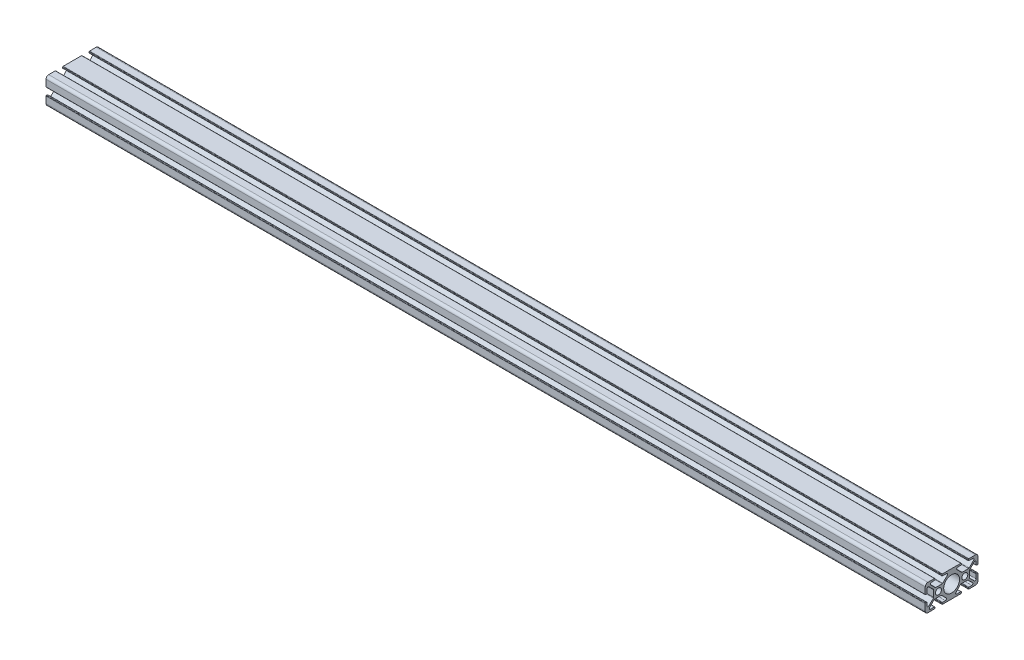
ISO-10303-21;
HEADER;
FILE_DESCRIPTION(('STEP AP214'),'2;1');
FILE_NAME('part.step','',(''),(''),'','','');
FILE_SCHEMA(('AUTOMOTIVE_DESIGN { 1 0 10303 214 1 1 1 1 }'));
ENDSEC;
DATA;
#1=APPLICATION_CONTEXT('core data for automotive mechanical design processes');
#2=APPLICATION_PROTOCOL_DEFINITION('international standard','automotive_design',2000,#1);
#3=PRODUCT_CONTEXT('',#1,'mechanical');
#4=PRODUCT('Part','Part','',(#3));
#5=PRODUCT_RELATED_PRODUCT_CATEGORY('part','',(#4));
#6=PRODUCT_DEFINITION_FORMATION('','',#4);
#7=PRODUCT_DEFINITION_CONTEXT('part definition',#1,'design');
#8=PRODUCT_DEFINITION('design','',#6,#7);
#9=PRODUCT_DEFINITION_SHAPE('','',#8);
#10=(LENGTH_UNIT() NAMED_UNIT(*) SI_UNIT(.MILLI.,.METRE.));
#11=(NAMED_UNIT(*) PLANE_ANGLE_UNIT() SI_UNIT($,.RADIAN.));
#12=(NAMED_UNIT(*) SI_UNIT($,.STERADIAN.) SOLID_ANGLE_UNIT());
#13=UNCERTAINTY_MEASURE_WITH_UNIT(LENGTH_MEASURE(1.E-05),#10,'distance_accuracy_value','');
#14=(GEOMETRIC_REPRESENTATION_CONTEXT(3) GLOBAL_UNCERTAINTY_ASSIGNED_CONTEXT((#13)) GLOBAL_UNIT_ASSIGNED_CONTEXT((#10,
#11,#12)) REPRESENTATION_CONTEXT('',''));
#15=CARTESIAN_POINT('',(0.,0.,0.));
#16=DIRECTION('',(0.,0.,1.));
#17=DIRECTION('',(1.,0.,0.));
#18=AXIS2_PLACEMENT_3D('',#15,#16,#17);
#19=CARTESIAN_POINT('',(1000.,-6.39999999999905,-10.7789296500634));
#20=DIRECTION('',(-1.,0.,0.));
#21=DIRECTION('',(0.,0.,1.));
#22=AXIS2_PLACEMENT_3D('',#19,#20,#21);
#23=CYLINDRICAL_SURFACE('',#22,0.999999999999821);
#24=CARTESIAN_POINT('',(0.,-6.39999999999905,-10.7789296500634));
#25=DIRECTION('',(-1.,0.,0.));
#26=DIRECTION('',(0.,0.,-1.));
#27=AXIS2_PLACEMENT_3D('',#24,#25,#26);
#28=CIRCLE('',#27,0.999999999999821);
#29=CARTESIAN_POINT('',(0.,-5.69289321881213,-10.0718228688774));
#30=VERTEX_POINT('',#29);
#31=CARTESIAN_POINT('',(0.,-5.39999999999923,-10.7789296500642));
#32=VERTEX_POINT('',#31);
#33=EDGE_CURVE('E1036',#30,#32,#28,.T.);
#34=ORIENTED_EDGE('',*,*,#33,.T.);
#35=DIRECTION('',(-1.,0.,0.));
#36=VECTOR('',#35,1.);
#37=CARTESIAN_POINT('',(1000.,-5.39999999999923,-10.7789296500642));
#38=LINE('',#37,#36);
#39=CARTESIAN_POINT('',(1000.,-5.39999999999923,-10.7789296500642));
#40=VERTEX_POINT('',#39);
#41=EDGE_CURVE('E13',#40,#32,#38,.T.);
#42=ORIENTED_EDGE('',*,*,#41,.F.);
#43=CARTESIAN_POINT('',(1000.,-6.39999999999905,-10.7789296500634));
#44=DIRECTION('',(-1.,0.,0.));
#45=DIRECTION('',(0.,0.,-1.));
#46=AXIS2_PLACEMENT_3D('',#43,#44,#45);
#47=CIRCLE('',#46,0.999999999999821);
#48=CARTESIAN_POINT('',(1000.,-5.69289321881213,-10.0718228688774));
#49=VERTEX_POINT('',#48);
#50=EDGE_CURVE('E1769',#49,#40,#47,.T.);
#51=ORIENTED_EDGE('',*,*,#50,.F.);
#52=DIRECTION('',(-1.,0.,0.));
#53=VECTOR('',#52,1.);
#54=CARTESIAN_POINT('',(1000.,-5.69289321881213,-10.0718228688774));
#55=LINE('',#54,#53);
#56=EDGE_CURVE('E1023',#49,#30,#55,.T.);
#57=ORIENTED_EDGE('',*,*,#56,.T.);
#58=EDGE_LOOP('',(#34,#42,#51,#57));
#59=FACE_BOUND('',#58,.T.);
#60=ADVANCED_FACE('F354',(#59),#23,.F.);
#61=CARTESIAN_POINT('',(1000.,-5.39999999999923,-10.7789296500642));
#62=DIRECTION('',(0.,1.,0.));
#63=DIRECTION('',(0.,0.,1.));
#64=AXIS2_PLACEMENT_3D('',#61,#62,#63);
#65=PLANE('',#64);
#66=DIRECTION('',(0.,0.,-1.));
#67=VECTOR('',#66,1.);
#68=CARTESIAN_POINT('',(0.,-5.39999999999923,-10.7789296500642));
#69=LINE('',#68,#67);
#70=CARTESIAN_POINT('',(0.,-5.39999999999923,-18.0210703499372));
#71=VERTEX_POINT('',#70);
#72=EDGE_CURVE('E1039',#32,#71,#69,.T.);
#73=ORIENTED_EDGE('',*,*,#72,.T.);
#74=DIRECTION('',(-1.,0.,0.));
#75=VECTOR('',#74,1.);
#76=CARTESIAN_POINT('',(1000.,-5.39999999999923,-18.0210703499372));
#77=LINE('',#76,#75);
#78=CARTESIAN_POINT('',(1000.,-5.39999999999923,-18.0210703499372));
#79=VERTEX_POINT('',#78);
#80=EDGE_CURVE('E363',#79,#71,#77,.T.);
#81=ORIENTED_EDGE('',*,*,#80,.F.);
#82=DIRECTION('',(0.,0.,-1.));
#83=VECTOR('',#82,1.);
#84=CARTESIAN_POINT('',(1000.,-5.39999999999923,-10.7789296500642));
#85=LINE('',#84,#83);
#86=EDGE_CURVE('E702',#40,#79,#85,.T.);
#87=ORIENTED_EDGE('',*,*,#86,.F.);
#88=ORIENTED_EDGE('',*,*,#41,.T.);
#89=EDGE_LOOP('',(#73,#81,#87,#88));
#90=FACE_BOUND('',#89,.T.);
#91=ADVANCED_FACE('F1784',(#90),#65,.F.);
#92=CARTESIAN_POINT('',(1000.,-6.39999999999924,-18.0210703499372));
#93=DIRECTION('',(-1.,0.,0.));
#94=DIRECTION('',(0.,0.,1.));
#95=AXIS2_PLACEMENT_3D('',#92,#93,#94);
#96=CYLINDRICAL_SURFACE('',#95,1.00000000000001);
#97=CARTESIAN_POINT('',(0.,-6.39999999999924,-18.0210703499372));
#98=DIRECTION('',(-1.,0.,0.));
#99=DIRECTION('',(0.,0.,-1.));
#100=AXIS2_PLACEMENT_3D('',#97,#98,#99);
#101=CIRCLE('',#100,1.00000000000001);
#102=CARTESIAN_POINT('',(0.,-5.69289321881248,-18.7281771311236));
#103=VERTEX_POINT('',#102);
#104=EDGE_CURVE('E1041',#71,#103,#101,.T.);
#105=ORIENTED_EDGE('',*,*,#104,.T.);
#106=DIRECTION('',(-1.,0.,0.));
#107=VECTOR('',#106,1.);
#108=CARTESIAN_POINT('',(1000.,-5.69289321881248,-18.7281771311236));
#109=LINE('',#108,#107);
#110=CARTESIAN_POINT('',(1000.,-5.69289321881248,-18.7281771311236));
#111=VERTEX_POINT('',#110);
#112=EDGE_CURVE('E1537',#111,#103,#109,.T.);
#113=ORIENTED_EDGE('',*,*,#112,.F.);
#114=CARTESIAN_POINT('',(1000.,-6.39999999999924,-18.0210703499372));
#115=DIRECTION('',(-1.,0.,0.));
#116=DIRECTION('',(0.,0.,-1.));
#117=AXIS2_PLACEMENT_3D('',#114,#115,#116);
#118=CIRCLE('',#117,1.00000000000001);
#119=EDGE_CURVE('E1545',#79,#111,#118,.T.);
#120=ORIENTED_EDGE('',*,*,#119,.F.);
#121=ORIENTED_EDGE('',*,*,#80,.T.);
#122=EDGE_LOOP('',(#105,#113,#120,#121));
#123=FACE_BOUND('',#122,.T.);
#124=ADVANCED_FACE('F1543',(#123),#96,.F.);
#125=CARTESIAN_POINT('',(1000.,-5.69289321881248,-18.7281771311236));
#126=DIRECTION('',(0.,0.707106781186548,-0.707106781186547));
#127=DIRECTION('',(0.,0.707106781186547,0.707106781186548));
#128=AXIS2_PLACEMENT_3D('',#125,#126,#127);
#129=PLANE('',#128);
#130=DIRECTION('',(0.,-0.707106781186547,-0.707106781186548));
#131=VECTOR('',#130,1.);
#132=CARTESIAN_POINT('',(0.,-5.69289321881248,-18.7281771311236));
#133=LINE('',#132,#131);
#134=CARTESIAN_POINT('',(0.,-10.7846163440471,-23.8199002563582));
#135=VERTEX_POINT('',#134);
#136=EDGE_CURVE('E1043',#103,#135,#133,.T.);
#137=ORIENTED_EDGE('',*,*,#136,.T.);
#138=DIRECTION('',(-1.,0.,0.));
#139=VECTOR('',#138,1.);
#140=CARTESIAN_POINT('',(1000.,-10.7846163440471,-23.8199002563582));
#141=LINE('',#140,#139);
#142=CARTESIAN_POINT('',(1000.,-10.7846163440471,-23.8199002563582));
#143=VERTEX_POINT('',#142);
#144=EDGE_CURVE('E1534',#143,#135,#141,.T.);
#145=ORIENTED_EDGE('',*,*,#144,.F.);
#146=DIRECTION('',(0.,-0.707106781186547,-0.707106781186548));
#147=VECTOR('',#146,1.);
#148=CARTESIAN_POINT('',(1000.,-5.69289321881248,-18.7281771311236));
#149=LINE('',#148,#147);
#150=EDGE_CURVE('E1563',#111,#143,#149,.T.);
#151=ORIENTED_EDGE('',*,*,#150,.F.);
#152=ORIENTED_EDGE('',*,*,#112,.T.);
#153=EDGE_LOOP('',(#137,#145,#151,#152));
#154=FACE_BOUND('',#153,.T.);
#155=ADVANCED_FACE('F1554',(#154),#129,.F.);
#156=CARTESIAN_POINT('',(1000.,-11.7022583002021,-22.9022583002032));
#157=DIRECTION('',(-1.,0.,0.));
#158=DIRECTION('',(0.,0.,1.));
#159=AXIS2_PLACEMENT_3D('',#156,#157,#158);
#160=CYLINDRICAL_SURFACE('',#159,1.29774169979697);
#161=CARTESIAN_POINT('',(0.,-11.7022583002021,-22.9022583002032));
#162=DIRECTION('',(-1.,0.,0.));
#163=DIRECTION('',(0.,0.,-1.));
#164=AXIS2_PLACEMENT_3D('',#161,#162,#163);
#165=CIRCLE('',#164,1.29774169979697);
#166=CARTESIAN_POINT('',(0.,-12.999999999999,-22.9022583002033));
#167=VERTEX_POINT('',#166);
#168=EDGE_CURVE('E1045',#135,#167,#165,.T.);
#169=ORIENTED_EDGE('',*,*,#168,.T.);
#170=DIRECTION('',(-1.,0.,0.));
#171=VECTOR('',#170,1.);
#172=CARTESIAN_POINT('',(1000.,-12.999999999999,-22.9022583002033));
#173=LINE('',#172,#171);
#174=CARTESIAN_POINT('',(1000.,-12.999999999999,-22.9022583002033));
#175=VERTEX_POINT('',#174);
#176=EDGE_CURVE('E1531',#175,#167,#173,.T.);
#177=ORIENTED_EDGE('',*,*,#176,.F.);
#178=CARTESIAN_POINT('',(1000.,-11.7022583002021,-22.9022583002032));
#179=DIRECTION('',(-1.,0.,0.));
#180=DIRECTION('',(0.,0.,-1.));
#181=AXIS2_PLACEMENT_3D('',#178,#179,#180);
#182=CIRCLE('',#181,1.29774169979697);
#183=EDGE_CURVE('E1560',#143,#175,#182,.T.);
#184=ORIENTED_EDGE('',*,*,#183,.F.);
#185=ORIENTED_EDGE('',*,*,#144,.T.);
#186=EDGE_LOOP('',(#169,#177,#184,#185));
#187=FACE_BOUND('',#186,.T.);
#188=ADVANCED_FACE('F1558',(#187),#160,.F.);
#189=CARTESIAN_POINT('',(1000.,-12.999999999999,-22.9022583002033));
#190=DIRECTION('',(0.,-1.,0.));
#191=DIRECTION('',(0.,0.,-1.));
#192=AXIS2_PLACEMENT_3D('',#189,#190,#191);
#193=PLANE('',#192);
#194=DIRECTION('',(0.,0.,1.));
#195=VECTOR('',#194,1.);
#196=CARTESIAN_POINT('',(0.,-12.999999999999,-22.9022583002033));
#197=LINE('',#196,#195);
#198=CARTESIAN_POINT('',(0.,-12.999999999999,-19.5000000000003));
#199=VERTEX_POINT('',#198);
#200=EDGE_CURVE('E1047',#167,#199,#197,.T.);
#201=ORIENTED_EDGE('',*,*,#200,.T.);
#202=DIRECTION('',(-1.,0.,0.));
#203=VECTOR('',#202,1.);
#204=CARTESIAN_POINT('',(1000.,-12.999999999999,-19.5000000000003));
#205=LINE('',#204,#203);
#206=CARTESIAN_POINT('',(1000.,-12.999999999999,-19.5000000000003));
#207=VERTEX_POINT('',#206);
#208=EDGE_CURVE('E1528',#207,#199,#205,.T.);
#209=ORIENTED_EDGE('',*,*,#208,.F.);
#210=DIRECTION('',(0.,0.,1.));
#211=VECTOR('',#210,1.);
#212=CARTESIAN_POINT('',(1000.,-12.999999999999,-22.9022583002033));
#213=LINE('',#212,#211);
#214=EDGE_CURVE('E1562',#175,#207,#213,.T.);
#215=ORIENTED_EDGE('',*,*,#214,.F.);
#216=ORIENTED_EDGE('',*,*,#176,.T.);
#217=EDGE_LOOP('',(#201,#209,#215,#216));
#218=FACE_BOUND('',#217,.T.);
#219=ADVANCED_FACE('F2900',(#218),#193,.F.);
#220=CARTESIAN_POINT('',(1000.,-13.499999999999,-19.5000000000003));
#221=DIRECTION('',(-1.,0.,0.));
#222=DIRECTION('',(0.,0.,1.));
#223=AXIS2_PLACEMENT_3D('',#220,#221,#222);
#224=CYLINDRICAL_SURFACE('',#223,0.5);
#225=CARTESIAN_POINT('',(0.,-13.499999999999,-19.5000000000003));
#226=DIRECTION('',(1.,0.,0.));
#227=DIRECTION('',(0.,0.,-1.));
#228=AXIS2_PLACEMENT_3D('',#225,#226,#227);
#229=CIRCLE('',#228,0.5);
#230=CARTESIAN_POINT('',(0.,-13.4999999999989,-19.0000000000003));
#231=VERTEX_POINT('',#230);
#232=EDGE_CURVE('E1049',#199,#231,#229,.T.);
#233=ORIENTED_EDGE('',*,*,#232,.T.);
#234=DIRECTION('',(-1.,0.,0.));
#235=VECTOR('',#234,1.);
#236=CARTESIAN_POINT('',(1000.,-13.4999999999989,-19.0000000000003));
#237=LINE('',#236,#235);
#238=CARTESIAN_POINT('',(1000.,-13.4999999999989,-19.0000000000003));
#239=VERTEX_POINT('',#238);
#240=EDGE_CURVE('E1525',#239,#231,#237,.T.);
#241=ORIENTED_EDGE('',*,*,#240,.F.);
#242=CARTESIAN_POINT('',(1000.,-13.499999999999,-19.5000000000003));
#243=DIRECTION('',(1.,0.,0.));
#244=DIRECTION('',(0.,0.,-1.));
#245=AXIS2_PLACEMENT_3D('',#242,#243,#244);
#246=CIRCLE('',#245,0.5);
#247=EDGE_CURVE('E1565',#207,#239,#246,.T.);
#248=ORIENTED_EDGE('',*,*,#247,.F.);
#249=ORIENTED_EDGE('',*,*,#208,.T.);
#250=EDGE_LOOP('',(#233,#241,#248,#249));
#251=FACE_BOUND('',#250,.T.);
#252=ADVANCED_FACE('F2889',(#251),#224,.T.);
#253=CARTESIAN_POINT('',(1000.,-13.4999999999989,-19.0000000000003));
#254=DIRECTION('',(0.,0.,-1.));
#255=DIRECTION('',(-1.,0.,0.));
#256=AXIS2_PLACEMENT_3D('',#253,#254,#255);
#257=PLANE('',#256);
#258=DIRECTION('',(0.,-1.,0.));
#259=VECTOR('',#258,1.);
#260=CARTESIAN_POINT('',(0.,-13.4999999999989,-19.0000000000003));
#261=LINE('',#260,#259);
#262=CARTESIAN_POINT('',(0.,-14.4999999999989,-19.0000000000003));
#263=VERTEX_POINT('',#262);
#264=EDGE_CURVE('E1051',#231,#263,#261,.T.);
#265=ORIENTED_EDGE('',*,*,#264,.T.);
#266=DIRECTION('',(-1.,0.,0.));
#267=VECTOR('',#266,1.);
#268=CARTESIAN_POINT('',(1000.,-14.4999999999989,-19.0000000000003));
#269=LINE('',#268,#267);
#270=CARTESIAN_POINT('',(1000.,-14.4999999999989,-19.0000000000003));
#271=VERTEX_POINT('',#270);
#272=EDGE_CURVE('E1522',#271,#263,#269,.T.);
#273=ORIENTED_EDGE('',*,*,#272,.F.);
#274=DIRECTION('',(0.,-1.,0.));
#275=VECTOR('',#274,1.);
#276=CARTESIAN_POINT('',(1000.,-13.4999999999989,-19.0000000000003));
#277=LINE('',#276,#275);
#278=EDGE_CURVE('E1571',#239,#271,#277,.T.);
#279=ORIENTED_EDGE('',*,*,#278,.F.);
#280=ORIENTED_EDGE('',*,*,#240,.T.);
#281=EDGE_LOOP('',(#265,#273,#279,#280));
#282=FACE_BOUND('',#281,.T.);
#283=ADVANCED_FACE('F2878',(#282),#257,.F.);
#284=CARTESIAN_POINT('',(1000.,-14.4999999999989,-19.5000000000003));
#285=DIRECTION('',(-1.,0.,0.));
#286=DIRECTION('',(0.,0.,1.));
#287=AXIS2_PLACEMENT_3D('',#284,#285,#286);
#288=CYLINDRICAL_SURFACE('',#287,0.5);
#289=CARTESIAN_POINT('',(0.,-14.4999999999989,-19.5000000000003));
#290=DIRECTION('',(1.,0.,0.));
#291=DIRECTION('',(0.,0.,-1.));
#292=AXIS2_PLACEMENT_3D('',#289,#290,#291);
#293=CIRCLE('',#292,0.5);
#294=CARTESIAN_POINT('',(0.,-14.9999999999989,-19.5000000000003));
#295=VERTEX_POINT('',#294);
#296=EDGE_CURVE('E1053',#263,#295,#293,.T.);
#297=ORIENTED_EDGE('',*,*,#296,.T.);
#298=DIRECTION('',(-1.,0.,0.));
#299=VECTOR('',#298,1.);
#300=CARTESIAN_POINT('',(1000.,-14.9999999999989,-19.5000000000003));
#301=LINE('',#300,#299);
#302=CARTESIAN_POINT('',(1000.,-14.9999999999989,-19.5000000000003));
#303=VERTEX_POINT('',#302);
#304=EDGE_CURVE('E1519',#303,#295,#301,.T.);
#305=ORIENTED_EDGE('',*,*,#304,.F.);
#306=CARTESIAN_POINT('',(1000.,-14.4999999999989,-19.5000000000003));
#307=DIRECTION('',(1.,0.,0.));
#308=DIRECTION('',(0.,0.,-1.));
#309=AXIS2_PLACEMENT_3D('',#306,#307,#308);
#310=CIRCLE('',#309,0.5);
#311=EDGE_CURVE('E1573',#271,#303,#310,.T.);
#312=ORIENTED_EDGE('',*,*,#311,.F.);
#313=ORIENTED_EDGE('',*,*,#272,.T.);
#314=EDGE_LOOP('',(#297,#305,#312,#313));
#315=FACE_BOUND('',#314,.T.);
#316=ADVANCED_FACE('F2867',(#315),#288,.T.);
#317=CARTESIAN_POINT('',(1000.,-14.9999999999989,-19.5000000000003));
#318=DIRECTION('',(0.,1.,0.));
#319=DIRECTION('',(0.,0.,1.));
#320=AXIS2_PLACEMENT_3D('',#317,#318,#319);
#321=PLANE('',#320);
#322=DIRECTION('',(0.,0.,-1.));
#323=VECTOR('',#322,1.);
#324=CARTESIAN_POINT('',(0.,-14.9999999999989,-19.5000000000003));
#325=LINE('',#324,#323);
#326=CARTESIAN_POINT('',(0.,-14.9999999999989,-27.0000000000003));
#327=VERTEX_POINT('',#326);
#328=EDGE_CURVE('E1055',#295,#327,#325,.T.);
#329=ORIENTED_EDGE('',*,*,#328,.T.);
#330=DIRECTION('',(-1.,0.,0.));
#331=VECTOR('',#330,1.);
#332=CARTESIAN_POINT('',(1000.,-14.9999999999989,-27.0000000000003));
#333=LINE('',#332,#331);
#334=CARTESIAN_POINT('',(1000.,-14.9999999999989,-27.0000000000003));
#335=VERTEX_POINT('',#334);
#336=EDGE_CURVE('E1516',#335,#327,#333,.T.);
#337=ORIENTED_EDGE('',*,*,#336,.F.);
#338=DIRECTION('',(0.,0.,-1.));
#339=VECTOR('',#338,1.);
#340=CARTESIAN_POINT('',(1000.,-14.9999999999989,-19.5000000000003));
#341=LINE('',#340,#339);
#342=EDGE_CURVE('E1575',#303,#335,#341,.T.);
#343=ORIENTED_EDGE('',*,*,#342,.F.);
#344=ORIENTED_EDGE('',*,*,#304,.T.);
#345=EDGE_LOOP('',(#329,#337,#343,#344));
#346=FACE_BOUND('',#345,.T.);
#347=ADVANCED_FACE('F2856',(#346),#321,.F.);
#348=CARTESIAN_POINT('',(1000.,-11.9999999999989,-27.0000000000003));
#349=DIRECTION('',(-1.,0.,0.));
#350=DIRECTION('',(0.,0.,1.));
#351=AXIS2_PLACEMENT_3D('',#348,#349,#350);
#352=CYLINDRICAL_SURFACE('',#351,3.);
#353=CARTESIAN_POINT('',(0.,-11.9999999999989,-27.0000000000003));
#354=DIRECTION('',(1.,0.,0.));
#355=DIRECTION('',(0.,0.,-1.));
#356=AXIS2_PLACEMENT_3D('',#353,#354,#355);
#357=CIRCLE('',#356,3.);
#358=CARTESIAN_POINT('',(0.,-11.9999999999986,-30.0000000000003));
#359=VERTEX_POINT('',#358);
#360=EDGE_CURVE('E1057',#327,#359,#357,.T.);
#361=ORIENTED_EDGE('',*,*,#360,.T.);
#362=DIRECTION('',(-1.,0.,0.));
#363=VECTOR('',#362,1.);
#364=CARTESIAN_POINT('',(1000.,-11.9999999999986,-30.0000000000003));
#365=LINE('',#364,#363);
#366=CARTESIAN_POINT('',(1000.,-11.9999999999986,-30.0000000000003));
#367=VERTEX_POINT('',#366);
#368=EDGE_CURVE('E1513',#367,#359,#365,.T.);
#369=ORIENTED_EDGE('',*,*,#368,.F.);
#370=CARTESIAN_POINT('',(1000.,-11.9999999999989,-27.0000000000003));
#371=DIRECTION('',(1.,0.,0.));
#372=DIRECTION('',(0.,0.,-1.));
#373=AXIS2_PLACEMENT_3D('',#370,#371,#372);
#374=CIRCLE('',#373,3.);
#375=EDGE_CURVE('E1577',#335,#367,#374,.T.);
#376=ORIENTED_EDGE('',*,*,#375,.F.);
#377=ORIENTED_EDGE('',*,*,#336,.T.);
#378=EDGE_LOOP('',(#361,#369,#376,#377));
#379=FACE_BOUND('',#378,.T.);
#380=ADVANCED_FACE('F2845',(#379),#352,.T.);
#381=CARTESIAN_POINT('',(1000.,-11.9999999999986,-30.0000000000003));
#382=DIRECTION('',(0.,0.,1.));
#383=DIRECTION('',(1.,0.,0.));
#384=AXIS2_PLACEMENT_3D('',#381,#382,#383);
#385=PLANE('',#384);
#386=DIRECTION('',(0.,1.,0.));
#387=VECTOR('',#386,1.);
#388=CARTESIAN_POINT('',(0.,-11.9999999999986,-30.0000000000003));
#389=LINE('',#388,#387);
#390=CARTESIAN_POINT('',(0.,-4.49999999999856,-30.0000000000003));
#391=VERTEX_POINT('',#390);
#392=EDGE_CURVE('E1059',#359,#391,#389,.T.);
#393=ORIENTED_EDGE('',*,*,#392,.T.);
#394=DIRECTION('',(-1.,0.,0.));
#395=VECTOR('',#394,1.);
#396=CARTESIAN_POINT('',(1000.,-4.49999999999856,-30.0000000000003));
#397=LINE('',#396,#395);
#398=CARTESIAN_POINT('',(1000.,-4.49999999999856,-30.0000000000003));
#399=VERTEX_POINT('',#398);
#400=EDGE_CURVE('E1510',#399,#391,#397,.T.);
#401=ORIENTED_EDGE('',*,*,#400,.F.);
#402=DIRECTION('',(0.,1.,0.));
#403=VECTOR('',#402,1.);
#404=CARTESIAN_POINT('',(1000.,-11.9999999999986,-30.0000000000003));
#405=LINE('',#404,#403);
#406=EDGE_CURVE('E1579',#367,#399,#405,.T.);
#407=ORIENTED_EDGE('',*,*,#406,.F.);
#408=ORIENTED_EDGE('',*,*,#368,.T.);
#409=EDGE_LOOP('',(#393,#401,#407,#408));
#410=FACE_BOUND('',#409,.T.);
#411=ADVANCED_FACE('F2834',(#410),#385,.F.);
#412=CARTESIAN_POINT('',(1000.,-4.49999999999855,-29.5000000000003));
#413=DIRECTION('',(-1.,0.,0.));
#414=DIRECTION('',(0.,0.,1.));
#415=AXIS2_PLACEMENT_3D('',#412,#413,#414);
#416=CYLINDRICAL_SURFACE('',#415,0.499999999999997);
#417=CARTESIAN_POINT('',(0.,-4.49999999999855,-29.5000000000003));
#418=DIRECTION('',(1.,0.,0.));
#419=DIRECTION('',(0.,0.,-1.));
#420=AXIS2_PLACEMENT_3D('',#417,#418,#419);
#421=CIRCLE('',#420,0.499999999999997);
#422=CARTESIAN_POINT('',(0.,-3.99999999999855,-29.5000000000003));
#423=VERTEX_POINT('',#422);
#424=EDGE_CURVE('E1061',#391,#423,#421,.T.);
#425=ORIENTED_EDGE('',*,*,#424,.T.);
#426=DIRECTION('',(-1.,0.,0.));
#427=VECTOR('',#426,1.);
#428=CARTESIAN_POINT('',(1000.,-3.99999999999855,-29.5000000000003));
#429=LINE('',#428,#427);
#430=CARTESIAN_POINT('',(1000.,-3.99999999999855,-29.5000000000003));
#431=VERTEX_POINT('',#430);
#432=EDGE_CURVE('E1507',#431,#423,#429,.T.);
#433=ORIENTED_EDGE('',*,*,#432,.F.);
#434=CARTESIAN_POINT('',(1000.,-4.49999999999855,-29.5000000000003));
#435=DIRECTION('',(1.,0.,0.));
#436=DIRECTION('',(0.,0.,-1.));
#437=AXIS2_PLACEMENT_3D('',#434,#435,#436);
#438=CIRCLE('',#437,0.499999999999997);
#439=EDGE_CURVE('E1581',#399,#431,#438,.T.);
#440=ORIENTED_EDGE('',*,*,#439,.F.);
#441=ORIENTED_EDGE('',*,*,#400,.T.);
#442=EDGE_LOOP('',(#425,#433,#440,#441));
#443=FACE_BOUND('',#442,.T.);
#444=ADVANCED_FACE('F2823',(#443),#416,.T.);
#445=CARTESIAN_POINT('',(1000.,-3.99999999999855,-29.5000000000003));
#446=DIRECTION('',(0.,-1.,0.));
#447=DIRECTION('',(0.,0.,-1.));
#448=AXIS2_PLACEMENT_3D('',#445,#446,#447);
#449=PLANE('',#448);
#450=DIRECTION('',(0.,0.,1.));
#451=VECTOR('',#450,1.);
#452=CARTESIAN_POINT('',(0.,-3.99999999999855,-29.5000000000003));
#453=LINE('',#452,#451);
#454=CARTESIAN_POINT('',(0.,-3.99999999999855,-28.5000000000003));
#455=VERTEX_POINT('',#454);
#456=EDGE_CURVE('E1063',#423,#455,#453,.T.);
#457=ORIENTED_EDGE('',*,*,#456,.T.);
#458=DIRECTION('',(-1.,0.,0.));
#459=VECTOR('',#458,1.);
#460=CARTESIAN_POINT('',(1000.,-3.99999999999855,-28.5000000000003));
#461=LINE('',#460,#459);
#462=CARTESIAN_POINT('',(1000.,-3.99999999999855,-28.5000000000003));
#463=VERTEX_POINT('',#462);
#464=EDGE_CURVE('E1504',#463,#455,#461,.T.);
#465=ORIENTED_EDGE('',*,*,#464,.F.);
#466=DIRECTION('',(0.,0.,1.));
#467=VECTOR('',#466,1.);
#468=CARTESIAN_POINT('',(1000.,-3.99999999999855,-29.5000000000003));
#469=LINE('',#468,#467);
#470=EDGE_CURVE('E1583',#431,#463,#469,.T.);
#471=ORIENTED_EDGE('',*,*,#470,.F.);
#472=ORIENTED_EDGE('',*,*,#432,.T.);
#473=EDGE_LOOP('',(#457,#465,#471,#472));
#474=FACE_BOUND('',#473,.T.);
#475=ADVANCED_FACE('F2812',(#474),#449,.F.);
#476=CARTESIAN_POINT('',(1000.,-4.49999999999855,-28.5000000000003));
#477=DIRECTION('',(-1.,0.,0.));
#478=DIRECTION('',(0.,0.,1.));
#479=AXIS2_PLACEMENT_3D('',#476,#477,#478);
#480=CYLINDRICAL_SURFACE('',#479,0.5);
#481=CARTESIAN_POINT('',(0.,-4.49999999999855,-28.5000000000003));
#482=DIRECTION('',(1.,0.,0.));
#483=DIRECTION('',(0.,0.,-1.));
#484=AXIS2_PLACEMENT_3D('',#481,#482,#483);
#485=CIRCLE('',#484,0.5);
#486=CARTESIAN_POINT('',(0.,-4.49999999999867,-28.0000000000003));
#487=VERTEX_POINT('',#486);
#488=EDGE_CURVE('E1065',#455,#487,#485,.T.);
#489=ORIENTED_EDGE('',*,*,#488,.T.);
#490=DIRECTION('',(-1.,0.,0.));
#491=VECTOR('',#490,1.);
#492=CARTESIAN_POINT('',(1000.,-4.49999999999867,-28.0000000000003));
#493=LINE('',#492,#491);
#494=CARTESIAN_POINT('',(1000.,-4.49999999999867,-28.0000000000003));
#495=VERTEX_POINT('',#494);
#496=EDGE_CURVE('E1501',#495,#487,#493,.T.);
#497=ORIENTED_EDGE('',*,*,#496,.F.);
#498=CARTESIAN_POINT('',(1000.,-4.49999999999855,-28.5000000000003));
#499=DIRECTION('',(1.,0.,0.));
#500=DIRECTION('',(0.,0.,-1.));
#501=AXIS2_PLACEMENT_3D('',#498,#499,#500);
#502=CIRCLE('',#501,0.5);
#503=EDGE_CURVE('E1585',#463,#495,#502,.T.);
#504=ORIENTED_EDGE('',*,*,#503,.F.);
#505=ORIENTED_EDGE('',*,*,#464,.T.);
#506=EDGE_LOOP('',(#489,#497,#504,#505));
#507=FACE_BOUND('',#506,.T.);
#508=ADVANCED_FACE('F2801',(#507),#480,.T.);
#509=CARTESIAN_POINT('',(1000.,-4.49999999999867,-28.0000000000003));
#510=DIRECTION('',(0.,0.,-1.));
#511=DIRECTION('',(-1.,0.,0.));
#512=AXIS2_PLACEMENT_3D('',#509,#510,#511);
#513=PLANE('',#512);
#514=DIRECTION('',(0.,-1.,0.));
#515=VECTOR('',#514,1.);
#516=CARTESIAN_POINT('',(0.,-4.49999999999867,-28.0000000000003));
#517=LINE('',#516,#515);
#518=CARTESIAN_POINT('',(0.,-9.10225830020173,-28.0000000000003));
#519=VERTEX_POINT('',#518);
#520=EDGE_CURVE('E1067',#487,#519,#517,.T.);
#521=ORIENTED_EDGE('',*,*,#520,.T.);
#522=DIRECTION('',(-1.,0.,0.));
#523=VECTOR('',#522,1.);
#524=CARTESIAN_POINT('',(1000.,-9.10225830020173,-28.0000000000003));
#525=LINE('',#524,#523);
#526=CARTESIAN_POINT('',(1000.,-9.10225830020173,-28.0000000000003));
#527=VERTEX_POINT('',#526);
#528=EDGE_CURVE('E1498',#527,#519,#525,.T.);
#529=ORIENTED_EDGE('',*,*,#528,.F.);
#530=DIRECTION('',(0.,-1.,0.));
#531=VECTOR('',#530,1.);
#532=CARTESIAN_POINT('',(1000.,-4.49999999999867,-28.0000000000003));
#533=LINE('',#532,#531);
#534=EDGE_CURVE('E1587',#495,#527,#533,.T.);
#535=ORIENTED_EDGE('',*,*,#534,.F.);
#536=ORIENTED_EDGE('',*,*,#496,.T.);
#537=EDGE_LOOP('',(#521,#529,#535,#536));
#538=FACE_BOUND('',#537,.T.);
#539=ADVANCED_FACE('F2790',(#538),#513,.F.);
#540=CARTESIAN_POINT('',(1000.,-9.10225830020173,-26.7022583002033));
#541=DIRECTION('',(-1.,0.,0.));
#542=DIRECTION('',(0.,0.,1.));
#543=AXIS2_PLACEMENT_3D('',#540,#541,#542);
#544=CYLINDRICAL_SURFACE('',#543,1.29774169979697);
#545=CARTESIAN_POINT('',(0.,-9.10225830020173,-26.7022583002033));
#546=DIRECTION('',(-1.,0.,0.));
#547=DIRECTION('',(0.,0.,-1.));
#548=AXIS2_PLACEMENT_3D('',#545,#546,#547);
#549=CIRCLE('',#548,1.29774169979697);
#550=CARTESIAN_POINT('',(0.,-10.0199002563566,-25.7846163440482));
#551=VERTEX_POINT('',#550);
#552=EDGE_CURVE('E1069',#519,#551,#549,.T.);
#553=ORIENTED_EDGE('',*,*,#552,.T.);
#554=DIRECTION('',(-1.,0.,0.));
#555=VECTOR('',#554,1.);
#556=CARTESIAN_POINT('',(1000.,-10.0199002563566,-25.7846163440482));
#557=LINE('',#556,#555);
#558=CARTESIAN_POINT('',(1000.,-10.0199002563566,-25.7846163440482));
#559=VERTEX_POINT('',#558);
#560=EDGE_CURVE('E1495',#559,#551,#557,.T.);
#561=ORIENTED_EDGE('',*,*,#560,.F.);
#562=CARTESIAN_POINT('',(1000.,-9.10225830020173,-26.7022583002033));
#563=DIRECTION('',(-1.,0.,0.));
#564=DIRECTION('',(0.,0.,-1.));
#565=AXIS2_PLACEMENT_3D('',#562,#563,#564);
#566=CIRCLE('',#565,1.29774169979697);
#567=EDGE_CURVE('E1589',#527,#559,#566,.T.);
#568=ORIENTED_EDGE('',*,*,#567,.F.);
#569=ORIENTED_EDGE('',*,*,#528,.T.);
#570=EDGE_LOOP('',(#553,#561,#568,#569));
#571=FACE_BOUND('',#570,.T.);
#572=ADVANCED_FACE('F2779',(#571),#544,.F.);
#573=CARTESIAN_POINT('',(1000.,-10.0199002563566,-25.7846163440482));
#574=DIRECTION('',(0.,-0.707106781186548,0.707106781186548));
#575=DIRECTION('',(0.,-0.707106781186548,-0.707106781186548));
#576=AXIS2_PLACEMENT_3D('',#573,#574,#575);
#577=PLANE('',#576);
#578=DIRECTION('',(0.,0.707106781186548,0.707106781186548));
#579=VECTOR('',#578,1.);
#580=CARTESIAN_POINT('',(0.,-10.0199002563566,-25.7846163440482));
#581=LINE('',#580,#579);
#582=CARTESIAN_POINT('',(0.,-4.92817713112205,-20.6928932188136));
#583=VERTEX_POINT('',#582);
#584=EDGE_CURVE('E1071',#551,#583,#581,.T.);
#585=ORIENTED_EDGE('',*,*,#584,.T.);
#586=DIRECTION('',(-1.,0.,0.));
#587=VECTOR('',#586,1.);
#588=CARTESIAN_POINT('',(1000.,-4.92817713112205,-20.6928932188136));
#589=LINE('',#588,#587);
#590=CARTESIAN_POINT('',(1000.,-4.92817713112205,-20.6928932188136));
#591=VERTEX_POINT('',#590);
#592=EDGE_CURVE('E1492',#591,#583,#589,.T.);
#593=ORIENTED_EDGE('',*,*,#592,.F.);
#594=DIRECTION('',(0.,0.707106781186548,0.707106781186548));
#595=VECTOR('',#594,1.);
#596=CARTESIAN_POINT('',(1000.,-10.0199002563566,-25.7846163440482));
#597=LINE('',#596,#595);
#598=EDGE_CURVE('E1591',#559,#591,#597,.T.);
#599=ORIENTED_EDGE('',*,*,#598,.F.);
#600=ORIENTED_EDGE('',*,*,#560,.T.);
#601=EDGE_LOOP('',(#585,#593,#599,#600));
#602=FACE_BOUND('',#601,.T.);
#603=ADVANCED_FACE('F2768',(#602),#577,.F.);
#604=CARTESIAN_POINT('',(1000.,-4.22107034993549,-21.4000000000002));
#605=DIRECTION('',(-1.,0.,0.));
#606=DIRECTION('',(0.,0.,1.));
#607=AXIS2_PLACEMENT_3D('',#604,#605,#606);
#608=CYLINDRICAL_SURFACE('',#607,1.00000000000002);
#609=CARTESIAN_POINT('',(0.,-4.22107034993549,-21.4000000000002));
#610=DIRECTION('',(-1.,0.,0.));
#611=DIRECTION('',(0.,0.,-1.));
#612=AXIS2_PLACEMENT_3D('',#609,#610,#611);
#613=CIRCLE('',#612,1.00000000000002);
#614=CARTESIAN_POINT('',(0.,-4.22107034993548,-20.4000000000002));
#615=VERTEX_POINT('',#614);
#616=EDGE_CURVE('E1073',#583,#615,#613,.T.);
#617=ORIENTED_EDGE('',*,*,#616,.T.);
#618=DIRECTION('',(-1.,0.,0.));
#619=VECTOR('',#618,1.);
#620=CARTESIAN_POINT('',(1000.,-4.22107034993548,-20.4000000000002));
#621=LINE('',#620,#619);
#622=CARTESIAN_POINT('',(1000.,-4.22107034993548,-20.4000000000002));
#623=VERTEX_POINT('',#622);
#624=EDGE_CURVE('E1489',#623,#615,#621,.T.);
#625=ORIENTED_EDGE('',*,*,#624,.F.);
#626=CARTESIAN_POINT('',(1000.,-4.22107034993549,-21.4000000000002));
#627=DIRECTION('',(-1.,0.,0.));
#628=DIRECTION('',(0.,0.,-1.));
#629=AXIS2_PLACEMENT_3D('',#626,#627,#628);
#630=CIRCLE('',#629,1.00000000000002);
#631=EDGE_CURVE('E1593',#591,#623,#630,.T.);
#632=ORIENTED_EDGE('',*,*,#631,.F.);
#633=ORIENTED_EDGE('',*,*,#592,.T.);
#634=EDGE_LOOP('',(#617,#625,#632,#633));
#635=FACE_BOUND('',#634,.T.);
#636=ADVANCED_FACE('F2757',(#635),#608,.F.);
#637=CARTESIAN_POINT('',(1000.,-4.22107034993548,-20.4000000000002));
#638=DIRECTION('',(0.,0.,1.));
#639=DIRECTION('',(1.,0.,0.));
#640=AXIS2_PLACEMENT_3D('',#637,#638,#639);
#641=PLANE('',#640);
#642=DIRECTION('',(0.,1.,0.));
#643=VECTOR('',#642,1.);
#644=CARTESIAN_POINT('',(0.,-4.22107034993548,-20.4000000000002));
#645=LINE('',#644,#643);
#646=CARTESIAN_POINT('',(0.,3.02107034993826,-20.4000000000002));
#647=VERTEX_POINT('',#646);
#648=EDGE_CURVE('E1075',#615,#647,#645,.T.);
#649=ORIENTED_EDGE('',*,*,#648,.T.);
#650=DIRECTION('',(-1.,0.,0.));
#651=VECTOR('',#650,1.);
#652=CARTESIAN_POINT('',(1000.,3.02107034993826,-20.4000000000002));
#653=LINE('',#652,#651);
#654=CARTESIAN_POINT('',(1000.,3.02107034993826,-20.4000000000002));
#655=VERTEX_POINT('',#654);
#656=EDGE_CURVE('E1486',#655,#647,#653,.T.);
#657=ORIENTED_EDGE('',*,*,#656,.F.);
#658=DIRECTION('',(0.,1.,0.));
#659=VECTOR('',#658,1.);
#660=CARTESIAN_POINT('',(1000.,-4.22107034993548,-20.4000000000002));
#661=LINE('',#660,#659);
#662=EDGE_CURVE('E1595',#623,#655,#661,.T.);
#663=ORIENTED_EDGE('',*,*,#662,.F.);
#664=ORIENTED_EDGE('',*,*,#624,.T.);
#665=EDGE_LOOP('',(#649,#657,#663,#664));
#666=FACE_BOUND('',#665,.T.);
#667=ADVANCED_FACE('F2746',(#666),#641,.F.);
#668=CARTESIAN_POINT('',(1000.,3.02107034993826,-21.4000000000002));
#669=DIRECTION('',(-1.,0.,0.));
#670=DIRECTION('',(0.,0.,1.));
#671=AXIS2_PLACEMENT_3D('',#668,#669,#670);
#672=CYLINDRICAL_SURFACE('',#671,0.999999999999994);
#673=CARTESIAN_POINT('',(0.,3.02107034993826,-21.4000000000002));
#674=DIRECTION('',(-1.,0.,0.));
#675=DIRECTION('',(0.,0.,-1.));
#676=AXIS2_PLACEMENT_3D('',#673,#674,#675);
#677=CIRCLE('',#676,0.999999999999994);
#678=CARTESIAN_POINT('',(0.,3.72817713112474,-20.6928932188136));
#679=VERTEX_POINT('',#678);
#680=EDGE_CURVE('E1077',#647,#679,#677,.T.);
#681=ORIENTED_EDGE('',*,*,#680,.T.);
#682=DIRECTION('',(-1.,0.,0.));
#683=VECTOR('',#682,1.);
#684=CARTESIAN_POINT('',(1000.,3.72817713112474,-20.6928932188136));
#685=LINE('',#684,#683);
#686=CARTESIAN_POINT('',(1000.,3.72817713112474,-20.6928932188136));
#687=VERTEX_POINT('',#686);
#688=EDGE_CURVE('E1483',#687,#679,#685,.T.);
#689=ORIENTED_EDGE('',*,*,#688,.F.);
#690=CARTESIAN_POINT('',(1000.,3.02107034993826,-21.4000000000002));
#691=DIRECTION('',(-1.,0.,0.));
#692=DIRECTION('',(0.,0.,-1.));
#693=AXIS2_PLACEMENT_3D('',#690,#691,#692);
#694=CIRCLE('',#693,0.999999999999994);
#695=EDGE_CURVE('E1597',#655,#687,#694,.T.);
#696=ORIENTED_EDGE('',*,*,#695,.F.);
#697=ORIENTED_EDGE('',*,*,#656,.T.);
#698=EDGE_LOOP('',(#681,#689,#696,#697));
#699=FACE_BOUND('',#698,.T.);
#700=ADVANCED_FACE('F2735',(#699),#672,.F.);
#701=CARTESIAN_POINT('',(1000.,3.72817713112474,-20.6928932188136));
#702=DIRECTION('',(0.,0.707106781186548,0.707106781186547));
#703=DIRECTION('',(0.,-0.707106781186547,0.707106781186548));
#704=AXIS2_PLACEMENT_3D('',#701,#702,#703);
#705=PLANE('',#704);
#706=DIRECTION('',(0.,0.707106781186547,-0.707106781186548));
#707=VECTOR('',#706,1.);
#708=CARTESIAN_POINT('',(0.,3.72817713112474,-20.6928932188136));
#709=LINE('',#708,#707);
#710=CARTESIAN_POINT('',(0.,8.81990025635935,-25.7846163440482));
#711=VERTEX_POINT('',#710);
#712=EDGE_CURVE('E1079',#679,#711,#709,.T.);
#713=ORIENTED_EDGE('',*,*,#712,.T.);
#714=DIRECTION('',(-1.,0.,0.));
#715=VECTOR('',#714,1.);
#716=CARTESIAN_POINT('',(1000.,8.81990025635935,-25.7846163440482));
#717=LINE('',#716,#715);
#718=CARTESIAN_POINT('',(1000.,8.81990025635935,-25.7846163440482));
#719=VERTEX_POINT('',#718);
#720=EDGE_CURVE('E1480',#719,#711,#717,.T.);
#721=ORIENTED_EDGE('',*,*,#720,.F.);
#722=DIRECTION('',(0.,0.707106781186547,-0.707106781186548));
#723=VECTOR('',#722,1.);
#724=CARTESIAN_POINT('',(1000.,3.72817713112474,-20.6928932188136));
#725=LINE('',#724,#723);
#726=EDGE_CURVE('E1599',#687,#719,#725,.T.);
#727=ORIENTED_EDGE('',*,*,#726,.F.);
#728=ORIENTED_EDGE('',*,*,#688,.T.);
#729=EDGE_LOOP('',(#713,#721,#727,#728));
#730=FACE_BOUND('',#729,.T.);
#731=ADVANCED_FACE('F2724',(#730),#705,.F.);
#732=CARTESIAN_POINT('',(1000.,7.90225830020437,-26.7022583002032));
#733=DIRECTION('',(-1.,0.,0.));
#734=DIRECTION('',(0.,0.,1.));
#735=AXIS2_PLACEMENT_3D('',#732,#733,#734);
#736=CYLINDRICAL_SURFACE('',#735,1.29774169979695);
#737=CARTESIAN_POINT('',(0.,7.90225830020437,-26.7022583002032));
#738=DIRECTION('',(-1.,0.,0.));
#739=DIRECTION('',(0.,0.,-1.));
#740=AXIS2_PLACEMENT_3D('',#737,#738,#739);
#741=CIRCLE('',#740,1.29774169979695);
#742=CARTESIAN_POINT('',(0.,7.90225830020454,-28.0000000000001));
#743=VERTEX_POINT('',#742);
#744=EDGE_CURVE('E1081',#711,#743,#741,.T.);
#745=ORIENTED_EDGE('',*,*,#744,.T.);
#746=DIRECTION('',(-1.,0.,0.));
#747=VECTOR('',#746,1.);
#748=CARTESIAN_POINT('',(1000.,7.90225830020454,-28.0000000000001));
#749=LINE('',#748,#747);
#750=CARTESIAN_POINT('',(1000.,7.90225830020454,-28.0000000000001));
#751=VERTEX_POINT('',#750);
#752=EDGE_CURVE('E1477',#751,#743,#749,.T.);
#753=ORIENTED_EDGE('',*,*,#752,.F.);
#754=CARTESIAN_POINT('',(1000.,7.90225830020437,-26.7022583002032));
#755=DIRECTION('',(-1.,0.,0.));
#756=DIRECTION('',(0.,0.,-1.));
#757=AXIS2_PLACEMENT_3D('',#754,#755,#756);
#758=CIRCLE('',#757,1.29774169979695);
#759=EDGE_CURVE('E1601',#719,#751,#758,.T.);
#760=ORIENTED_EDGE('',*,*,#759,.F.);
#761=ORIENTED_EDGE('',*,*,#720,.T.);
#762=EDGE_LOOP('',(#745,#753,#760,#761));
#763=FACE_BOUND('',#762,.T.);
#764=ADVANCED_FACE('F2713',(#763),#736,.F.);
#765=CARTESIAN_POINT('',(1000.,7.90225830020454,-28.0000000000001));
#766=DIRECTION('',(0.,0.,-1.));
#767=DIRECTION('',(-1.,0.,0.));
#768=AXIS2_PLACEMENT_3D('',#765,#766,#767);
#769=PLANE('',#768);
#770=DIRECTION('',(0.,-1.,0.));
#771=VECTOR('',#770,1.);
#772=CARTESIAN_POINT('',(0.,7.90225830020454,-28.0000000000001));
#773=LINE('',#772,#771);
#774=CARTESIAN_POINT('',(0.,4.5000000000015,-28.0000000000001));
#775=VERTEX_POINT('',#774);
#776=EDGE_CURVE('E1083',#743,#775,#773,.T.);
#777=ORIENTED_EDGE('',*,*,#776,.T.);
#778=DIRECTION('',(-1.,0.,0.));
#779=VECTOR('',#778,1.);
#780=CARTESIAN_POINT('',(1000.,4.5000000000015,-28.0000000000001));
#781=LINE('',#780,#779);
#782=CARTESIAN_POINT('',(1000.,4.5000000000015,-28.0000000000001));
#783=VERTEX_POINT('',#782);
#784=EDGE_CURVE('E1474',#783,#775,#781,.T.);
#785=ORIENTED_EDGE('',*,*,#784,.F.);
#786=DIRECTION('',(0.,-1.,0.));
#787=VECTOR('',#786,1.);
#788=CARTESIAN_POINT('',(1000.,7.90225830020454,-28.0000000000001));
#789=LINE('',#788,#787);
#790=EDGE_CURVE('E1603',#751,#783,#789,.T.);
#791=ORIENTED_EDGE('',*,*,#790,.F.);
#792=ORIENTED_EDGE('',*,*,#752,.T.);
#793=EDGE_LOOP('',(#777,#785,#791,#792));
#794=FACE_BOUND('',#793,.T.);
#795=ADVANCED_FACE('F2702',(#794),#769,.F.);
#796=CARTESIAN_POINT('',(1000.,4.5000000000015,-28.5000000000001));
#797=DIRECTION('',(-1.,0.,0.));
#798=DIRECTION('',(0.,0.,1.));
#799=AXIS2_PLACEMENT_3D('',#796,#797,#798);
#800=CYLINDRICAL_SURFACE('',#799,0.5);
#801=CARTESIAN_POINT('',(0.,4.5000000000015,-28.5000000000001));
#802=DIRECTION('',(1.,0.,0.));
#803=DIRECTION('',(0.,0.,-1.));
#804=AXIS2_PLACEMENT_3D('',#801,#802,#803);
#805=CIRCLE('',#804,0.5);
#806=CARTESIAN_POINT('',(0.,4.0000000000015,-28.5000000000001));
#807=VERTEX_POINT('',#806);
#808=EDGE_CURVE('E1085',#775,#807,#805,.T.);
#809=ORIENTED_EDGE('',*,*,#808,.T.);
#810=DIRECTION('',(-1.,0.,0.));
#811=VECTOR('',#810,1.);
#812=CARTESIAN_POINT('',(1000.,4.0000000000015,-28.5000000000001));
#813=LINE('',#812,#811);
#814=CARTESIAN_POINT('',(1000.,4.0000000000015,-28.5000000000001));
#815=VERTEX_POINT('',#814);
#816=EDGE_CURVE('E1471',#815,#807,#813,.T.);
#817=ORIENTED_EDGE('',*,*,#816,.F.);
#818=CARTESIAN_POINT('',(1000.,4.5000000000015,-28.5000000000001));
#819=DIRECTION('',(1.,0.,0.));
#820=DIRECTION('',(0.,0.,-1.));
#821=AXIS2_PLACEMENT_3D('',#818,#819,#820);
#822=CIRCLE('',#821,0.5);
#823=EDGE_CURVE('E1605',#783,#815,#822,.T.);
#824=ORIENTED_EDGE('',*,*,#823,.F.);
#825=ORIENTED_EDGE('',*,*,#784,.T.);
#826=EDGE_LOOP('',(#809,#817,#824,#825));
#827=FACE_BOUND('',#826,.T.);
#828=ADVANCED_FACE('F2691',(#827),#800,.T.);
#829=CARTESIAN_POINT('',(1000.,4.0000000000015,-28.5000000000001));
#830=DIRECTION('',(0.,1.,0.));
#831=DIRECTION('',(0.,0.,1.));
#832=AXIS2_PLACEMENT_3D('',#829,#830,#831);
#833=PLANE('',#832);
#834=DIRECTION('',(0.,0.,-1.));
#835=VECTOR('',#834,1.);
#836=CARTESIAN_POINT('',(0.,4.0000000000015,-28.5000000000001));
#837=LINE('',#836,#835);
#838=CARTESIAN_POINT('',(0.,4.0000000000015,-29.5000000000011));
#839=VERTEX_POINT('',#838);
#840=EDGE_CURVE('E1087',#807,#839,#837,.T.);
#841=ORIENTED_EDGE('',*,*,#840,.T.);
#842=DIRECTION('',(-1.,0.,0.));
#843=VECTOR('',#842,1.);
#844=CARTESIAN_POINT('',(1000.,4.0000000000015,-29.5000000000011));
#845=LINE('',#844,#843);
#846=CARTESIAN_POINT('',(1000.,4.0000000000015,-29.5000000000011));
#847=VERTEX_POINT('',#846);
#848=EDGE_CURVE('E1468',#847,#839,#845,.T.);
#849=ORIENTED_EDGE('',*,*,#848,.F.);
#850=DIRECTION('',(0.,0.,-1.));
#851=VECTOR('',#850,1.);
#852=CARTESIAN_POINT('',(1000.,4.0000000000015,-28.5000000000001));
#853=LINE('',#852,#851);
#854=EDGE_CURVE('E1607',#815,#847,#853,.T.);
#855=ORIENTED_EDGE('',*,*,#854,.F.);
#856=ORIENTED_EDGE('',*,*,#816,.T.);
#857=EDGE_LOOP('',(#841,#849,#855,#856));
#858=FACE_BOUND('',#857,.T.);
#859=ADVANCED_FACE('F2680',(#858),#833,.F.);
#860=CARTESIAN_POINT('',(1000.,4.50000000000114,-29.5));
#861=DIRECTION('',(-1.,0.,0.));
#862=DIRECTION('',(0.,0.,1.));
#863=AXIS2_PLACEMENT_3D('',#860,#861,#862);
#864=CYLINDRICAL_SURFACE('',#863,0.499999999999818);
#865=CARTESIAN_POINT('',(0.,4.50000000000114,-29.5));
#866=DIRECTION('',(1.,0.,0.));
#867=DIRECTION('',(0.,0.,-1.));
#868=AXIS2_PLACEMENT_3D('',#865,#866,#867);
#869=CIRCLE('',#868,0.499999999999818);
#870=CARTESIAN_POINT('',(0.,4.50000000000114,-29.9999999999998));
#871=VERTEX_POINT('',#870);
#872=EDGE_CURVE('E1089',#839,#871,#869,.T.);
#873=ORIENTED_EDGE('',*,*,#872,.T.);
#874=DIRECTION('',(-1.,0.,0.));
#875=VECTOR('',#874,1.);
#876=CARTESIAN_POINT('',(1000.,4.50000000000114,-29.9999999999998));
#877=LINE('',#876,#875);
#878=CARTESIAN_POINT('',(1000.,4.50000000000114,-29.9999999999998));
#879=VERTEX_POINT('',#878);
#880=EDGE_CURVE('E1465',#879,#871,#877,.T.);
#881=ORIENTED_EDGE('',*,*,#880,.F.);
#882=CARTESIAN_POINT('',(1000.,4.50000000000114,-29.5));
#883=DIRECTION('',(1.,0.,0.));
#884=DIRECTION('',(0.,0.,-1.));
#885=AXIS2_PLACEMENT_3D('',#882,#883,#884);
#886=CIRCLE('',#885,0.499999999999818);
#887=EDGE_CURVE('E1609',#847,#879,#886,.T.);
#888=ORIENTED_EDGE('',*,*,#887,.F.);
#889=ORIENTED_EDGE('',*,*,#848,.T.);
#890=EDGE_LOOP('',(#873,#881,#888,#889));
#891=FACE_BOUND('',#890,.T.);
#892=ADVANCED_FACE('F2669',(#891),#864,.T.);
#893=CARTESIAN_POINT('',(1000.,4.50000000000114,-30.));
#894=DIRECTION('',(0.,0.,1.));
#895=DIRECTION('',(1.,0.,0.));
#896=AXIS2_PLACEMENT_3D('',#893,#894,#895);
#897=PLANE('',#896);
#898=DIRECTION('',(0.,1.,0.));
#899=VECTOR('',#898,1.);
#900=CARTESIAN_POINT('',(0.,4.50000000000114,-30.));
#901=LINE('',#900,#899);
#902=CARTESIAN_POINT('',(0.,12.,-30.));
#903=VERTEX_POINT('',#902);
#904=EDGE_CURVE('E1091',#871,#903,#901,.T.);
#905=ORIENTED_EDGE('',*,*,#904,.T.);
#906=DIRECTION('',(-1.,0.,0.));
#907=VECTOR('',#906,1.);
#908=CARTESIAN_POINT('',(1000.,12.,-30.));
#909=LINE('',#908,#907);
#910=CARTESIAN_POINT('',(1000.,12.,-30.));
#911=VERTEX_POINT('',#910);
#912=EDGE_CURVE('E1462',#911,#903,#909,.T.);
#913=ORIENTED_EDGE('',*,*,#912,.F.);
#914=DIRECTION('',(0.,1.,0.));
#915=VECTOR('',#914,1.);
#916=CARTESIAN_POINT('',(1000.,4.50000000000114,-30.));
#917=LINE('',#916,#915);
#918=EDGE_CURVE('E1611',#879,#911,#917,.T.);
#919=ORIENTED_EDGE('',*,*,#918,.F.);
#920=ORIENTED_EDGE('',*,*,#880,.T.);
#921=EDGE_LOOP('',(#905,#913,#919,#920));
#922=FACE_BOUND('',#921,.T.);
#923=ADVANCED_FACE('F2658',(#922),#897,.F.);
#924=CARTESIAN_POINT('',(1000.,12.,-27.));
#925=DIRECTION('',(-1.,0.,0.));
#926=DIRECTION('',(0.,0.,1.));
#927=AXIS2_PLACEMENT_3D('',#924,#925,#926);
#928=CYLINDRICAL_SURFACE('',#927,3.);
#929=CARTESIAN_POINT('',(0.,12.,-27.));
#930=DIRECTION('',(1.,0.,0.));
#931=DIRECTION('',(0.,0.,-1.));
#932=AXIS2_PLACEMENT_3D('',#929,#930,#931);
#933=CIRCLE('',#932,3.);
#934=CARTESIAN_POINT('',(0.,15.,-27.));
#935=VERTEX_POINT('',#934);
#936=EDGE_CURVE('E1093',#903,#935,#933,.T.);
#937=ORIENTED_EDGE('',*,*,#936,.T.);
#938=DIRECTION('',(-1.,0.,0.));
#939=VECTOR('',#938,1.);
#940=CARTESIAN_POINT('',(1000.,15.,-27.));
#941=LINE('',#940,#939);
#942=CARTESIAN_POINT('',(1000.,15.,-27.));
#943=VERTEX_POINT('',#942);
#944=EDGE_CURVE('E1459',#943,#935,#941,.T.);
#945=ORIENTED_EDGE('',*,*,#944,.F.);
#946=CARTESIAN_POINT('',(1000.,12.,-27.));
#947=DIRECTION('',(1.,0.,0.));
#948=DIRECTION('',(0.,0.,-1.));
#949=AXIS2_PLACEMENT_3D('',#946,#947,#948);
#950=CIRCLE('',#949,3.);
#951=EDGE_CURVE('E1613',#911,#943,#950,.T.);
#952=ORIENTED_EDGE('',*,*,#951,.F.);
#953=ORIENTED_EDGE('',*,*,#912,.T.);
#954=EDGE_LOOP('',(#937,#945,#952,#953));
#955=FACE_BOUND('',#954,.T.);
#956=ADVANCED_FACE('F2647',(#955),#928,.T.);
#957=CARTESIAN_POINT('',(1000.,15.,-27.));
#958=DIRECTION('',(0.,-1.,0.));
#959=DIRECTION('',(0.,0.,-1.));
#960=AXIS2_PLACEMENT_3D('',#957,#958,#959);
#961=PLANE('',#960);
#962=DIRECTION('',(0.,0.,1.));
#963=VECTOR('',#962,1.);
#964=CARTESIAN_POINT('',(0.,15.,-27.));
#965=LINE('',#964,#963);
#966=CARTESIAN_POINT('',(0.,15.,-19.5));
#967=VERTEX_POINT('',#966);
#968=EDGE_CURVE('E1095',#935,#967,#965,.T.);
#969=ORIENTED_EDGE('',*,*,#968,.T.);
#970=DIRECTION('',(-1.,0.,0.));
#971=VECTOR('',#970,1.);
#972=CARTESIAN_POINT('',(1000.,15.,-19.5));
#973=LINE('',#972,#971);
#974=CARTESIAN_POINT('',(1000.,15.,-19.5));
#975=VERTEX_POINT('',#974);
#976=EDGE_CURVE('E1456',#975,#967,#973,.T.);
#977=ORIENTED_EDGE('',*,*,#976,.F.);
#978=DIRECTION('',(0.,0.,1.));
#979=VECTOR('',#978,1.);
#980=CARTESIAN_POINT('',(1000.,15.,-27.));
#981=LINE('',#980,#979);
#982=EDGE_CURVE('E1615',#943,#975,#981,.T.);
#983=ORIENTED_EDGE('',*,*,#982,.F.);
#984=ORIENTED_EDGE('',*,*,#944,.T.);
#985=EDGE_LOOP('',(#969,#977,#983,#984));
#986=FACE_BOUND('',#985,.T.);
#987=ADVANCED_FACE('F2636',(#986),#961,.F.);
#988=CARTESIAN_POINT('',(1000.,14.5,-19.5));
#989=DIRECTION('',(-1.,0.,0.));
#990=DIRECTION('',(0.,0.,1.));
#991=AXIS2_PLACEMENT_3D('',#988,#989,#990);
#992=CYLINDRICAL_SURFACE('',#991,0.5);
#993=CARTESIAN_POINT('',(0.,14.5,-19.5));
#994=DIRECTION('',(1.,0.,0.));
#995=DIRECTION('',(0.,0.,-1.));
#996=AXIS2_PLACEMENT_3D('',#993,#994,#995);
#997=CIRCLE('',#996,0.5);
#998=CARTESIAN_POINT('',(0.,14.5,-19.));
#999=VERTEX_POINT('',#998);
#1000=EDGE_CURVE('E1097',#967,#999,#997,.T.);
#1001=ORIENTED_EDGE('',*,*,#1000,.T.);
#1002=DIRECTION('',(-1.,0.,0.));
#1003=VECTOR('',#1002,1.);
#1004=CARTESIAN_POINT('',(1000.,14.5,-19.));
#1005=LINE('',#1004,#1003);
#1006=CARTESIAN_POINT('',(1000.,14.5,-19.));
#1007=VERTEX_POINT('',#1006);
#1008=EDGE_CURVE('E1453',#1007,#999,#1005,.T.);
#1009=ORIENTED_EDGE('',*,*,#1008,.F.);
#1010=CARTESIAN_POINT('',(1000.,14.5,-19.5));
#1011=DIRECTION('',(1.,0.,0.));
#1012=DIRECTION('',(0.,0.,-1.));
#1013=AXIS2_PLACEMENT_3D('',#1010,#1011,#1012);
#1014=CIRCLE('',#1013,0.5);
#1015=EDGE_CURVE('E1617',#975,#1007,#1014,.T.);
#1016=ORIENTED_EDGE('',*,*,#1015,.F.);
#1017=ORIENTED_EDGE('',*,*,#976,.T.);
#1018=EDGE_LOOP('',(#1001,#1009,#1016,#1017));
#1019=FACE_BOUND('',#1018,.T.);
#1020=ADVANCED_FACE('F2625',(#1019),#992,.T.);
#1021=CARTESIAN_POINT('',(1000.,14.5,-19.));
#1022=DIRECTION('',(0.,0.,-1.));
#1023=DIRECTION('',(-1.,0.,0.));
#1024=AXIS2_PLACEMENT_3D('',#1021,#1022,#1023);
#1025=PLANE('',#1024);
#1026=DIRECTION('',(0.,-1.,0.));
#1027=VECTOR('',#1026,1.);
#1028=CARTESIAN_POINT('',(0.,14.5,-19.));
#1029=LINE('',#1028,#1027);
#1030=CARTESIAN_POINT('',(0.,13.5,-19.));
#1031=VERTEX_POINT('',#1030);
#1032=EDGE_CURVE('E1099',#999,#1031,#1029,.T.);
#1033=ORIENTED_EDGE('',*,*,#1032,.T.);
#1034=DIRECTION('',(-1.,0.,0.));
#1035=VECTOR('',#1034,1.);
#1036=CARTESIAN_POINT('',(1000.,13.5,-19.));
#1037=LINE('',#1036,#1035);
#1038=CARTESIAN_POINT('',(1000.,13.5,-19.));
#1039=VERTEX_POINT('',#1038);
#1040=EDGE_CURVE('E1450',#1039,#1031,#1037,.T.);
#1041=ORIENTED_EDGE('',*,*,#1040,.F.);
#1042=DIRECTION('',(0.,-1.,0.));
#1043=VECTOR('',#1042,1.);
#1044=CARTESIAN_POINT('',(1000.,14.5,-19.));
#1045=LINE('',#1044,#1043);
#1046=EDGE_CURVE('E1619',#1007,#1039,#1045,.T.);
#1047=ORIENTED_EDGE('',*,*,#1046,.F.);
#1048=ORIENTED_EDGE('',*,*,#1008,.T.);
#1049=EDGE_LOOP('',(#1033,#1041,#1047,#1048));
#1050=FACE_BOUND('',#1049,.T.);
#1051=ADVANCED_FACE('F2614',(#1050),#1025,.F.);
#1052=CARTESIAN_POINT('',(1000.,13.5,-19.5));
#1053=DIRECTION('',(-1.,0.,0.));
#1054=DIRECTION('',(0.,0.,1.));
#1055=AXIS2_PLACEMENT_3D('',#1052,#1053,#1054);
#1056=CYLINDRICAL_SURFACE('',#1055,0.5);
#1057=CARTESIAN_POINT('',(0.,13.5,-19.5));
#1058=DIRECTION('',(1.,0.,0.));
#1059=DIRECTION('',(0.,0.,-1.));
#1060=AXIS2_PLACEMENT_3D('',#1057,#1058,#1059);
#1061=CIRCLE('',#1060,0.5);
#1062=CARTESIAN_POINT('',(0.,13.,-19.5));
#1063=VERTEX_POINT('',#1062);
#1064=EDGE_CURVE('E1101',#1031,#1063,#1061,.T.);
#1065=ORIENTED_EDGE('',*,*,#1064,.T.);
#1066=DIRECTION('',(-1.,0.,0.));
#1067=VECTOR('',#1066,1.);
#1068=CARTESIAN_POINT('',(1000.,13.,-19.5));
#1069=LINE('',#1068,#1067);
#1070=CARTESIAN_POINT('',(1000.,13.,-19.5));
#1071=VERTEX_POINT('',#1070);
#1072=EDGE_CURVE('E1447',#1071,#1063,#1069,.T.);
#1073=ORIENTED_EDGE('',*,*,#1072,.F.);
#1074=CARTESIAN_POINT('',(1000.,13.5,-19.5));
#1075=DIRECTION('',(1.,0.,0.));
#1076=DIRECTION('',(0.,0.,-1.));
#1077=AXIS2_PLACEMENT_3D('',#1074,#1075,#1076);
#1078=CIRCLE('',#1077,0.5);
#1079=EDGE_CURVE('E1621',#1039,#1071,#1078,.T.);
#1080=ORIENTED_EDGE('',*,*,#1079,.F.);
#1081=ORIENTED_EDGE('',*,*,#1040,.T.);
#1082=EDGE_LOOP('',(#1065,#1073,#1080,#1081));
#1083=FACE_BOUND('',#1082,.T.);
#1084=ADVANCED_FACE('F2603',(#1083),#1056,.T.);
#1085=CARTESIAN_POINT('',(1000.,13.,-19.5));
#1086=DIRECTION('',(0.,1.,0.));
#1087=DIRECTION('',(0.,0.,1.));
#1088=AXIS2_PLACEMENT_3D('',#1085,#1086,#1087);
#1089=PLANE('',#1088);
#1090=DIRECTION('',(0.,0.,-1.));
#1091=VECTOR('',#1090,1.);
#1092=CARTESIAN_POINT('',(0.,13.,-19.5));
#1093=LINE('',#1092,#1091);
#1094=CARTESIAN_POINT('',(0.,13.,-24.102258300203));
#1095=VERTEX_POINT('',#1094);
#1096=EDGE_CURVE('E1103',#1063,#1095,#1093,.T.);
#1097=ORIENTED_EDGE('',*,*,#1096,.T.);
#1098=DIRECTION('',(-1.,0.,0.));
#1099=VECTOR('',#1098,1.);
#1100=CARTESIAN_POINT('',(1000.,13.,-24.102258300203));
#1101=LINE('',#1100,#1099);
#1102=CARTESIAN_POINT('',(1000.,13.,-24.102258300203));
#1103=VERTEX_POINT('',#1102);
#1104=EDGE_CURVE('E1444',#1103,#1095,#1101,.T.);
#1105=ORIENTED_EDGE('',*,*,#1104,.F.);
#1106=DIRECTION('',(0.,0.,-1.));
#1107=VECTOR('',#1106,1.);
#1108=CARTESIAN_POINT('',(1000.,13.,-19.5));
#1109=LINE('',#1108,#1107);
#1110=EDGE_CURVE('E1623',#1071,#1103,#1109,.T.);
#1111=ORIENTED_EDGE('',*,*,#1110,.F.);
#1112=ORIENTED_EDGE('',*,*,#1072,.T.);
#1113=EDGE_LOOP('',(#1097,#1105,#1111,#1112));
#1114=FACE_BOUND('',#1113,.T.);
#1115=ADVANCED_FACE('F2592',(#1114),#1089,.F.);
#1116=CARTESIAN_POINT('',(1000.,11.702258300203,-24.102258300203));
#1117=DIRECTION('',(-1.,0.,0.));
#1118=DIRECTION('',(0.,0.,1.));
#1119=AXIS2_PLACEMENT_3D('',#1116,#1117,#1118);
#1120=CYLINDRICAL_SURFACE('',#1119,1.29774169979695);
#1121=CARTESIAN_POINT('',(0.,11.702258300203,-24.102258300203));
#1122=DIRECTION('',(-1.,0.,0.));
#1123=DIRECTION('',(0.,0.,-1.));
#1124=AXIS2_PLACEMENT_3D('',#1121,#1122,#1123);
#1125=CIRCLE('',#1124,1.29774169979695);
#1126=CARTESIAN_POINT('',(0.,10.7846163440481,-25.019900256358));
#1127=VERTEX_POINT('',#1126);
#1128=EDGE_CURVE('E1105',#1095,#1127,#1125,.T.);
#1129=ORIENTED_EDGE('',*,*,#1128,.T.);
#1130=DIRECTION('',(-1.,0.,0.));
#1131=VECTOR('',#1130,1.);
#1132=CARTESIAN_POINT('',(1000.,10.7846163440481,-25.019900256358));
#1133=LINE('',#1132,#1131);
#1134=CARTESIAN_POINT('',(1000.,10.7846163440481,-25.019900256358));
#1135=VERTEX_POINT('',#1134);
#1136=EDGE_CURVE('E1441',#1135,#1127,#1133,.T.);
#1137=ORIENTED_EDGE('',*,*,#1136,.F.);
#1138=CARTESIAN_POINT('',(1000.,11.702258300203,-24.102258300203));
#1139=DIRECTION('',(-1.,0.,0.));
#1140=DIRECTION('',(0.,0.,-1.));
#1141=AXIS2_PLACEMENT_3D('',#1138,#1139,#1140);
#1142=CIRCLE('',#1141,1.29774169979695);
#1143=EDGE_CURVE('E1625',#1103,#1135,#1142,.T.);
#1144=ORIENTED_EDGE('',*,*,#1143,.F.);
#1145=ORIENTED_EDGE('',*,*,#1104,.T.);
#1146=EDGE_LOOP('',(#1129,#1137,#1144,#1145));
#1147=FACE_BOUND('',#1146,.T.);
#1148=ADVANCED_FACE('F2581',(#1147),#1120,.F.);
#1149=CARTESIAN_POINT('',(1000.,10.7846163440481,-25.019900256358));
#1150=DIRECTION('',(0.,-0.707106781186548,-0.707106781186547));
#1151=DIRECTION('',(0.,0.707106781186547,-0.707106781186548));
#1152=AXIS2_PLACEMENT_3D('',#1149,#1150,#1151);
#1153=PLANE('',#1152);
#1154=DIRECTION('',(0.,-0.707106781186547,0.707106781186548));
#1155=VECTOR('',#1154,1.);
#1156=CARTESIAN_POINT('',(0.,10.7846163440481,-25.019900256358));
#1157=LINE('',#1156,#1155);
#1158=CARTESIAN_POINT('',(0.,5.69289321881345,-19.9281771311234));
#1159=VERTEX_POINT('',#1158);
#1160=EDGE_CURVE('E1107',#1127,#1159,#1157,.T.);
#1161=ORIENTED_EDGE('',*,*,#1160,.T.);
#1162=DIRECTION('',(-1.,0.,0.));
#1163=VECTOR('',#1162,1.);
#1164=CARTESIAN_POINT('',(1000.,5.69289321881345,-19.9281771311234));
#1165=LINE('',#1164,#1163);
#1166=CARTESIAN_POINT('',(1000.,5.69289321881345,-19.9281771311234));
#1167=VERTEX_POINT('',#1166);
#1168=EDGE_CURVE('E1438',#1167,#1159,#1165,.T.);
#1169=ORIENTED_EDGE('',*,*,#1168,.F.);
#1170=DIRECTION('',(0.,-0.707106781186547,0.707106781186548));
#1171=VECTOR('',#1170,1.);
#1172=CARTESIAN_POINT('',(1000.,10.7846163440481,-25.019900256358));
#1173=LINE('',#1172,#1171);
#1174=EDGE_CURVE('E1627',#1135,#1167,#1173,.T.);
#1175=ORIENTED_EDGE('',*,*,#1174,.F.);
#1176=ORIENTED_EDGE('',*,*,#1136,.T.);
#1177=EDGE_LOOP('',(#1161,#1169,#1175,#1176));
#1178=FACE_BOUND('',#1177,.T.);
#1179=ADVANCED_FACE('F2570',(#1178),#1153,.F.);
#1180=CARTESIAN_POINT('',(1000.,6.4,-19.2210703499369));
#1181=DIRECTION('',(-1.,0.,0.));
#1182=DIRECTION('',(0.,0.,1.));
#1183=AXIS2_PLACEMENT_3D('',#1180,#1181,#1182);
#1184=CYLINDRICAL_SURFACE('',#1183,1.00000000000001);
#1185=CARTESIAN_POINT('',(0.,6.4,-19.2210703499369));
#1186=DIRECTION('',(-1.,0.,0.));
#1187=DIRECTION('',(0.,0.,-1.));
#1188=AXIS2_PLACEMENT_3D('',#1185,#1186,#1187);
#1189=CIRCLE('',#1188,1.00000000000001);
#1190=CARTESIAN_POINT('',(0.,5.4,-19.2210703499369));
#1191=VERTEX_POINT('',#1190);
#1192=EDGE_CURVE('E1109',#1159,#1191,#1189,.T.);
#1193=ORIENTED_EDGE('',*,*,#1192,.T.);
#1194=DIRECTION('',(-1.,0.,0.));
#1195=VECTOR('',#1194,1.);
#1196=CARTESIAN_POINT('',(1000.,5.4,-19.2210703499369));
#1197=LINE('',#1196,#1195);
#1198=CARTESIAN_POINT('',(1000.,5.4,-19.2210703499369));
#1199=VERTEX_POINT('',#1198);
#1200=EDGE_CURVE('E1435',#1199,#1191,#1197,.T.);
#1201=ORIENTED_EDGE('',*,*,#1200,.F.);
#1202=CARTESIAN_POINT('',(1000.,6.4,-19.2210703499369));
#1203=DIRECTION('',(-1.,0.,0.));
#1204=DIRECTION('',(0.,0.,-1.));
#1205=AXIS2_PLACEMENT_3D('',#1202,#1203,#1204);
#1206=CIRCLE('',#1205,1.00000000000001);
#1207=EDGE_CURVE('E1629',#1167,#1199,#1206,.T.);
#1208=ORIENTED_EDGE('',*,*,#1207,.F.);
#1209=ORIENTED_EDGE('',*,*,#1168,.T.);
#1210=EDGE_LOOP('',(#1193,#1201,#1208,#1209));
#1211=FACE_BOUND('',#1210,.T.);
#1212=ADVANCED_FACE('F2559',(#1211),#1184,.F.);
#1213=CARTESIAN_POINT('',(1000.,5.4,-19.2210703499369));
#1214=DIRECTION('',(0.,-1.,0.));
#1215=DIRECTION('',(0.,0.,-1.));
#1216=AXIS2_PLACEMENT_3D('',#1213,#1214,#1215);
#1217=PLANE('',#1216);
#1218=DIRECTION('',(0.,0.,1.));
#1219=VECTOR('',#1218,1.);
#1220=CARTESIAN_POINT('',(0.,5.4,-19.2210703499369));
#1221=LINE('',#1220,#1219);
#1222=CARTESIAN_POINT('',(0.,5.4,-11.9789296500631));
#1223=VERTEX_POINT('',#1222);
#1224=EDGE_CURVE('E1111',#1191,#1223,#1221,.T.);
#1225=ORIENTED_EDGE('',*,*,#1224,.T.);
#1226=DIRECTION('',(-1.,0.,0.));
#1227=VECTOR('',#1226,1.);
#1228=CARTESIAN_POINT('',(1000.,5.4,-11.9789296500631));
#1229=LINE('',#1228,#1227);
#1230=CARTESIAN_POINT('',(1000.,5.4,-11.9789296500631));
#1231=VERTEX_POINT('',#1230);
#1232=EDGE_CURVE('E1432',#1231,#1223,#1229,.T.);
#1233=ORIENTED_EDGE('',*,*,#1232,.F.);
#1234=DIRECTION('',(0.,0.,1.));
#1235=VECTOR('',#1234,1.);
#1236=CARTESIAN_POINT('',(1000.,5.4,-19.2210703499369));
#1237=LINE('',#1236,#1235);
#1238=EDGE_CURVE('E1631',#1199,#1231,#1237,.T.);
#1239=ORIENTED_EDGE('',*,*,#1238,.F.);
#1240=ORIENTED_EDGE('',*,*,#1200,.T.);
#1241=EDGE_LOOP('',(#1225,#1233,#1239,#1240));
#1242=FACE_BOUND('',#1241,.T.);
#1243=ADVANCED_FACE('F2548',(#1242),#1217,.F.);
#1244=CARTESIAN_POINT('',(1000.,6.39999999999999,-11.9789296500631));
#1245=DIRECTION('',(-1.,0.,0.));
#1246=DIRECTION('',(0.,0.,1.));
#1247=AXIS2_PLACEMENT_3D('',#1244,#1245,#1246);
#1248=CYLINDRICAL_SURFACE('',#1247,0.999999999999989);
#1249=CARTESIAN_POINT('',(0.,6.39999999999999,-11.9789296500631));
#1250=DIRECTION('',(-1.,0.,0.));
#1251=DIRECTION('',(0.,0.,-1.));
#1252=AXIS2_PLACEMENT_3D('',#1249,#1250,#1251);
#1253=CIRCLE('',#1252,0.999999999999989);
#1254=CARTESIAN_POINT('',(0.,5.69289321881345,-11.2718228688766));
#1255=VERTEX_POINT('',#1254);
#1256=EDGE_CURVE('E1113',#1223,#1255,#1253,.T.);
#1257=ORIENTED_EDGE('',*,*,#1256,.T.);
#1258=DIRECTION('',(-1.,0.,0.));
#1259=VECTOR('',#1258,1.);
#1260=CARTESIAN_POINT('',(1000.,5.69289321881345,-11.2718228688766));
#1261=LINE('',#1260,#1259);
#1262=CARTESIAN_POINT('',(1000.,5.69289321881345,-11.2718228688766));
#1263=VERTEX_POINT('',#1262);
#1264=EDGE_CURVE('E1429',#1263,#1255,#1261,.T.);
#1265=ORIENTED_EDGE('',*,*,#1264,.F.);
#1266=CARTESIAN_POINT('',(1000.,6.39999999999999,-11.9789296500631));
#1267=DIRECTION('',(-1.,0.,0.));
#1268=DIRECTION('',(0.,0.,-1.));
#1269=AXIS2_PLACEMENT_3D('',#1266,#1267,#1268);
#1270=CIRCLE('',#1269,0.999999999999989);
#1271=EDGE_CURVE('E1633',#1231,#1263,#1270,.T.);
#1272=ORIENTED_EDGE('',*,*,#1271,.F.);
#1273=ORIENTED_EDGE('',*,*,#1232,.T.);
#1274=EDGE_LOOP('',(#1257,#1265,#1272,#1273));
#1275=FACE_BOUND('',#1274,.T.);
#1276=ADVANCED_FACE('F2537',(#1275),#1248,.F.);
#1277=CARTESIAN_POINT('',(1000.,5.69289321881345,-11.2718228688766));
#1278=DIRECTION('',(0.,-0.707106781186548,0.707106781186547));
#1279=DIRECTION('',(0.,-0.707106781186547,-0.707106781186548));
#1280=AXIS2_PLACEMENT_3D('',#1277,#1278,#1279);
#1281=PLANE('',#1280);
#1282=DIRECTION('',(0.,0.707106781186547,0.707106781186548));
#1283=VECTOR('',#1282,1.);
#1284=CARTESIAN_POINT('',(0.,5.69289321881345,-11.2718228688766));
#1285=LINE('',#1284,#1283);
#1286=CARTESIAN_POINT('',(0.,10.7846163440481,-6.18009974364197));
#1287=VERTEX_POINT('',#1286);
#1288=EDGE_CURVE('E1115',#1255,#1287,#1285,.T.);
#1289=ORIENTED_EDGE('',*,*,#1288,.T.);
#1290=DIRECTION('',(-1.,0.,0.));
#1291=VECTOR('',#1290,1.);
#1292=CARTESIAN_POINT('',(1000.,10.7846163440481,-6.18009974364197));
#1293=LINE('',#1292,#1291);
#1294=CARTESIAN_POINT('',(1000.,10.7846163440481,-6.18009974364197));
#1295=VERTEX_POINT('',#1294);
#1296=EDGE_CURVE('E1426',#1295,#1287,#1293,.T.);
#1297=ORIENTED_EDGE('',*,*,#1296,.F.);
#1298=DIRECTION('',(0.,0.707106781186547,0.707106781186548));
#1299=VECTOR('',#1298,1.);
#1300=CARTESIAN_POINT('',(1000.,5.69289321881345,-11.2718228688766));
#1301=LINE('',#1300,#1299);
#1302=EDGE_CURVE('E1635',#1263,#1295,#1301,.T.);
#1303=ORIENTED_EDGE('',*,*,#1302,.F.);
#1304=ORIENTED_EDGE('',*,*,#1264,.T.);
#1305=EDGE_LOOP('',(#1289,#1297,#1303,#1304));
#1306=FACE_BOUND('',#1305,.T.);
#1307=ADVANCED_FACE('F2526',(#1306),#1281,.F.);
#1308=CARTESIAN_POINT('',(1000.,11.702258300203,-7.09774169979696));
#1309=DIRECTION('',(-1.,0.,0.));
#1310=DIRECTION('',(0.,0.,1.));
#1311=AXIS2_PLACEMENT_3D('',#1308,#1309,#1310);
#1312=CYLINDRICAL_SURFACE('',#1311,1.29774169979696);
#1313=CARTESIAN_POINT('',(0.,11.702258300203,-7.09774169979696));
#1314=DIRECTION('',(-1.,0.,0.));
#1315=DIRECTION('',(0.,0.,-1.));
#1316=AXIS2_PLACEMENT_3D('',#1313,#1314,#1315);
#1317=CIRCLE('',#1316,1.29774169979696);
#1318=CARTESIAN_POINT('',(0.,13.,-7.09774169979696));
#1319=VERTEX_POINT('',#1318);
#1320=EDGE_CURVE('E1117',#1287,#1319,#1317,.T.);
#1321=ORIENTED_EDGE('',*,*,#1320,.T.);
#1322=DIRECTION('',(-1.,0.,0.));
#1323=VECTOR('',#1322,1.);
#1324=CARTESIAN_POINT('',(1000.,13.,-7.09774169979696));
#1325=LINE('',#1324,#1323);
#1326=CARTESIAN_POINT('',(1000.,13.,-7.09774169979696));
#1327=VERTEX_POINT('',#1326);
#1328=EDGE_CURVE('E1423',#1327,#1319,#1325,.T.);
#1329=ORIENTED_EDGE('',*,*,#1328,.F.);
#1330=CARTESIAN_POINT('',(1000.,11.702258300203,-7.09774169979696));
#1331=DIRECTION('',(-1.,0.,0.));
#1332=DIRECTION('',(0.,0.,-1.));
#1333=AXIS2_PLACEMENT_3D('',#1330,#1331,#1332);
#1334=CIRCLE('',#1333,1.29774169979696);
#1335=EDGE_CURVE('E1637',#1295,#1327,#1334,.T.);
#1336=ORIENTED_EDGE('',*,*,#1335,.F.);
#1337=ORIENTED_EDGE('',*,*,#1296,.T.);
#1338=EDGE_LOOP('',(#1321,#1329,#1336,#1337));
#1339=FACE_BOUND('',#1338,.T.);
#1340=ADVANCED_FACE('F2515',(#1339),#1312,.F.);
#1341=CARTESIAN_POINT('',(1000.,13.,-7.09774169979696));
#1342=DIRECTION('',(0.,1.,0.));
#1343=DIRECTION('',(0.,0.,1.));
#1344=AXIS2_PLACEMENT_3D('',#1341,#1342,#1343);
#1345=PLANE('',#1344);
#1346=DIRECTION('',(0.,0.,-1.));
#1347=VECTOR('',#1346,1.);
#1348=CARTESIAN_POINT('',(0.,13.,-7.09774169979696));
#1349=LINE('',#1348,#1347);
#1350=CARTESIAN_POINT('',(0.,13.,-10.5));
#1351=VERTEX_POINT('',#1350);
#1352=EDGE_CURVE('E1119',#1319,#1351,#1349,.T.);
#1353=ORIENTED_EDGE('',*,*,#1352,.T.);
#1354=DIRECTION('',(-1.,0.,0.));
#1355=VECTOR('',#1354,1.);
#1356=CARTESIAN_POINT('',(1000.,13.,-10.5));
#1357=LINE('',#1356,#1355);
#1358=CARTESIAN_POINT('',(1000.,13.,-10.5));
#1359=VERTEX_POINT('',#1358);
#1360=EDGE_CURVE('E1420',#1359,#1351,#1357,.T.);
#1361=ORIENTED_EDGE('',*,*,#1360,.F.);
#1362=DIRECTION('',(0.,0.,-1.));
#1363=VECTOR('',#1362,1.);
#1364=CARTESIAN_POINT('',(1000.,13.,-7.09774169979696));
#1365=LINE('',#1364,#1363);
#1366=EDGE_CURVE('E1639',#1327,#1359,#1365,.T.);
#1367=ORIENTED_EDGE('',*,*,#1366,.F.);
#1368=ORIENTED_EDGE('',*,*,#1328,.T.);
#1369=EDGE_LOOP('',(#1353,#1361,#1367,#1368));
#1370=FACE_BOUND('',#1369,.T.);
#1371=ADVANCED_FACE('F2504',(#1370),#1345,.F.);
#1372=CARTESIAN_POINT('',(1000.,13.5,-10.5));
#1373=DIRECTION('',(-1.,0.,0.));
#1374=DIRECTION('',(0.,0.,1.));
#1375=AXIS2_PLACEMENT_3D('',#1372,#1373,#1374);
#1376=CYLINDRICAL_SURFACE('',#1375,0.5);
#1377=CARTESIAN_POINT('',(0.,13.5,-10.5));
#1378=DIRECTION('',(1.,0.,0.));
#1379=DIRECTION('',(0.,0.,-1.));
#1380=AXIS2_PLACEMENT_3D('',#1377,#1378,#1379);
#1381=CIRCLE('',#1380,0.5);
#1382=CARTESIAN_POINT('',(0.,13.5,-11.));
#1383=VERTEX_POINT('',#1382);
#1384=EDGE_CURVE('E1121',#1351,#1383,#1381,.T.);
#1385=ORIENTED_EDGE('',*,*,#1384,.T.);
#1386=DIRECTION('',(-1.,0.,0.));
#1387=VECTOR('',#1386,1.);
#1388=CARTESIAN_POINT('',(1000.,13.5,-11.));
#1389=LINE('',#1388,#1387);
#1390=CARTESIAN_POINT('',(1000.,13.5,-11.));
#1391=VERTEX_POINT('',#1390);
#1392=EDGE_CURVE('E1417',#1391,#1383,#1389,.T.);
#1393=ORIENTED_EDGE('',*,*,#1392,.F.);
#1394=CARTESIAN_POINT('',(1000.,13.5,-10.5));
#1395=DIRECTION('',(1.,0.,0.));
#1396=DIRECTION('',(0.,0.,-1.));
#1397=AXIS2_PLACEMENT_3D('',#1394,#1395,#1396);
#1398=CIRCLE('',#1397,0.5);
#1399=EDGE_CURVE('E1641',#1359,#1391,#1398,.T.);
#1400=ORIENTED_EDGE('',*,*,#1399,.F.);
#1401=ORIENTED_EDGE('',*,*,#1360,.T.);
#1402=EDGE_LOOP('',(#1385,#1393,#1400,#1401));
#1403=FACE_BOUND('',#1402,.T.);
#1404=ADVANCED_FACE('F2493',(#1403),#1376,.T.);
#1405=CARTESIAN_POINT('',(1000.,13.5,-11.));
#1406=DIRECTION('',(0.,0.,1.));
#1407=DIRECTION('',(1.,0.,0.));
#1408=AXIS2_PLACEMENT_3D('',#1405,#1406,#1407);
#1409=PLANE('',#1408);
#1410=DIRECTION('',(0.,1.,0.));
#1411=VECTOR('',#1410,1.);
#1412=CARTESIAN_POINT('',(0.,13.5,-11.));
#1413=LINE('',#1412,#1411);
#1414=CARTESIAN_POINT('',(0.,14.5,-11.));
#1415=VERTEX_POINT('',#1414);
#1416=EDGE_CURVE('E1123',#1383,#1415,#1413,.T.);
#1417=ORIENTED_EDGE('',*,*,#1416,.T.);
#1418=DIRECTION('',(-1.,0.,0.));
#1419=VECTOR('',#1418,1.);
#1420=CARTESIAN_POINT('',(1000.,14.5,-11.));
#1421=LINE('',#1420,#1419);
#1422=CARTESIAN_POINT('',(1000.,14.5,-11.));
#1423=VERTEX_POINT('',#1422);
#1424=EDGE_CURVE('E1414',#1423,#1415,#1421,.T.);
#1425=ORIENTED_EDGE('',*,*,#1424,.F.);
#1426=DIRECTION('',(0.,1.,0.));
#1427=VECTOR('',#1426,1.);
#1428=CARTESIAN_POINT('',(1000.,13.5,-11.));
#1429=LINE('',#1428,#1427);
#1430=EDGE_CURVE('E1643',#1391,#1423,#1429,.T.);
#1431=ORIENTED_EDGE('',*,*,#1430,.F.);
#1432=ORIENTED_EDGE('',*,*,#1392,.T.);
#1433=EDGE_LOOP('',(#1417,#1425,#1431,#1432));
#1434=FACE_BOUND('',#1433,.T.);
#1435=ADVANCED_FACE('F2482',(#1434),#1409,.F.);
#1436=CARTESIAN_POINT('',(1000.,14.5,-10.5));
#1437=DIRECTION('',(-1.,0.,0.));
#1438=DIRECTION('',(0.,0.,1.));
#1439=AXIS2_PLACEMENT_3D('',#1436,#1437,#1438);
#1440=CYLINDRICAL_SURFACE('',#1439,0.500000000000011);
#1441=CARTESIAN_POINT('',(0.,14.5,-10.5));
#1442=DIRECTION('',(1.,0.,0.));
#1443=DIRECTION('',(0.,0.,-1.));
#1444=AXIS2_PLACEMENT_3D('',#1441,#1442,#1443);
#1445=CIRCLE('',#1444,0.500000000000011);
#1446=CARTESIAN_POINT('',(0.,15.,-10.5));
#1447=VERTEX_POINT('',#1446);
#1448=EDGE_CURVE('E1125',#1415,#1447,#1445,.T.);
#1449=ORIENTED_EDGE('',*,*,#1448,.T.);
#1450=DIRECTION('',(-1.,0.,0.));
#1451=VECTOR('',#1450,1.);
#1452=CARTESIAN_POINT('',(1000.,15.,-10.5));
#1453=LINE('',#1452,#1451);
#1454=CARTESIAN_POINT('',(1000.,15.,-10.5));
#1455=VERTEX_POINT('',#1454);
#1456=EDGE_CURVE('E1411',#1455,#1447,#1453,.T.);
#1457=ORIENTED_EDGE('',*,*,#1456,.F.);
#1458=CARTESIAN_POINT('',(1000.,14.5,-10.5));
#1459=DIRECTION('',(1.,0.,0.));
#1460=DIRECTION('',(0.,0.,-1.));
#1461=AXIS2_PLACEMENT_3D('',#1458,#1459,#1460);
#1462=CIRCLE('',#1461,0.500000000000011);
#1463=EDGE_CURVE('E1645',#1423,#1455,#1462,.T.);
#1464=ORIENTED_EDGE('',*,*,#1463,.F.);
#1465=ORIENTED_EDGE('',*,*,#1424,.T.);
#1466=EDGE_LOOP('',(#1449,#1457,#1464,#1465));
#1467=FACE_BOUND('',#1466,.T.);
#1468=ADVANCED_FACE('F2471',(#1467),#1440,.T.);
#1469=CARTESIAN_POINT('',(1000.,15.,-10.5));
#1470=DIRECTION('',(0.,-1.,0.));
#1471=DIRECTION('',(0.,0.,-1.));
#1472=AXIS2_PLACEMENT_3D('',#1469,#1470,#1471);
#1473=PLANE('',#1472);
#1474=DIRECTION('',(0.,0.,1.));
#1475=VECTOR('',#1474,1.);
#1476=CARTESIAN_POINT('',(0.,15.,-10.5));
#1477=LINE('',#1476,#1475);
#1478=CARTESIAN_POINT('',(0.,15.,10.5));
#1479=VERTEX_POINT('',#1478);
#1480=EDGE_CURVE('E1127',#1447,#1479,#1477,.T.);
#1481=ORIENTED_EDGE('',*,*,#1480,.T.);
#1482=DIRECTION('',(-1.,0.,0.));
#1483=VECTOR('',#1482,1.);
#1484=CARTESIAN_POINT('',(1000.,15.,10.5));
#1485=LINE('',#1484,#1483);
#1486=CARTESIAN_POINT('',(1000.,15.,10.5));
#1487=VERTEX_POINT('',#1486);
#1488=EDGE_CURVE('E1408',#1487,#1479,#1485,.T.);
#1489=ORIENTED_EDGE('',*,*,#1488,.F.);
#1490=DIRECTION('',(0.,0.,1.));
#1491=VECTOR('',#1490,1.);
#1492=CARTESIAN_POINT('',(1000.,15.,-10.5));
#1493=LINE('',#1492,#1491);
#1494=EDGE_CURVE('E1647',#1455,#1487,#1493,.T.);
#1495=ORIENTED_EDGE('',*,*,#1494,.F.);
#1496=ORIENTED_EDGE('',*,*,#1456,.T.);
#1497=EDGE_LOOP('',(#1481,#1489,#1495,#1496));
#1498=FACE_BOUND('',#1497,.T.);
#1499=ADVANCED_FACE('F2460',(#1498),#1473,.F.);
#1500=CARTESIAN_POINT('',(1000.,14.5,10.5));
#1501=DIRECTION('',(-1.,0.,0.));
#1502=DIRECTION('',(0.,0.,1.));
#1503=AXIS2_PLACEMENT_3D('',#1500,#1501,#1502);
#1504=CYLINDRICAL_SURFACE('',#1503,0.5);
#1505=CARTESIAN_POINT('',(0.,14.5,10.5));
#1506=DIRECTION('',(1.,0.,0.));
#1507=DIRECTION('',(0.,0.,-1.));
#1508=AXIS2_PLACEMENT_3D('',#1505,#1506,#1507);
#1509=CIRCLE('',#1508,0.5);
#1510=CARTESIAN_POINT('',(0.,14.5,11.));
#1511=VERTEX_POINT('',#1510);
#1512=EDGE_CURVE('E1129',#1479,#1511,#1509,.T.);
#1513=ORIENTED_EDGE('',*,*,#1512,.T.);
#1514=DIRECTION('',(-1.,0.,0.));
#1515=VECTOR('',#1514,1.);
#1516=CARTESIAN_POINT('',(1000.,14.5,11.));
#1517=LINE('',#1516,#1515);
#1518=CARTESIAN_POINT('',(1000.,14.5,11.));
#1519=VERTEX_POINT('',#1518);
#1520=EDGE_CURVE('E1405',#1519,#1511,#1517,.T.);
#1521=ORIENTED_EDGE('',*,*,#1520,.F.);
#1522=CARTESIAN_POINT('',(1000.,14.5,10.5));
#1523=DIRECTION('',(1.,0.,0.));
#1524=DIRECTION('',(0.,0.,-1.));
#1525=AXIS2_PLACEMENT_3D('',#1522,#1523,#1524);
#1526=CIRCLE('',#1525,0.5);
#1527=EDGE_CURVE('E1649',#1487,#1519,#1526,.T.);
#1528=ORIENTED_EDGE('',*,*,#1527,.F.);
#1529=ORIENTED_EDGE('',*,*,#1488,.T.);
#1530=EDGE_LOOP('',(#1513,#1521,#1528,#1529));
#1531=FACE_BOUND('',#1530,.T.);
#1532=ADVANCED_FACE('F2449',(#1531),#1504,.T.);
#1533=CARTESIAN_POINT('',(1000.,14.5,11.));
#1534=DIRECTION('',(0.,0.,-1.));
#1535=DIRECTION('',(-1.,0.,0.));
#1536=AXIS2_PLACEMENT_3D('',#1533,#1534,#1535);
#1537=PLANE('',#1536);
#1538=DIRECTION('',(0.,-1.,0.));
#1539=VECTOR('',#1538,1.);
#1540=CARTESIAN_POINT('',(0.,14.5,11.));
#1541=LINE('',#1540,#1539);
#1542=CARTESIAN_POINT('',(0.,13.5,11.));
#1543=VERTEX_POINT('',#1542);
#1544=EDGE_CURVE('E1131',#1511,#1543,#1541,.T.);
#1545=ORIENTED_EDGE('',*,*,#1544,.T.);
#1546=DIRECTION('',(-1.,0.,0.));
#1547=VECTOR('',#1546,1.);
#1548=CARTESIAN_POINT('',(1000.,13.5,11.));
#1549=LINE('',#1548,#1547);
#1550=CARTESIAN_POINT('',(1000.,13.5,11.));
#1551=VERTEX_POINT('',#1550);
#1552=EDGE_CURVE('E1402',#1551,#1543,#1549,.T.);
#1553=ORIENTED_EDGE('',*,*,#1552,.F.);
#1554=DIRECTION('',(0.,-1.,0.));
#1555=VECTOR('',#1554,1.);
#1556=CARTESIAN_POINT('',(1000.,14.5,11.));
#1557=LINE('',#1556,#1555);
#1558=EDGE_CURVE('E1651',#1519,#1551,#1557,.T.);
#1559=ORIENTED_EDGE('',*,*,#1558,.F.);
#1560=ORIENTED_EDGE('',*,*,#1520,.T.);
#1561=EDGE_LOOP('',(#1545,#1553,#1559,#1560));
#1562=FACE_BOUND('',#1561,.T.);
#1563=ADVANCED_FACE('F2438',(#1562),#1537,.F.);
#1564=CARTESIAN_POINT('',(1000.,13.5,10.5));
#1565=DIRECTION('',(-1.,0.,0.));
#1566=DIRECTION('',(0.,0.,1.));
#1567=AXIS2_PLACEMENT_3D('',#1564,#1565,#1566);
#1568=CYLINDRICAL_SURFACE('',#1567,0.5);
#1569=CARTESIAN_POINT('',(0.,13.5,10.5));
#1570=DIRECTION('',(1.,0.,0.));
#1571=DIRECTION('',(0.,0.,-1.));
#1572=AXIS2_PLACEMENT_3D('',#1569,#1570,#1571);
#1573=CIRCLE('',#1572,0.5);
#1574=CARTESIAN_POINT('',(0.,13.,10.5));
#1575=VERTEX_POINT('',#1574);
#1576=EDGE_CURVE('E1133',#1543,#1575,#1573,.T.);
#1577=ORIENTED_EDGE('',*,*,#1576,.T.);
#1578=DIRECTION('',(-1.,0.,0.));
#1579=VECTOR('',#1578,1.);
#1580=CARTESIAN_POINT('',(1000.,13.,10.5));
#1581=LINE('',#1580,#1579);
#1582=CARTESIAN_POINT('',(1000.,13.,10.5));
#1583=VERTEX_POINT('',#1582);
#1584=EDGE_CURVE('E1399',#1583,#1575,#1581,.T.);
#1585=ORIENTED_EDGE('',*,*,#1584,.F.);
#1586=CARTESIAN_POINT('',(1000.,13.5,10.5));
#1587=DIRECTION('',(1.,0.,0.));
#1588=DIRECTION('',(0.,0.,-1.));
#1589=AXIS2_PLACEMENT_3D('',#1586,#1587,#1588);
#1590=CIRCLE('',#1589,0.5);
#1591=EDGE_CURVE('E1653',#1551,#1583,#1590,.T.);
#1592=ORIENTED_EDGE('',*,*,#1591,.F.);
#1593=ORIENTED_EDGE('',*,*,#1552,.T.);
#1594=EDGE_LOOP('',(#1577,#1585,#1592,#1593));
#1595=FACE_BOUND('',#1594,.T.);
#1596=ADVANCED_FACE('F2427',(#1595),#1568,.T.);
#1597=CARTESIAN_POINT('',(1000.,13.,10.5));
#1598=DIRECTION('',(0.,1.,0.));
#1599=DIRECTION('',(0.,0.,1.));
#1600=AXIS2_PLACEMENT_3D('',#1597,#1598,#1599);
#1601=PLANE('',#1600);
#1602=DIRECTION('',(0.,0.,-1.));
#1603=VECTOR('',#1602,1.);
#1604=CARTESIAN_POINT('',(0.,13.,10.5));
#1605=LINE('',#1604,#1603);
#1606=CARTESIAN_POINT('',(0.,13.,5.89774169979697));
#1607=VERTEX_POINT('',#1606);
#1608=EDGE_CURVE('E1135',#1575,#1607,#1605,.T.);
#1609=ORIENTED_EDGE('',*,*,#1608,.T.);
#1610=DIRECTION('',(-1.,0.,0.));
#1611=VECTOR('',#1610,1.);
#1612=CARTESIAN_POINT('',(1000.,13.,5.89774169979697));
#1613=LINE('',#1612,#1611);
#1614=CARTESIAN_POINT('',(1000.,13.,5.89774169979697));
#1615=VERTEX_POINT('',#1614);
#1616=EDGE_CURVE('E1396',#1615,#1607,#1613,.T.);
#1617=ORIENTED_EDGE('',*,*,#1616,.F.);
#1618=DIRECTION('',(0.,0.,-1.));
#1619=VECTOR('',#1618,1.);
#1620=CARTESIAN_POINT('',(1000.,13.,10.5));
#1621=LINE('',#1620,#1619);
#1622=EDGE_CURVE('E1655',#1583,#1615,#1621,.T.);
#1623=ORIENTED_EDGE('',*,*,#1622,.F.);
#1624=ORIENTED_EDGE('',*,*,#1584,.T.);
#1625=EDGE_LOOP('',(#1609,#1617,#1623,#1624));
#1626=FACE_BOUND('',#1625,.T.);
#1627=ADVANCED_FACE('F2416',(#1626),#1601,.F.);
#1628=CARTESIAN_POINT('',(1000.,11.702258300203,5.89774169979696));
#1629=DIRECTION('',(-1.,0.,0.));
#1630=DIRECTION('',(0.,0.,1.));
#1631=AXIS2_PLACEMENT_3D('',#1628,#1629,#1630);
#1632=CYLINDRICAL_SURFACE('',#1631,1.29774169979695);
#1633=CARTESIAN_POINT('',(0.,11.702258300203,5.89774169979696));
#1634=DIRECTION('',(-1.,0.,0.));
#1635=DIRECTION('',(0.,0.,-1.));
#1636=AXIS2_PLACEMENT_3D('',#1633,#1634,#1635);
#1637=CIRCLE('',#1636,1.29774169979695);
#1638=CARTESIAN_POINT('',(0.,10.7846163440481,4.98009974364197));
#1639=VERTEX_POINT('',#1638);
#1640=EDGE_CURVE('E1137',#1607,#1639,#1637,.T.);
#1641=ORIENTED_EDGE('',*,*,#1640,.T.);
#1642=DIRECTION('',(-1.,0.,0.));
#1643=VECTOR('',#1642,1.);
#1644=CARTESIAN_POINT('',(1000.,10.7846163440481,4.98009974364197));
#1645=LINE('',#1644,#1643);
#1646=CARTESIAN_POINT('',(1000.,10.7846163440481,4.98009974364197));
#1647=VERTEX_POINT('',#1646);
#1648=EDGE_CURVE('E1393',#1647,#1639,#1645,.T.);
#1649=ORIENTED_EDGE('',*,*,#1648,.F.);
#1650=CARTESIAN_POINT('',(1000.,11.702258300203,5.89774169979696));
#1651=DIRECTION('',(-1.,0.,0.));
#1652=DIRECTION('',(0.,0.,-1.));
#1653=AXIS2_PLACEMENT_3D('',#1650,#1651,#1652);
#1654=CIRCLE('',#1653,1.29774169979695);
#1655=EDGE_CURVE('E1657',#1615,#1647,#1654,.T.);
#1656=ORIENTED_EDGE('',*,*,#1655,.F.);
#1657=ORIENTED_EDGE('',*,*,#1616,.T.);
#1658=EDGE_LOOP('',(#1641,#1649,#1656,#1657));
#1659=FACE_BOUND('',#1658,.T.);
#1660=ADVANCED_FACE('F2405',(#1659),#1632,.F.);
#1661=CARTESIAN_POINT('',(1000.,10.7846163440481,4.98009974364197));
#1662=DIRECTION('',(0.,-0.707106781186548,-0.707106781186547));
#1663=DIRECTION('',(0.,0.707106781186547,-0.707106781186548));
#1664=AXIS2_PLACEMENT_3D('',#1661,#1662,#1663);
#1665=PLANE('',#1664);
#1666=DIRECTION('',(0.,-0.707106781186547,0.707106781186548));
#1667=VECTOR('',#1666,1.);
#1668=CARTESIAN_POINT('',(0.,10.7846163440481,4.98009974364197));
#1669=LINE('',#1668,#1667);
#1670=CARTESIAN_POINT('',(0.,5.69289321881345,10.0718228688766));
#1671=VERTEX_POINT('',#1670);
#1672=EDGE_CURVE('E1139',#1639,#1671,#1669,.T.);
#1673=ORIENTED_EDGE('',*,*,#1672,.T.);
#1674=DIRECTION('',(-1.,0.,0.));
#1675=VECTOR('',#1674,1.);
#1676=CARTESIAN_POINT('',(1000.,5.69289321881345,10.0718228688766));
#1677=LINE('',#1676,#1675);
#1678=CARTESIAN_POINT('',(1000.,5.69289321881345,10.0718228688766));
#1679=VERTEX_POINT('',#1678);
#1680=EDGE_CURVE('E1390',#1679,#1671,#1677,.T.);
#1681=ORIENTED_EDGE('',*,*,#1680,.F.);
#1682=DIRECTION('',(0.,-0.707106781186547,0.707106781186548));
#1683=VECTOR('',#1682,1.);
#1684=CARTESIAN_POINT('',(1000.,10.7846163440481,4.98009974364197));
#1685=LINE('',#1684,#1683);
#1686=EDGE_CURVE('E1659',#1647,#1679,#1685,.T.);
#1687=ORIENTED_EDGE('',*,*,#1686,.F.);
#1688=ORIENTED_EDGE('',*,*,#1648,.T.);
#1689=EDGE_LOOP('',(#1673,#1681,#1687,#1688));
#1690=FACE_BOUND('',#1689,.T.);
#1691=ADVANCED_FACE('F2394',(#1690),#1665,.F.);
#1692=CARTESIAN_POINT('',(1000.,6.4,10.7789296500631));
#1693=DIRECTION('',(-1.,0.,0.));
#1694=DIRECTION('',(0.,0.,1.));
#1695=AXIS2_PLACEMENT_3D('',#1692,#1693,#1694);
#1696=CYLINDRICAL_SURFACE('',#1695,1.00000000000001);
#1697=CARTESIAN_POINT('',(0.,6.4,10.7789296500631));
#1698=DIRECTION('',(-1.,0.,0.));
#1699=DIRECTION('',(0.,0.,-1.));
#1700=AXIS2_PLACEMENT_3D('',#1697,#1698,#1699);
#1701=CIRCLE('',#1700,1.00000000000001);
#1702=CARTESIAN_POINT('',(0.,5.4,10.7789296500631));
#1703=VERTEX_POINT('',#1702);
#1704=EDGE_CURVE('E1141',#1671,#1703,#1701,.T.);
#1705=ORIENTED_EDGE('',*,*,#1704,.T.);
#1706=DIRECTION('',(-1.,0.,0.));
#1707=VECTOR('',#1706,1.);
#1708=CARTESIAN_POINT('',(1000.,5.4,10.7789296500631));
#1709=LINE('',#1708,#1707);
#1710=CARTESIAN_POINT('',(1000.,5.4,10.7789296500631));
#1711=VERTEX_POINT('',#1710);
#1712=EDGE_CURVE('E1387',#1711,#1703,#1709,.T.);
#1713=ORIENTED_EDGE('',*,*,#1712,.F.);
#1714=CARTESIAN_POINT('',(1000.,6.4,10.7789296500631));
#1715=DIRECTION('',(-1.,0.,0.));
#1716=DIRECTION('',(0.,0.,-1.));
#1717=AXIS2_PLACEMENT_3D('',#1714,#1715,#1716);
#1718=CIRCLE('',#1717,1.00000000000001);
#1719=EDGE_CURVE('E1661',#1679,#1711,#1718,.T.);
#1720=ORIENTED_EDGE('',*,*,#1719,.F.);
#1721=ORIENTED_EDGE('',*,*,#1680,.T.);
#1722=EDGE_LOOP('',(#1705,#1713,#1720,#1721));
#1723=FACE_BOUND('',#1722,.T.);
#1724=ADVANCED_FACE('F2383',(#1723),#1696,.F.);
#1725=CARTESIAN_POINT('',(1000.,5.4,10.7789296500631));
#1726=DIRECTION('',(0.,-1.,0.));
#1727=DIRECTION('',(0.,0.,-1.));
#1728=AXIS2_PLACEMENT_3D('',#1725,#1726,#1727);
#1729=PLANE('',#1728);
#1730=DIRECTION('',(0.,0.,1.));
#1731=VECTOR('',#1730,1.);
#1732=CARTESIAN_POINT('',(0.,5.4,10.7789296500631));
#1733=LINE('',#1732,#1731);
#1734=CARTESIAN_POINT('',(0.,5.4,18.0210703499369));
#1735=VERTEX_POINT('',#1734);
#1736=EDGE_CURVE('E1143',#1703,#1735,#1733,.T.);
#1737=ORIENTED_EDGE('',*,*,#1736,.T.);
#1738=DIRECTION('',(-1.,0.,0.));
#1739=VECTOR('',#1738,1.);
#1740=CARTESIAN_POINT('',(1000.,5.4,18.0210703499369));
#1741=LINE('',#1740,#1739);
#1742=CARTESIAN_POINT('',(1000.,5.4,18.0210703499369));
#1743=VERTEX_POINT('',#1742);
#1744=EDGE_CURVE('E1384',#1743,#1735,#1741,.T.);
#1745=ORIENTED_EDGE('',*,*,#1744,.F.);
#1746=DIRECTION('',(0.,0.,1.));
#1747=VECTOR('',#1746,1.);
#1748=CARTESIAN_POINT('',(1000.,5.4,10.7789296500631));
#1749=LINE('',#1748,#1747);
#1750=EDGE_CURVE('E1663',#1711,#1743,#1749,.T.);
#1751=ORIENTED_EDGE('',*,*,#1750,.F.);
#1752=ORIENTED_EDGE('',*,*,#1712,.T.);
#1753=EDGE_LOOP('',(#1737,#1745,#1751,#1752));
#1754=FACE_BOUND('',#1753,.T.);
#1755=ADVANCED_FACE('F2372',(#1754),#1729,.F.);
#1756=CARTESIAN_POINT('',(1000.,6.39999999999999,18.0210703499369));
#1757=DIRECTION('',(-1.,0.,0.));
#1758=DIRECTION('',(0.,0.,1.));
#1759=AXIS2_PLACEMENT_3D('',#1756,#1757,#1758);
#1760=CYLINDRICAL_SURFACE('',#1759,0.999999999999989);
#1761=CARTESIAN_POINT('',(0.,6.39999999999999,18.0210703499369));
#1762=DIRECTION('',(-1.,0.,0.));
#1763=DIRECTION('',(0.,0.,-1.));
#1764=AXIS2_PLACEMENT_3D('',#1761,#1762,#1763);
#1765=CIRCLE('',#1764,0.999999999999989);
#1766=CARTESIAN_POINT('',(0.,5.69289321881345,18.7281771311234));
#1767=VERTEX_POINT('',#1766);
#1768=EDGE_CURVE('E1145',#1735,#1767,#1765,.T.);
#1769=ORIENTED_EDGE('',*,*,#1768,.T.);
#1770=DIRECTION('',(-1.,0.,0.));
#1771=VECTOR('',#1770,1.);
#1772=CARTESIAN_POINT('',(1000.,5.69289321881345,18.7281771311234));
#1773=LINE('',#1772,#1771);
#1774=CARTESIAN_POINT('',(1000.,5.69289321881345,18.7281771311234));
#1775=VERTEX_POINT('',#1774);
#1776=EDGE_CURVE('E1381',#1775,#1767,#1773,.T.);
#1777=ORIENTED_EDGE('',*,*,#1776,.F.);
#1778=CARTESIAN_POINT('',(1000.,6.39999999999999,18.0210703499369));
#1779=DIRECTION('',(-1.,0.,0.));
#1780=DIRECTION('',(0.,0.,-1.));
#1781=AXIS2_PLACEMENT_3D('',#1778,#1779,#1780);
#1782=CIRCLE('',#1781,0.999999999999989);
#1783=EDGE_CURVE('E1665',#1743,#1775,#1782,.T.);
#1784=ORIENTED_EDGE('',*,*,#1783,.F.);
#1785=ORIENTED_EDGE('',*,*,#1744,.T.);
#1786=EDGE_LOOP('',(#1769,#1777,#1784,#1785));
#1787=FACE_BOUND('',#1786,.T.);
#1788=ADVANCED_FACE('F2361',(#1787),#1760,.F.);
#1789=CARTESIAN_POINT('',(1000.,5.69289321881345,18.7281771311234));
#1790=DIRECTION('',(0.,-0.707106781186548,0.707106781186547));
#1791=DIRECTION('',(0.,-0.707106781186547,-0.707106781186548));
#1792=AXIS2_PLACEMENT_3D('',#1789,#1790,#1791);
#1793=PLANE('',#1792);
#1794=DIRECTION('',(0.,0.707106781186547,0.707106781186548));
#1795=VECTOR('',#1794,1.);
#1796=CARTESIAN_POINT('',(0.,5.69289321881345,18.7281771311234));
#1797=LINE('',#1796,#1795);
#1798=CARTESIAN_POINT('',(0.,10.7846163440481,23.819900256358));
#1799=VERTEX_POINT('',#1798);
#1800=EDGE_CURVE('E1147',#1767,#1799,#1797,.T.);
#1801=ORIENTED_EDGE('',*,*,#1800,.T.);
#1802=DIRECTION('',(-1.,0.,0.));
#1803=VECTOR('',#1802,1.);
#1804=CARTESIAN_POINT('',(1000.,10.7846163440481,23.819900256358));
#1805=LINE('',#1804,#1803);
#1806=CARTESIAN_POINT('',(1000.,10.7846163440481,23.819900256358));
#1807=VERTEX_POINT('',#1806);
#1808=EDGE_CURVE('E1378',#1807,#1799,#1805,.T.);
#1809=ORIENTED_EDGE('',*,*,#1808,.F.);
#1810=DIRECTION('',(0.,0.707106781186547,0.707106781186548));
#1811=VECTOR('',#1810,1.);
#1812=CARTESIAN_POINT('',(1000.,5.69289321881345,18.7281771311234));
#1813=LINE('',#1812,#1811);
#1814=EDGE_CURVE('E1667',#1775,#1807,#1813,.T.);
#1815=ORIENTED_EDGE('',*,*,#1814,.F.);
#1816=ORIENTED_EDGE('',*,*,#1776,.T.);
#1817=EDGE_LOOP('',(#1801,#1809,#1815,#1816));
#1818=FACE_BOUND('',#1817,.T.);
#1819=ADVANCED_FACE('F2350',(#1818),#1793,.F.);
#1820=CARTESIAN_POINT('',(1000.,11.702258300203,22.902258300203));
#1821=DIRECTION('',(-1.,0.,0.));
#1822=DIRECTION('',(0.,0.,1.));
#1823=AXIS2_PLACEMENT_3D('',#1820,#1821,#1822);
#1824=CYLINDRICAL_SURFACE('',#1823,1.29774169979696);
#1825=CARTESIAN_POINT('',(0.,11.702258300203,22.902258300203));
#1826=DIRECTION('',(-1.,0.,0.));
#1827=DIRECTION('',(0.,0.,-1.));
#1828=AXIS2_PLACEMENT_3D('',#1825,#1826,#1827);
#1829=CIRCLE('',#1828,1.29774169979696);
#1830=CARTESIAN_POINT('',(0.,13.,22.902258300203));
#1831=VERTEX_POINT('',#1830);
#1832=EDGE_CURVE('E1149',#1799,#1831,#1829,.T.);
#1833=ORIENTED_EDGE('',*,*,#1832,.T.);
#1834=DIRECTION('',(-1.,0.,0.));
#1835=VECTOR('',#1834,1.);
#1836=CARTESIAN_POINT('',(1000.,13.,22.902258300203));
#1837=LINE('',#1836,#1835);
#1838=CARTESIAN_POINT('',(1000.,13.,22.902258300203));
#1839=VERTEX_POINT('',#1838);
#1840=EDGE_CURVE('E1375',#1839,#1831,#1837,.T.);
#1841=ORIENTED_EDGE('',*,*,#1840,.F.);
#1842=CARTESIAN_POINT('',(1000.,11.702258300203,22.902258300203));
#1843=DIRECTION('',(-1.,0.,0.));
#1844=DIRECTION('',(0.,0.,-1.));
#1845=AXIS2_PLACEMENT_3D('',#1842,#1843,#1844);
#1846=CIRCLE('',#1845,1.29774169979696);
#1847=EDGE_CURVE('E1669',#1807,#1839,#1846,.T.);
#1848=ORIENTED_EDGE('',*,*,#1847,.F.);
#1849=ORIENTED_EDGE('',*,*,#1808,.T.);
#1850=EDGE_LOOP('',(#1833,#1841,#1848,#1849));
#1851=FACE_BOUND('',#1850,.T.);
#1852=ADVANCED_FACE('F2339',(#1851),#1824,.F.);
#1853=CARTESIAN_POINT('',(1000.,13.,22.902258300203));
#1854=DIRECTION('',(0.,1.,0.));
#1855=DIRECTION('',(0.,0.,1.));
#1856=AXIS2_PLACEMENT_3D('',#1853,#1854,#1855);
#1857=PLANE('',#1856);
#1858=DIRECTION('',(0.,0.,-1.));
#1859=VECTOR('',#1858,1.);
#1860=CARTESIAN_POINT('',(0.,13.,22.902258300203));
#1861=LINE('',#1860,#1859);
#1862=CARTESIAN_POINT('',(0.,13.,19.5));
#1863=VERTEX_POINT('',#1862);
#1864=EDGE_CURVE('E1151',#1831,#1863,#1861,.T.);
#1865=ORIENTED_EDGE('',*,*,#1864,.T.);
#1866=DIRECTION('',(-1.,0.,0.));
#1867=VECTOR('',#1866,1.);
#1868=CARTESIAN_POINT('',(1000.,13.,19.5));
#1869=LINE('',#1868,#1867);
#1870=CARTESIAN_POINT('',(1000.,13.,19.5));
#1871=VERTEX_POINT('',#1870);
#1872=EDGE_CURVE('E1372',#1871,#1863,#1869,.T.);
#1873=ORIENTED_EDGE('',*,*,#1872,.F.);
#1874=DIRECTION('',(0.,0.,-1.));
#1875=VECTOR('',#1874,1.);
#1876=CARTESIAN_POINT('',(1000.,13.,22.902258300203));
#1877=LINE('',#1876,#1875);
#1878=EDGE_CURVE('E1671',#1839,#1871,#1877,.T.);
#1879=ORIENTED_EDGE('',*,*,#1878,.F.);
#1880=ORIENTED_EDGE('',*,*,#1840,.T.);
#1881=EDGE_LOOP('',(#1865,#1873,#1879,#1880));
#1882=FACE_BOUND('',#1881,.T.);
#1883=ADVANCED_FACE('F2328',(#1882),#1857,.F.);
#1884=CARTESIAN_POINT('',(1000.,13.5,19.5));
#1885=DIRECTION('',(-1.,0.,0.));
#1886=DIRECTION('',(0.,0.,1.));
#1887=AXIS2_PLACEMENT_3D('',#1884,#1885,#1886);
#1888=CYLINDRICAL_SURFACE('',#1887,0.5);
#1889=CARTESIAN_POINT('',(0.,13.5,19.5));
#1890=DIRECTION('',(1.,0.,0.));
#1891=DIRECTION('',(0.,0.,-1.));
#1892=AXIS2_PLACEMENT_3D('',#1889,#1890,#1891);
#1893=CIRCLE('',#1892,0.5);
#1894=CARTESIAN_POINT('',(0.,13.5,19.));
#1895=VERTEX_POINT('',#1894);
#1896=EDGE_CURVE('E1153',#1863,#1895,#1893,.T.);
#1897=ORIENTED_EDGE('',*,*,#1896,.T.);
#1898=DIRECTION('',(-1.,0.,0.));
#1899=VECTOR('',#1898,1.);
#1900=CARTESIAN_POINT('',(1000.,13.5,19.));
#1901=LINE('',#1900,#1899);
#1902=CARTESIAN_POINT('',(1000.,13.5,19.));
#1903=VERTEX_POINT('',#1902);
#1904=EDGE_CURVE('E1369',#1903,#1895,#1901,.T.);
#1905=ORIENTED_EDGE('',*,*,#1904,.F.);
#1906=CARTESIAN_POINT('',(1000.,13.5,19.5));
#1907=DIRECTION('',(1.,0.,0.));
#1908=DIRECTION('',(0.,0.,-1.));
#1909=AXIS2_PLACEMENT_3D('',#1906,#1907,#1908);
#1910=CIRCLE('',#1909,0.5);
#1911=EDGE_CURVE('E1673',#1871,#1903,#1910,.T.);
#1912=ORIENTED_EDGE('',*,*,#1911,.F.);
#1913=ORIENTED_EDGE('',*,*,#1872,.T.);
#1914=EDGE_LOOP('',(#1897,#1905,#1912,#1913));
#1915=FACE_BOUND('',#1914,.T.);
#1916=ADVANCED_FACE('F2317',(#1915),#1888,.T.);
#1917=CARTESIAN_POINT('',(1000.,13.5,19.));
#1918=DIRECTION('',(0.,0.,1.));
#1919=DIRECTION('',(1.,0.,0.));
#1920=AXIS2_PLACEMENT_3D('',#1917,#1918,#1919);
#1921=PLANE('',#1920);
#1922=DIRECTION('',(0.,1.,0.));
#1923=VECTOR('',#1922,1.);
#1924=CARTESIAN_POINT('',(0.,13.5,19.));
#1925=LINE('',#1924,#1923);
#1926=CARTESIAN_POINT('',(0.,14.5,19.));
#1927=VERTEX_POINT('',#1926);
#1928=EDGE_CURVE('E1155',#1895,#1927,#1925,.T.);
#1929=ORIENTED_EDGE('',*,*,#1928,.T.);
#1930=DIRECTION('',(-1.,0.,0.));
#1931=VECTOR('',#1930,1.);
#1932=CARTESIAN_POINT('',(1000.,14.5,19.));
#1933=LINE('',#1932,#1931);
#1934=CARTESIAN_POINT('',(1000.,14.5,19.));
#1935=VERTEX_POINT('',#1934);
#1936=EDGE_CURVE('E1366',#1935,#1927,#1933,.T.);
#1937=ORIENTED_EDGE('',*,*,#1936,.F.);
#1938=DIRECTION('',(0.,1.,0.));
#1939=VECTOR('',#1938,1.);
#1940=CARTESIAN_POINT('',(1000.,13.5,19.));
#1941=LINE('',#1940,#1939);
#1942=EDGE_CURVE('E1675',#1903,#1935,#1941,.T.);
#1943=ORIENTED_EDGE('',*,*,#1942,.F.);
#1944=ORIENTED_EDGE('',*,*,#1904,.T.);
#1945=EDGE_LOOP('',(#1929,#1937,#1943,#1944));
#1946=FACE_BOUND('',#1945,.T.);
#1947=ADVANCED_FACE('F2306',(#1946),#1921,.F.);
#1948=CARTESIAN_POINT('',(1000.,14.5,19.5));
#1949=DIRECTION('',(-1.,0.,0.));
#1950=DIRECTION('',(0.,0.,1.));
#1951=AXIS2_PLACEMENT_3D('',#1948,#1949,#1950);
#1952=CYLINDRICAL_SURFACE('',#1951,0.5);
#1953=CARTESIAN_POINT('',(0.,14.5,19.5));
#1954=DIRECTION('',(1.,0.,0.));
#1955=DIRECTION('',(0.,0.,-1.));
#1956=AXIS2_PLACEMENT_3D('',#1953,#1954,#1955);
#1957=CIRCLE('',#1956,0.5);
#1958=CARTESIAN_POINT('',(0.,15.,19.5));
#1959=VERTEX_POINT('',#1958);
#1960=EDGE_CURVE('E1157',#1927,#1959,#1957,.T.);
#1961=ORIENTED_EDGE('',*,*,#1960,.T.);
#1962=DIRECTION('',(-1.,0.,0.));
#1963=VECTOR('',#1962,1.);
#1964=CARTESIAN_POINT('',(1000.,15.,19.5));
#1965=LINE('',#1964,#1963);
#1966=CARTESIAN_POINT('',(1000.,15.,19.5));
#1967=VERTEX_POINT('',#1966);
#1968=EDGE_CURVE('E1363',#1967,#1959,#1965,.T.);
#1969=ORIENTED_EDGE('',*,*,#1968,.F.);
#1970=CARTESIAN_POINT('',(1000.,14.5,19.5));
#1971=DIRECTION('',(1.,0.,0.));
#1972=DIRECTION('',(0.,0.,-1.));
#1973=AXIS2_PLACEMENT_3D('',#1970,#1971,#1972);
#1974=CIRCLE('',#1973,0.5);
#1975=EDGE_CURVE('E1677',#1935,#1967,#1974,.T.);
#1976=ORIENTED_EDGE('',*,*,#1975,.F.);
#1977=ORIENTED_EDGE('',*,*,#1936,.T.);
#1978=EDGE_LOOP('',(#1961,#1969,#1976,#1977));
#1979=FACE_BOUND('',#1978,.T.);
#1980=ADVANCED_FACE('F2295',(#1979),#1952,.T.);
#1981=CARTESIAN_POINT('',(1000.,15.,19.5));
#1982=DIRECTION('',(0.,-1.,0.));
#1983=DIRECTION('',(0.,0.,-1.));
#1984=AXIS2_PLACEMENT_3D('',#1981,#1982,#1983);
#1985=PLANE('',#1984);
#1986=DIRECTION('',(0.,0.,1.));
#1987=VECTOR('',#1986,1.);
#1988=CARTESIAN_POINT('',(0.,15.,19.5));
#1989=LINE('',#1988,#1987);
#1990=CARTESIAN_POINT('',(0.,15.,27.));
#1991=VERTEX_POINT('',#1990);
#1992=EDGE_CURVE('E1159',#1959,#1991,#1989,.T.);
#1993=ORIENTED_EDGE('',*,*,#1992,.T.);
#1994=DIRECTION('',(-1.,0.,0.));
#1995=VECTOR('',#1994,1.);
#1996=CARTESIAN_POINT('',(1000.,15.,27.));
#1997=LINE('',#1996,#1995);
#1998=CARTESIAN_POINT('',(1000.,15.,27.));
#1999=VERTEX_POINT('',#1998);
#2000=EDGE_CURVE('E1360',#1999,#1991,#1997,.T.);
#2001=ORIENTED_EDGE('',*,*,#2000,.F.);
#2002=DIRECTION('',(0.,0.,1.));
#2003=VECTOR('',#2002,1.);
#2004=CARTESIAN_POINT('',(1000.,15.,19.5));
#2005=LINE('',#2004,#2003);
#2006=EDGE_CURVE('E1679',#1967,#1999,#2005,.T.);
#2007=ORIENTED_EDGE('',*,*,#2006,.F.);
#2008=ORIENTED_EDGE('',*,*,#1968,.T.);
#2009=EDGE_LOOP('',(#1993,#2001,#2007,#2008));
#2010=FACE_BOUND('',#2009,.T.);
#2011=ADVANCED_FACE('F2284',(#2010),#1985,.F.);
#2012=CARTESIAN_POINT('',(1000.,12.,27.));
#2013=DIRECTION('',(-1.,0.,0.));
#2014=DIRECTION('',(0.,0.,1.));
#2015=AXIS2_PLACEMENT_3D('',#2012,#2013,#2014);
#2016=CYLINDRICAL_SURFACE('',#2015,3.);
#2017=CARTESIAN_POINT('',(0.,12.,27.));
#2018=DIRECTION('',(1.,0.,0.));
#2019=DIRECTION('',(0.,0.,-1.));
#2020=AXIS2_PLACEMENT_3D('',#2017,#2018,#2019);
#2021=CIRCLE('',#2020,3.);
#2022=CARTESIAN_POINT('',(0.,12.,30.));
#2023=VERTEX_POINT('',#2022);
#2024=EDGE_CURVE('E1161',#1991,#2023,#2021,.T.);
#2025=ORIENTED_EDGE('',*,*,#2024,.T.);
#2026=DIRECTION('',(-1.,0.,0.));
#2027=VECTOR('',#2026,1.);
#2028=CARTESIAN_POINT('',(1000.,12.,30.));
#2029=LINE('',#2028,#2027);
#2030=CARTESIAN_POINT('',(1000.,12.,30.));
#2031=VERTEX_POINT('',#2030);
#2032=EDGE_CURVE('E1357',#2031,#2023,#2029,.T.);
#2033=ORIENTED_EDGE('',*,*,#2032,.F.);
#2034=CARTESIAN_POINT('',(1000.,12.,27.));
#2035=DIRECTION('',(1.,0.,0.));
#2036=DIRECTION('',(0.,0.,-1.));
#2037=AXIS2_PLACEMENT_3D('',#2034,#2035,#2036);
#2038=CIRCLE('',#2037,3.);
#2039=EDGE_CURVE('E1681',#1999,#2031,#2038,.T.);
#2040=ORIENTED_EDGE('',*,*,#2039,.F.);
#2041=ORIENTED_EDGE('',*,*,#2000,.T.);
#2042=EDGE_LOOP('',(#2025,#2033,#2040,#2041));
#2043=FACE_BOUND('',#2042,.T.);
#2044=ADVANCED_FACE('F2273',(#2043),#2016,.T.);
#2045=CARTESIAN_POINT('',(1000.,12.,30.));
#2046=DIRECTION('',(0.,0.,-1.));
#2047=DIRECTION('',(-1.,0.,0.));
#2048=AXIS2_PLACEMENT_3D('',#2045,#2046,#2047);
#2049=PLANE('',#2048);
#2050=DIRECTION('',(0.,-1.,0.));
#2051=VECTOR('',#2050,1.);
#2052=CARTESIAN_POINT('',(0.,12.,30.));
#2053=LINE('',#2052,#2051);
#2054=CARTESIAN_POINT('',(0.,4.49999999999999,30.));
#2055=VERTEX_POINT('',#2054);
#2056=EDGE_CURVE('E1163',#2023,#2055,#2053,.T.);
#2057=ORIENTED_EDGE('',*,*,#2056,.T.);
#2058=DIRECTION('',(-1.,0.,0.));
#2059=VECTOR('',#2058,1.);
#2060=CARTESIAN_POINT('',(1000.,4.49999999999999,30.));
#2061=LINE('',#2060,#2059);
#2062=CARTESIAN_POINT('',(1000.,4.49999999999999,30.));
#2063=VERTEX_POINT('',#2062);
#2064=EDGE_CURVE('E1354',#2063,#2055,#2061,.T.);
#2065=ORIENTED_EDGE('',*,*,#2064,.F.);
#2066=DIRECTION('',(0.,-1.,0.));
#2067=VECTOR('',#2066,1.);
#2068=CARTESIAN_POINT('',(1000.,12.,30.));
#2069=LINE('',#2068,#2067);
#2070=EDGE_CURVE('E1683',#2031,#2063,#2069,.T.);
#2071=ORIENTED_EDGE('',*,*,#2070,.F.);
#2072=ORIENTED_EDGE('',*,*,#2032,.T.);
#2073=EDGE_LOOP('',(#2057,#2065,#2071,#2072));
#2074=FACE_BOUND('',#2073,.T.);
#2075=ADVANCED_FACE('F2262',(#2074),#2049,.F.);
#2076=CARTESIAN_POINT('',(1000.,4.49999999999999,29.5));
#2077=DIRECTION('',(-1.,0.,0.));
#2078=DIRECTION('',(0.,0.,1.));
#2079=AXIS2_PLACEMENT_3D('',#2076,#2077,#2078);
#2080=CYLINDRICAL_SURFACE('',#2079,0.5);
#2081=CARTESIAN_POINT('',(0.,4.49999999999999,29.5));
#2082=DIRECTION('',(1.,0.,0.));
#2083=DIRECTION('',(0.,0.,-1.));
#2084=AXIS2_PLACEMENT_3D('',#2081,#2082,#2083);
#2085=CIRCLE('',#2084,0.5);
#2086=CARTESIAN_POINT('',(0.,3.99999999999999,29.5));
#2087=VERTEX_POINT('',#2086);
#2088=EDGE_CURVE('E1165',#2055,#2087,#2085,.T.);
#2089=ORIENTED_EDGE('',*,*,#2088,.T.);
#2090=DIRECTION('',(-1.,0.,0.));
#2091=VECTOR('',#2090,1.);
#2092=CARTESIAN_POINT('',(1000.,3.99999999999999,29.5));
#2093=LINE('',#2092,#2091);
#2094=CARTESIAN_POINT('',(1000.,3.99999999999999,29.5));
#2095=VERTEX_POINT('',#2094);
#2096=EDGE_CURVE('E1351',#2095,#2087,#2093,.T.);
#2097=ORIENTED_EDGE('',*,*,#2096,.F.);
#2098=CARTESIAN_POINT('',(1000.,4.49999999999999,29.5));
#2099=DIRECTION('',(1.,0.,0.));
#2100=DIRECTION('',(0.,0.,-1.));
#2101=AXIS2_PLACEMENT_3D('',#2098,#2099,#2100);
#2102=CIRCLE('',#2101,0.5);
#2103=EDGE_CURVE('E1685',#2063,#2095,#2102,.T.);
#2104=ORIENTED_EDGE('',*,*,#2103,.F.);
#2105=ORIENTED_EDGE('',*,*,#2064,.T.);
#2106=EDGE_LOOP('',(#2089,#2097,#2104,#2105));
#2107=FACE_BOUND('',#2106,.T.);
#2108=ADVANCED_FACE('F2251',(#2107),#2080,.T.);
#2109=CARTESIAN_POINT('',(1000.,3.99999999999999,29.5));
#2110=DIRECTION('',(0.,1.,0.));
#2111=DIRECTION('',(0.,0.,1.));
#2112=AXIS2_PLACEMENT_3D('',#2109,#2110,#2111);
#2113=PLANE('',#2112);
#2114=DIRECTION('',(0.,0.,-1.));
#2115=VECTOR('',#2114,1.);
#2116=CARTESIAN_POINT('',(0.,3.99999999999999,29.5));
#2117=LINE('',#2116,#2115);
#2118=CARTESIAN_POINT('',(0.,4.,28.5));
#2119=VERTEX_POINT('',#2118);
#2120=EDGE_CURVE('E1167',#2087,#2119,#2117,.T.);
#2121=ORIENTED_EDGE('',*,*,#2120,.T.);
#2122=DIRECTION('',(-1.,0.,0.));
#2123=VECTOR('',#2122,1.);
#2124=CARTESIAN_POINT('',(1000.,4.,28.5));
#2125=LINE('',#2124,#2123);
#2126=CARTESIAN_POINT('',(1000.,4.,28.5));
#2127=VERTEX_POINT('',#2126);
#2128=EDGE_CURVE('E1348',#2127,#2119,#2125,.T.);
#2129=ORIENTED_EDGE('',*,*,#2128,.F.);
#2130=DIRECTION('',(0.,0.,-1.));
#2131=VECTOR('',#2130,1.);
#2132=CARTESIAN_POINT('',(1000.,3.99999999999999,29.5));
#2133=LINE('',#2132,#2131);
#2134=EDGE_CURVE('E1687',#2095,#2127,#2133,.T.);
#2135=ORIENTED_EDGE('',*,*,#2134,.F.);
#2136=ORIENTED_EDGE('',*,*,#2096,.T.);
#2137=EDGE_LOOP('',(#2121,#2129,#2135,#2136));
#2138=FACE_BOUND('',#2137,.T.);
#2139=ADVANCED_FACE('F2240',(#2138),#2113,.F.);
#2140=CARTESIAN_POINT('',(1000.,4.5,28.5));
#2141=DIRECTION('',(-1.,0.,0.));
#2142=DIRECTION('',(0.,0.,1.));
#2143=AXIS2_PLACEMENT_3D('',#2140,#2141,#2142);
#2144=CYLINDRICAL_SURFACE('',#2143,0.5);
#2145=CARTESIAN_POINT('',(0.,4.5,28.5));
#2146=DIRECTION('',(1.,0.,0.));
#2147=DIRECTION('',(0.,0.,-1.));
#2148=AXIS2_PLACEMENT_3D('',#2145,#2146,#2147);
#2149=CIRCLE('',#2148,0.5);
#2150=CARTESIAN_POINT('',(0.,4.5,28.));
#2151=VERTEX_POINT('',#2150);
#2152=EDGE_CURVE('E1169',#2119,#2151,#2149,.T.);
#2153=ORIENTED_EDGE('',*,*,#2152,.T.);
#2154=DIRECTION('',(-1.,0.,0.));
#2155=VECTOR('',#2154,1.);
#2156=CARTESIAN_POINT('',(1000.,4.5,28.));
#2157=LINE('',#2156,#2155);
#2158=CARTESIAN_POINT('',(1000.,4.5,28.));
#2159=VERTEX_POINT('',#2158);
#2160=EDGE_CURVE('E1345',#2159,#2151,#2157,.T.);
#2161=ORIENTED_EDGE('',*,*,#2160,.F.);
#2162=CARTESIAN_POINT('',(1000.,4.5,28.5));
#2163=DIRECTION('',(1.,0.,0.));
#2164=DIRECTION('',(0.,0.,-1.));
#2165=AXIS2_PLACEMENT_3D('',#2162,#2163,#2164);
#2166=CIRCLE('',#2165,0.5);
#2167=EDGE_CURVE('E1689',#2127,#2159,#2166,.T.);
#2168=ORIENTED_EDGE('',*,*,#2167,.F.);
#2169=ORIENTED_EDGE('',*,*,#2128,.T.);
#2170=EDGE_LOOP('',(#2153,#2161,#2168,#2169));
#2171=FACE_BOUND('',#2170,.T.);
#2172=ADVANCED_FACE('F2229',(#2171),#2144,.T.);
#2173=CARTESIAN_POINT('',(1000.,4.5,28.));
#2174=DIRECTION('',(0.,0.,1.));
#2175=DIRECTION('',(1.,0.,0.));
#2176=AXIS2_PLACEMENT_3D('',#2173,#2174,#2175);
#2177=PLANE('',#2176);
#2178=DIRECTION('',(0.,1.,0.));
#2179=VECTOR('',#2178,1.);
#2180=CARTESIAN_POINT('',(0.,4.5,28.));
#2181=LINE('',#2180,#2179);
#2182=CARTESIAN_POINT('',(0.,9.10225830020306,28.));
#2183=VERTEX_POINT('',#2182);
#2184=EDGE_CURVE('E1171',#2151,#2183,#2181,.T.);
#2185=ORIENTED_EDGE('',*,*,#2184,.T.);
#2186=DIRECTION('',(-1.,0.,0.));
#2187=VECTOR('',#2186,1.);
#2188=CARTESIAN_POINT('',(1000.,9.10225830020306,28.));
#2189=LINE('',#2188,#2187);
#2190=CARTESIAN_POINT('',(1000.,9.10225830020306,28.));
#2191=VERTEX_POINT('',#2190);
#2192=EDGE_CURVE('E1342',#2191,#2183,#2189,.T.);
#2193=ORIENTED_EDGE('',*,*,#2192,.F.);
#2194=DIRECTION('',(0.,1.,0.));
#2195=VECTOR('',#2194,1.);
#2196=CARTESIAN_POINT('',(1000.,4.5,28.));
#2197=LINE('',#2196,#2195);
#2198=EDGE_CURVE('E1691',#2159,#2191,#2197,.T.);
#2199=ORIENTED_EDGE('',*,*,#2198,.F.);
#2200=ORIENTED_EDGE('',*,*,#2160,.T.);
#2201=EDGE_LOOP('',(#2185,#2193,#2199,#2200));
#2202=FACE_BOUND('',#2201,.T.);
#2203=ADVANCED_FACE('F2218',(#2202),#2177,.F.);
#2204=CARTESIAN_POINT('',(1000.,9.10225830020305,26.702258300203));
#2205=DIRECTION('',(-1.,0.,0.));
#2206=DIRECTION('',(0.,0.,1.));
#2207=AXIS2_PLACEMENT_3D('',#2204,#2205,#2206);
#2208=CYLINDRICAL_SURFACE('',#2207,1.29774169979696);
#2209=CARTESIAN_POINT('',(0.,9.10225830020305,26.702258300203));
#2210=DIRECTION('',(-1.,0.,0.));
#2211=DIRECTION('',(0.,0.,-1.));
#2212=AXIS2_PLACEMENT_3D('',#2209,#2210,#2211);
#2213=CIRCLE('',#2212,1.29774169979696);
#2214=CARTESIAN_POINT('',(0.,10.019900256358,25.7846163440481));
#2215=VERTEX_POINT('',#2214);
#2216=EDGE_CURVE('E1173',#2183,#2215,#2213,.T.);
#2217=ORIENTED_EDGE('',*,*,#2216,.T.);
#2218=DIRECTION('',(-1.,0.,0.));
#2219=VECTOR('',#2218,1.);
#2220=CARTESIAN_POINT('',(1000.,10.019900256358,25.7846163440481));
#2221=LINE('',#2220,#2219);
#2222=CARTESIAN_POINT('',(1000.,10.019900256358,25.7846163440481));
#2223=VERTEX_POINT('',#2222);
#2224=EDGE_CURVE('E1339',#2223,#2215,#2221,.T.);
#2225=ORIENTED_EDGE('',*,*,#2224,.F.);
#2226=CARTESIAN_POINT('',(1000.,9.10225830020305,26.702258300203));
#2227=DIRECTION('',(-1.,0.,0.));
#2228=DIRECTION('',(0.,0.,-1.));
#2229=AXIS2_PLACEMENT_3D('',#2226,#2227,#2228);
#2230=CIRCLE('',#2229,1.29774169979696);
#2231=EDGE_CURVE('E1693',#2191,#2223,#2230,.T.);
#2232=ORIENTED_EDGE('',*,*,#2231,.F.);
#2233=ORIENTED_EDGE('',*,*,#2192,.T.);
#2234=EDGE_LOOP('',(#2217,#2225,#2232,#2233));
#2235=FACE_BOUND('',#2234,.T.);
#2236=ADVANCED_FACE('F2207',(#2235),#2208,.F.);
#2237=CARTESIAN_POINT('',(1000.,10.019900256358,25.7846163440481));
#2238=DIRECTION('',(0.,0.707106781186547,-0.707106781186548));
#2239=DIRECTION('',(0.,0.707106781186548,0.707106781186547));
#2240=AXIS2_PLACEMENT_3D('',#2237,#2238,#2239);
#2241=PLANE('',#2240);
#2242=DIRECTION('',(0.,-0.707106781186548,-0.707106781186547));
#2243=VECTOR('',#2242,1.);
#2244=CARTESIAN_POINT('',(0.,10.019900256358,25.7846163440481));
#2245=LINE('',#2244,#2243);
#2246=CARTESIAN_POINT('',(0.,4.92817713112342,20.6928932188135));
#2247=VERTEX_POINT('',#2246);
#2248=EDGE_CURVE('E1175',#2215,#2247,#2245,.T.);
#2249=ORIENTED_EDGE('',*,*,#2248,.T.);
#2250=DIRECTION('',(-1.,0.,0.));
#2251=VECTOR('',#2250,1.);
#2252=CARTESIAN_POINT('',(1000.,4.92817713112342,20.6928932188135));
#2253=LINE('',#2252,#2251);
#2254=CARTESIAN_POINT('',(1000.,4.92817713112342,20.6928932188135));
#2255=VERTEX_POINT('',#2254);
#2256=EDGE_CURVE('E1336',#2255,#2247,#2253,.T.);
#2257=ORIENTED_EDGE('',*,*,#2256,.F.);
#2258=DIRECTION('',(0.,-0.707106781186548,-0.707106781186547));
#2259=VECTOR('',#2258,1.);
#2260=CARTESIAN_POINT('',(1000.,10.019900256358,25.7846163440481));
#2261=LINE('',#2260,#2259);
#2262=EDGE_CURVE('E1695',#2223,#2255,#2261,.T.);
#2263=ORIENTED_EDGE('',*,*,#2262,.F.);
#2264=ORIENTED_EDGE('',*,*,#2224,.T.);
#2265=EDGE_LOOP('',(#2249,#2257,#2263,#2264));
#2266=FACE_BOUND('',#2265,.T.);
#2267=ADVANCED_FACE('F2196',(#2266),#2241,.F.);
#2268=CARTESIAN_POINT('',(1000.,4.22107034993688,21.4));
#2269=DIRECTION('',(-1.,0.,0.));
#2270=DIRECTION('',(0.,0.,1.));
#2271=AXIS2_PLACEMENT_3D('',#2268,#2269,#2270);
#2272=CYLINDRICAL_SURFACE('',#2271,0.99999999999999);
#2273=CARTESIAN_POINT('',(0.,4.22107034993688,21.4));
#2274=DIRECTION('',(-1.,0.,0.));
#2275=DIRECTION('',(0.,0.,-1.));
#2276=AXIS2_PLACEMENT_3D('',#2273,#2274,#2275);
#2277=CIRCLE('',#2276,0.99999999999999);
#2278=CARTESIAN_POINT('',(0.,4.22107034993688,20.4));
#2279=VERTEX_POINT('',#2278);
#2280=EDGE_CURVE('E1177',#2247,#2279,#2277,.T.);
#2281=ORIENTED_EDGE('',*,*,#2280,.T.);
#2282=DIRECTION('',(-1.,0.,0.));
#2283=VECTOR('',#2282,1.);
#2284=CARTESIAN_POINT('',(1000.,4.22107034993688,20.4));
#2285=LINE('',#2284,#2283);
#2286=CARTESIAN_POINT('',(1000.,4.22107034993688,20.4));
#2287=VERTEX_POINT('',#2286);
#2288=EDGE_CURVE('E1333',#2287,#2279,#2285,.T.);
#2289=ORIENTED_EDGE('',*,*,#2288,.F.);
#2290=CARTESIAN_POINT('',(1000.,4.22107034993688,21.4));
#2291=DIRECTION('',(-1.,0.,0.));
#2292=DIRECTION('',(0.,0.,-1.));
#2293=AXIS2_PLACEMENT_3D('',#2290,#2291,#2292);
#2294=CIRCLE('',#2293,0.99999999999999);
#2295=EDGE_CURVE('E1697',#2255,#2287,#2294,.T.);
#2296=ORIENTED_EDGE('',*,*,#2295,.F.);
#2297=ORIENTED_EDGE('',*,*,#2256,.T.);
#2298=EDGE_LOOP('',(#2281,#2289,#2296,#2297));
#2299=FACE_BOUND('',#2298,.T.);
#2300=ADVANCED_FACE('F2185',(#2299),#2272,.F.);
#2301=CARTESIAN_POINT('',(1000.,4.22107034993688,20.4));
#2302=DIRECTION('',(0.,0.,-1.));
#2303=DIRECTION('',(-1.,0.,0.));
#2304=AXIS2_PLACEMENT_3D('',#2301,#2302,#2303);
#2305=PLANE('',#2304);
#2306=DIRECTION('',(0.,-1.,0.));
#2307=VECTOR('',#2306,1.);
#2308=CARTESIAN_POINT('',(0.,4.22107034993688,20.4));
#2309=LINE('',#2308,#2307);
#2310=CARTESIAN_POINT('',(0.,-3.02107034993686,20.4));
#2311=VERTEX_POINT('',#2310);
#2312=EDGE_CURVE('E1179',#2279,#2311,#2309,.T.);
#2313=ORIENTED_EDGE('',*,*,#2312,.T.);
#2314=DIRECTION('',(-1.,0.,0.));
#2315=VECTOR('',#2314,1.);
#2316=CARTESIAN_POINT('',(1000.,-3.02107034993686,20.4));
#2317=LINE('',#2316,#2315);
#2318=CARTESIAN_POINT('',(1000.,-3.02107034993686,20.4));
#2319=VERTEX_POINT('',#2318);
#2320=EDGE_CURVE('E1330',#2319,#2311,#2317,.T.);
#2321=ORIENTED_EDGE('',*,*,#2320,.F.);
#2322=DIRECTION('',(0.,-1.,0.));
#2323=VECTOR('',#2322,1.);
#2324=CARTESIAN_POINT('',(1000.,4.22107034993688,20.4));
#2325=LINE('',#2324,#2323);
#2326=EDGE_CURVE('E1699',#2287,#2319,#2325,.T.);
#2327=ORIENTED_EDGE('',*,*,#2326,.F.);
#2328=ORIENTED_EDGE('',*,*,#2288,.T.);
#2329=EDGE_LOOP('',(#2313,#2321,#2327,#2328));
#2330=FACE_BOUND('',#2329,.T.);
#2331=ADVANCED_FACE('F2174',(#2330),#2305,.F.);
#2332=CARTESIAN_POINT('',(1000.,-3.02107034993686,21.4));
#2333=DIRECTION('',(-1.,0.,0.));
#2334=DIRECTION('',(0.,0.,1.));
#2335=AXIS2_PLACEMENT_3D('',#2332,#2333,#2334);
#2336=CYLINDRICAL_SURFACE('',#2335,0.999999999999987);
#2337=CARTESIAN_POINT('',(0.,-3.02107034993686,21.4));
#2338=DIRECTION('',(-1.,0.,0.));
#2339=DIRECTION('',(0.,0.,-1.));
#2340=AXIS2_PLACEMENT_3D('',#2337,#2338,#2339);
#2341=CIRCLE('',#2340,0.999999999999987);
#2342=CARTESIAN_POINT('',(0.,-3.7281771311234,20.6928932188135));
#2343=VERTEX_POINT('',#2342);
#2344=EDGE_CURVE('E1181',#2311,#2343,#2341,.T.);
#2345=ORIENTED_EDGE('',*,*,#2344,.T.);
#2346=DIRECTION('',(-1.,0.,0.));
#2347=VECTOR('',#2346,1.);
#2348=CARTESIAN_POINT('',(1000.,-3.7281771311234,20.6928932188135));
#2349=LINE('',#2348,#2347);
#2350=CARTESIAN_POINT('',(1000.,-3.7281771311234,20.6928932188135));
#2351=VERTEX_POINT('',#2350);
#2352=EDGE_CURVE('E1327',#2351,#2343,#2349,.T.);
#2353=ORIENTED_EDGE('',*,*,#2352,.F.);
#2354=CARTESIAN_POINT('',(1000.,-3.02107034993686,21.4));
#2355=DIRECTION('',(-1.,0.,0.));
#2356=DIRECTION('',(0.,0.,-1.));
#2357=AXIS2_PLACEMENT_3D('',#2354,#2355,#2356);
#2358=CIRCLE('',#2357,0.999999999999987);
#2359=EDGE_CURVE('E1701',#2319,#2351,#2358,.T.);
#2360=ORIENTED_EDGE('',*,*,#2359,.F.);
#2361=ORIENTED_EDGE('',*,*,#2320,.T.);
#2362=EDGE_LOOP('',(#2345,#2353,#2360,#2361));
#2363=FACE_BOUND('',#2362,.T.);
#2364=ADVANCED_FACE('F2163',(#2363),#2336,.F.);
#2365=CARTESIAN_POINT('',(1000.,-3.7281771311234,20.6928932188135));
#2366=DIRECTION('',(0.,-0.707106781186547,-0.707106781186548));
#2367=DIRECTION('',(0.,0.707106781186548,-0.707106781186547));
#2368=AXIS2_PLACEMENT_3D('',#2365,#2366,#2367);
#2369=PLANE('',#2368);
#2370=DIRECTION('',(0.,-0.707106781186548,0.707106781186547));
#2371=VECTOR('',#2370,1.);
#2372=CARTESIAN_POINT('',(0.,-3.7281771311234,20.6928932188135));
#2373=LINE('',#2372,#2371);
#2374=CARTESIAN_POINT('',(0.,-8.81990025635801,25.7846163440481));
#2375=VERTEX_POINT('',#2374);
#2376=EDGE_CURVE('E1183',#2343,#2375,#2373,.T.);
#2377=ORIENTED_EDGE('',*,*,#2376,.T.);
#2378=DIRECTION('',(-1.,0.,0.));
#2379=VECTOR('',#2378,1.);
#2380=CARTESIAN_POINT('',(1000.,-8.81990025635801,25.7846163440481));
#2381=LINE('',#2380,#2379);
#2382=CARTESIAN_POINT('',(1000.,-8.81990025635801,25.7846163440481));
#2383=VERTEX_POINT('',#2382);
#2384=EDGE_CURVE('E1324',#2383,#2375,#2381,.T.);
#2385=ORIENTED_EDGE('',*,*,#2384,.F.);
#2386=DIRECTION('',(0.,-0.707106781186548,0.707106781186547));
#2387=VECTOR('',#2386,1.);
#2388=CARTESIAN_POINT('',(1000.,-3.7281771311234,20.6928932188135));
#2389=LINE('',#2388,#2387);
#2390=EDGE_CURVE('E1703',#2351,#2383,#2389,.T.);
#2391=ORIENTED_EDGE('',*,*,#2390,.F.);
#2392=ORIENTED_EDGE('',*,*,#2352,.T.);
#2393=EDGE_LOOP('',(#2377,#2385,#2391,#2392));
#2394=FACE_BOUND('',#2393,.T.);
#2395=ADVANCED_FACE('F2152',(#2394),#2369,.F.);
#2396=CARTESIAN_POINT('',(1000.,-7.90225830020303,26.702258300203));
#2397=DIRECTION('',(-1.,0.,0.));
#2398=DIRECTION('',(0.,0.,1.));
#2399=AXIS2_PLACEMENT_3D('',#2396,#2397,#2398);
#2400=CYLINDRICAL_SURFACE('',#2399,1.29774169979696);
#2401=CARTESIAN_POINT('',(0.,-7.90225830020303,26.702258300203));
#2402=DIRECTION('',(-1.,0.,0.));
#2403=DIRECTION('',(0.,0.,-1.));
#2404=AXIS2_PLACEMENT_3D('',#2401,#2402,#2403);
#2405=CIRCLE('',#2404,1.29774169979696);
#2406=CARTESIAN_POINT('',(0.,-7.90225830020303,28.));
#2407=VERTEX_POINT('',#2406);
#2408=EDGE_CURVE('E1185',#2375,#2407,#2405,.T.);
#2409=ORIENTED_EDGE('',*,*,#2408,.T.);
#2410=DIRECTION('',(-1.,0.,0.));
#2411=VECTOR('',#2410,1.);
#2412=CARTESIAN_POINT('',(1000.,-7.90225830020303,28.));
#2413=LINE('',#2412,#2411);
#2414=CARTESIAN_POINT('',(1000.,-7.90225830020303,28.));
#2415=VERTEX_POINT('',#2414);
#2416=EDGE_CURVE('E1321',#2415,#2407,#2413,.T.);
#2417=ORIENTED_EDGE('',*,*,#2416,.F.);
#2418=CARTESIAN_POINT('',(1000.,-7.90225830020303,26.702258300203));
#2419=DIRECTION('',(-1.,0.,0.));
#2420=DIRECTION('',(0.,0.,-1.));
#2421=AXIS2_PLACEMENT_3D('',#2418,#2419,#2420);
#2422=CIRCLE('',#2421,1.29774169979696);
#2423=EDGE_CURVE('E1705',#2383,#2415,#2422,.T.);
#2424=ORIENTED_EDGE('',*,*,#2423,.F.);
#2425=ORIENTED_EDGE('',*,*,#2384,.T.);
#2426=EDGE_LOOP('',(#2409,#2417,#2424,#2425));
#2427=FACE_BOUND('',#2426,.T.);
#2428=ADVANCED_FACE('F2141',(#2427),#2400,.F.);
#2429=CARTESIAN_POINT('',(1000.,-7.90225830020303,28.));
#2430=DIRECTION('',(0.,0.,1.));
#2431=DIRECTION('',(0.,-1.,0.));
#2432=AXIS2_PLACEMENT_3D('',#2429,#2430,#2431);
#2433=PLANE('',#2432);
#2434=DIRECTION('',(0.,1.,0.));
#2435=VECTOR('',#2434,1.);
#2436=CARTESIAN_POINT('',(0.,-7.90225830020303,28.));
#2437=LINE('',#2436,#2435);
#2438=CARTESIAN_POINT('',(0.,-4.49999999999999,28.));
#2439=VERTEX_POINT('',#2438);
#2440=EDGE_CURVE('E1187',#2407,#2439,#2437,.T.);
#2441=ORIENTED_EDGE('',*,*,#2440,.T.);
#2442=DIRECTION('',(-1.,0.,0.));
#2443=VECTOR('',#2442,1.);
#2444=CARTESIAN_POINT('',(1000.,-4.49999999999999,28.));
#2445=LINE('',#2444,#2443);
#2446=CARTESIAN_POINT('',(1000.,-4.49999999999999,28.));
#2447=VERTEX_POINT('',#2446);
#2448=EDGE_CURVE('E1318',#2447,#2439,#2445,.T.);
#2449=ORIENTED_EDGE('',*,*,#2448,.F.);
#2450=DIRECTION('',(0.,1.,0.));
#2451=VECTOR('',#2450,1.);
#2452=CARTESIAN_POINT('',(1000.,-7.90225830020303,28.));
#2453=LINE('',#2452,#2451);
#2454=EDGE_CURVE('E1707',#2415,#2447,#2453,.T.);
#2455=ORIENTED_EDGE('',*,*,#2454,.F.);
#2456=ORIENTED_EDGE('',*,*,#2416,.T.);
#2457=EDGE_LOOP('',(#2441,#2449,#2455,#2456));
#2458=FACE_BOUND('',#2457,.T.);
#2459=ADVANCED_FACE('F2130',(#2458),#2433,.F.);
#2460=CARTESIAN_POINT('',(1000.,-4.49999999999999,28.5));
#2461=DIRECTION('',(-1.,0.,0.));
#2462=DIRECTION('',(0.,0.,1.));
#2463=AXIS2_PLACEMENT_3D('',#2460,#2461,#2462);
#2464=CYLINDRICAL_SURFACE('',#2463,0.5);
#2465=CARTESIAN_POINT('',(0.,-4.49999999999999,28.5));
#2466=DIRECTION('',(1.,0.,0.));
#2467=DIRECTION('',(0.,0.,-1.));
#2468=AXIS2_PLACEMENT_3D('',#2465,#2466,#2467);
#2469=CIRCLE('',#2468,0.5);
#2470=CARTESIAN_POINT('',(0.,-3.99999999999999,28.5));
#2471=VERTEX_POINT('',#2470);
#2472=EDGE_CURVE('E1189',#2439,#2471,#2469,.T.);
#2473=ORIENTED_EDGE('',*,*,#2472,.T.);
#2474=DIRECTION('',(-1.,0.,0.));
#2475=VECTOR('',#2474,1.);
#2476=CARTESIAN_POINT('',(1000.,-3.99999999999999,28.5));
#2477=LINE('',#2476,#2475);
#2478=CARTESIAN_POINT('',(1000.,-3.99999999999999,28.5));
#2479=VERTEX_POINT('',#2478);
#2480=EDGE_CURVE('E1315',#2479,#2471,#2477,.T.);
#2481=ORIENTED_EDGE('',*,*,#2480,.F.);
#2482=CARTESIAN_POINT('',(1000.,-4.49999999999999,28.5));
#2483=DIRECTION('',(1.,0.,0.));
#2484=DIRECTION('',(0.,0.,-1.));
#2485=AXIS2_PLACEMENT_3D('',#2482,#2483,#2484);
#2486=CIRCLE('',#2485,0.5);
#2487=EDGE_CURVE('E1709',#2447,#2479,#2486,.T.);
#2488=ORIENTED_EDGE('',*,*,#2487,.F.);
#2489=ORIENTED_EDGE('',*,*,#2448,.T.);
#2490=EDGE_LOOP('',(#2473,#2481,#2488,#2489));
#2491=FACE_BOUND('',#2490,.T.);
#2492=ADVANCED_FACE('F2119',(#2491),#2464,.T.);
#2493=CARTESIAN_POINT('',(1000.,-3.99999999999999,28.5));
#2494=DIRECTION('',(0.,-1.,0.));
#2495=DIRECTION('',(0.,0.,-1.));
#2496=AXIS2_PLACEMENT_3D('',#2493,#2494,#2495);
#2497=PLANE('',#2496);
#2498=DIRECTION('',(0.,0.,1.));
#2499=VECTOR('',#2498,1.);
#2500=CARTESIAN_POINT('',(0.,-3.99999999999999,28.5));
#2501=LINE('',#2500,#2499);
#2502=CARTESIAN_POINT('',(0.,-3.99999999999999,29.5));
#2503=VERTEX_POINT('',#2502);
#2504=EDGE_CURVE('E1191',#2471,#2503,#2501,.T.);
#2505=ORIENTED_EDGE('',*,*,#2504,.T.);
#2506=DIRECTION('',(-1.,0.,0.));
#2507=VECTOR('',#2506,1.);
#2508=CARTESIAN_POINT('',(1000.,-3.99999999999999,29.5));
#2509=LINE('',#2508,#2507);
#2510=CARTESIAN_POINT('',(1000.,-3.99999999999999,29.5));
#2511=VERTEX_POINT('',#2510);
#2512=EDGE_CURVE('E1312',#2511,#2503,#2509,.T.);
#2513=ORIENTED_EDGE('',*,*,#2512,.F.);
#2514=DIRECTION('',(0.,0.,1.));
#2515=VECTOR('',#2514,1.);
#2516=CARTESIAN_POINT('',(1000.,-3.99999999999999,28.5));
#2517=LINE('',#2516,#2515);
#2518=EDGE_CURVE('E1711',#2479,#2511,#2517,.T.);
#2519=ORIENTED_EDGE('',*,*,#2518,.F.);
#2520=ORIENTED_EDGE('',*,*,#2480,.T.);
#2521=EDGE_LOOP('',(#2505,#2513,#2519,#2520));
#2522=FACE_BOUND('',#2521,.T.);
#2523=ADVANCED_FACE('F2108',(#2522),#2497,.F.);
#2524=CARTESIAN_POINT('',(1000.,-4.49999999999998,29.5));
#2525=DIRECTION('',(-1.,0.,0.));
#2526=DIRECTION('',(0.,0.,1.));
#2527=AXIS2_PLACEMENT_3D('',#2524,#2525,#2526);
#2528=CYLINDRICAL_SURFACE('',#2527,0.5);
#2529=CARTESIAN_POINT('',(0.,-4.49999999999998,29.5));
#2530=DIRECTION('',(1.,0.,0.));
#2531=DIRECTION('',(0.,0.,-1.));
#2532=AXIS2_PLACEMENT_3D('',#2529,#2530,#2531);
#2533=CIRCLE('',#2532,0.5);
#2534=CARTESIAN_POINT('',(0.,-4.49999999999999,30.));
#2535=VERTEX_POINT('',#2534);
#2536=EDGE_CURVE('E1193',#2503,#2535,#2533,.T.);
#2537=ORIENTED_EDGE('',*,*,#2536,.T.);
#2538=DIRECTION('',(-1.,0.,0.));
#2539=VECTOR('',#2538,1.);
#2540=CARTESIAN_POINT('',(1000.,-4.49999999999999,30.));
#2541=LINE('',#2540,#2539);
#2542=CARTESIAN_POINT('',(1000.,-4.49999999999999,30.));
#2543=VERTEX_POINT('',#2542);
#2544=EDGE_CURVE('E1309',#2543,#2535,#2541,.T.);
#2545=ORIENTED_EDGE('',*,*,#2544,.F.);
#2546=CARTESIAN_POINT('',(1000.,-4.49999999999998,29.5));
#2547=DIRECTION('',(1.,0.,0.));
#2548=DIRECTION('',(0.,0.,-1.));
#2549=AXIS2_PLACEMENT_3D('',#2546,#2547,#2548);
#2550=CIRCLE('',#2549,0.5);
#2551=EDGE_CURVE('E1713',#2511,#2543,#2550,.T.);
#2552=ORIENTED_EDGE('',*,*,#2551,.F.);
#2553=ORIENTED_EDGE('',*,*,#2512,.T.);
#2554=EDGE_LOOP('',(#2537,#2545,#2552,#2553));
#2555=FACE_BOUND('',#2554,.T.);
#2556=ADVANCED_FACE('F2097',(#2555),#2528,.T.);
#2557=CARTESIAN_POINT('',(1000.,-4.49999999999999,30.));
#2558=DIRECTION('',(0.,0.,-1.));
#2559=DIRECTION('',(-1.,0.,0.));
#2560=AXIS2_PLACEMENT_3D('',#2557,#2558,#2559);
#2561=PLANE('',#2560);
#2562=DIRECTION('',(0.,-1.,0.));
#2563=VECTOR('',#2562,1.);
#2564=CARTESIAN_POINT('',(0.,-4.49999999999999,30.));
#2565=LINE('',#2564,#2563);
#2566=CARTESIAN_POINT('',(0.,-12.,30.));
#2567=VERTEX_POINT('',#2566);
#2568=EDGE_CURVE('E1195',#2535,#2567,#2565,.T.);
#2569=ORIENTED_EDGE('',*,*,#2568,.T.);
#2570=DIRECTION('',(-1.,0.,0.));
#2571=VECTOR('',#2570,1.);
#2572=CARTESIAN_POINT('',(1000.,-12.,30.));
#2573=LINE('',#2572,#2571);
#2574=CARTESIAN_POINT('',(1000.,-12.,30.));
#2575=VERTEX_POINT('',#2574);
#2576=EDGE_CURVE('E1306',#2575,#2567,#2573,.T.);
#2577=ORIENTED_EDGE('',*,*,#2576,.F.);
#2578=DIRECTION('',(0.,-1.,0.));
#2579=VECTOR('',#2578,1.);
#2580=CARTESIAN_POINT('',(1000.,-4.49999999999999,30.));
#2581=LINE('',#2580,#2579);
#2582=EDGE_CURVE('E1715',#2543,#2575,#2581,.T.);
#2583=ORIENTED_EDGE('',*,*,#2582,.F.);
#2584=ORIENTED_EDGE('',*,*,#2544,.T.);
#2585=EDGE_LOOP('',(#2569,#2577,#2583,#2584));
#2586=FACE_BOUND('',#2585,.T.);
#2587=ADVANCED_FACE('F2086',(#2586),#2561,.F.);
#2588=CARTESIAN_POINT('',(1000.,-12.,27.));
#2589=DIRECTION('',(-1.,0.,0.));
#2590=DIRECTION('',(0.,0.,1.));
#2591=AXIS2_PLACEMENT_3D('',#2588,#2589,#2590);
#2592=CYLINDRICAL_SURFACE('',#2591,3.);
#2593=CARTESIAN_POINT('',(0.,-12.,27.));
#2594=DIRECTION('',(1.,0.,0.));
#2595=DIRECTION('',(0.,0.,-1.));
#2596=AXIS2_PLACEMENT_3D('',#2593,#2594,#2595);
#2597=CIRCLE('',#2596,3.);
#2598=CARTESIAN_POINT('',(0.,-15.,27.));
#2599=VERTEX_POINT('',#2598);
#2600=EDGE_CURVE('E1197',#2567,#2599,#2597,.T.);
#2601=ORIENTED_EDGE('',*,*,#2600,.T.);
#2602=DIRECTION('',(-1.,0.,0.));
#2603=VECTOR('',#2602,1.);
#2604=CARTESIAN_POINT('',(1000.,-15.,27.));
#2605=LINE('',#2604,#2603);
#2606=CARTESIAN_POINT('',(1000.,-15.,27.));
#2607=VERTEX_POINT('',#2606);
#2608=EDGE_CURVE('E1303',#2607,#2599,#2605,.T.);
#2609=ORIENTED_EDGE('',*,*,#2608,.F.);
#2610=CARTESIAN_POINT('',(1000.,-12.,27.));
#2611=DIRECTION('',(1.,0.,0.));
#2612=DIRECTION('',(0.,0.,-1.));
#2613=AXIS2_PLACEMENT_3D('',#2610,#2611,#2612);
#2614=CIRCLE('',#2613,3.);
#2615=EDGE_CURVE('E1717',#2575,#2607,#2614,.T.);
#2616=ORIENTED_EDGE('',*,*,#2615,.F.);
#2617=ORIENTED_EDGE('',*,*,#2576,.T.);
#2618=EDGE_LOOP('',(#2601,#2609,#2616,#2617));
#2619=FACE_BOUND('',#2618,.T.);
#2620=ADVANCED_FACE('F2075',(#2619),#2592,.T.);
#2621=CARTESIAN_POINT('',(1000.,-15.,27.));
#2622=DIRECTION('',(0.,1.,0.));
#2623=DIRECTION('',(0.,0.,1.));
#2624=AXIS2_PLACEMENT_3D('',#2621,#2622,#2623);
#2625=PLANE('',#2624);
#2626=DIRECTION('',(0.,0.,-1.));
#2627=VECTOR('',#2626,1.);
#2628=CARTESIAN_POINT('',(0.,-15.,27.));
#2629=LINE('',#2628,#2627);
#2630=CARTESIAN_POINT('',(0.,-15.,19.5));
#2631=VERTEX_POINT('',#2630);
#2632=EDGE_CURVE('E1199',#2599,#2631,#2629,.T.);
#2633=ORIENTED_EDGE('',*,*,#2632,.T.);
#2634=DIRECTION('',(-1.,0.,0.));
#2635=VECTOR('',#2634,1.);
#2636=CARTESIAN_POINT('',(1000.,-15.,19.5));
#2637=LINE('',#2636,#2635);
#2638=CARTESIAN_POINT('',(1000.,-15.,19.5));
#2639=VERTEX_POINT('',#2638);
#2640=EDGE_CURVE('E1300',#2639,#2631,#2637,.T.);
#2641=ORIENTED_EDGE('',*,*,#2640,.F.);
#2642=DIRECTION('',(0.,0.,-1.));
#2643=VECTOR('',#2642,1.);
#2644=CARTESIAN_POINT('',(1000.,-15.,27.));
#2645=LINE('',#2644,#2643);
#2646=EDGE_CURVE('E1719',#2607,#2639,#2645,.T.);
#2647=ORIENTED_EDGE('',*,*,#2646,.F.);
#2648=ORIENTED_EDGE('',*,*,#2608,.T.);
#2649=EDGE_LOOP('',(#2633,#2641,#2647,#2648));
#2650=FACE_BOUND('',#2649,.T.);
#2651=ADVANCED_FACE('F2064',(#2650),#2625,.F.);
#2652=CARTESIAN_POINT('',(1000.,-14.5,19.5));
#2653=DIRECTION('',(-1.,0.,0.));
#2654=DIRECTION('',(0.,0.,1.));
#2655=AXIS2_PLACEMENT_3D('',#2652,#2653,#2654);
#2656=CYLINDRICAL_SURFACE('',#2655,0.5);
#2657=CARTESIAN_POINT('',(0.,-14.5,19.5));
#2658=DIRECTION('',(1.,0.,0.));
#2659=DIRECTION('',(0.,0.,-1.));
#2660=AXIS2_PLACEMENT_3D('',#2657,#2658,#2659);
#2661=CIRCLE('',#2660,0.5);
#2662=CARTESIAN_POINT('',(0.,-14.5,19.));
#2663=VERTEX_POINT('',#2662);
#2664=EDGE_CURVE('E1201',#2631,#2663,#2661,.T.);
#2665=ORIENTED_EDGE('',*,*,#2664,.T.);
#2666=DIRECTION('',(-1.,0.,0.));
#2667=VECTOR('',#2666,1.);
#2668=CARTESIAN_POINT('',(1000.,-14.5,19.));
#2669=LINE('',#2668,#2667);
#2670=CARTESIAN_POINT('',(1000.,-14.5,19.));
#2671=VERTEX_POINT('',#2670);
#2672=EDGE_CURVE('E1297',#2671,#2663,#2669,.T.);
#2673=ORIENTED_EDGE('',*,*,#2672,.F.);
#2674=CARTESIAN_POINT('',(1000.,-14.5,19.5));
#2675=DIRECTION('',(1.,0.,0.));
#2676=DIRECTION('',(0.,0.,-1.));
#2677=AXIS2_PLACEMENT_3D('',#2674,#2675,#2676);
#2678=CIRCLE('',#2677,0.5);
#2679=EDGE_CURVE('E1721',#2639,#2671,#2678,.T.);
#2680=ORIENTED_EDGE('',*,*,#2679,.F.);
#2681=ORIENTED_EDGE('',*,*,#2640,.T.);
#2682=EDGE_LOOP('',(#2665,#2673,#2680,#2681));
#2683=FACE_BOUND('',#2682,.T.);
#2684=ADVANCED_FACE('F2053',(#2683),#2656,.T.);
#2685=CARTESIAN_POINT('',(1000.,-14.5,19.));
#2686=DIRECTION('',(0.,0.,1.));
#2687=DIRECTION('',(1.,0.,0.));
#2688=AXIS2_PLACEMENT_3D('',#2685,#2686,#2687);
#2689=PLANE('',#2688);
#2690=DIRECTION('',(0.,1.,0.));
#2691=VECTOR('',#2690,1.);
#2692=CARTESIAN_POINT('',(0.,-14.5,19.));
#2693=LINE('',#2692,#2691);
#2694=CARTESIAN_POINT('',(0.,-13.5,19.));
#2695=VERTEX_POINT('',#2694);
#2696=EDGE_CURVE('E1203',#2663,#2695,#2693,.T.);
#2697=ORIENTED_EDGE('',*,*,#2696,.T.);
#2698=DIRECTION('',(-1.,0.,0.));
#2699=VECTOR('',#2698,1.);
#2700=CARTESIAN_POINT('',(1000.,-13.5,19.));
#2701=LINE('',#2700,#2699);
#2702=CARTESIAN_POINT('',(1000.,-13.5,19.));
#2703=VERTEX_POINT('',#2702);
#2704=EDGE_CURVE('E1294',#2703,#2695,#2701,.T.);
#2705=ORIENTED_EDGE('',*,*,#2704,.F.);
#2706=DIRECTION('',(0.,1.,0.));
#2707=VECTOR('',#2706,1.);
#2708=CARTESIAN_POINT('',(1000.,-14.5,19.));
#2709=LINE('',#2708,#2707);
#2710=EDGE_CURVE('E1723',#2671,#2703,#2709,.T.);
#2711=ORIENTED_EDGE('',*,*,#2710,.F.);
#2712=ORIENTED_EDGE('',*,*,#2672,.T.);
#2713=EDGE_LOOP('',(#2697,#2705,#2711,#2712));
#2714=FACE_BOUND('',#2713,.T.);
#2715=ADVANCED_FACE('F2042',(#2714),#2689,.F.);
#2716=CARTESIAN_POINT('',(1000.,-13.5,19.5));
#2717=DIRECTION('',(-1.,0.,0.));
#2718=DIRECTION('',(0.,0.,1.));
#2719=AXIS2_PLACEMENT_3D('',#2716,#2717,#2718);
#2720=CYLINDRICAL_SURFACE('',#2719,0.5);
#2721=CARTESIAN_POINT('',(0.,-13.5,19.5));
#2722=DIRECTION('',(1.,0.,0.));
#2723=DIRECTION('',(0.,0.,-1.));
#2724=AXIS2_PLACEMENT_3D('',#2721,#2722,#2723);
#2725=CIRCLE('',#2724,0.5);
#2726=CARTESIAN_POINT('',(0.,-13.,19.5));
#2727=VERTEX_POINT('',#2726);
#2728=EDGE_CURVE('E1205',#2695,#2727,#2725,.T.);
#2729=ORIENTED_EDGE('',*,*,#2728,.T.);
#2730=DIRECTION('',(-1.,0.,0.));
#2731=VECTOR('',#2730,1.);
#2732=CARTESIAN_POINT('',(1000.,-13.,19.5));
#2733=LINE('',#2732,#2731);
#2734=CARTESIAN_POINT('',(1000.,-13.,19.5));
#2735=VERTEX_POINT('',#2734);
#2736=EDGE_CURVE('E1291',#2735,#2727,#2733,.T.);
#2737=ORIENTED_EDGE('',*,*,#2736,.F.);
#2738=CARTESIAN_POINT('',(1000.,-13.5,19.5));
#2739=DIRECTION('',(1.,0.,0.));
#2740=DIRECTION('',(0.,0.,-1.));
#2741=AXIS2_PLACEMENT_3D('',#2738,#2739,#2740);
#2742=CIRCLE('',#2741,0.5);
#2743=EDGE_CURVE('E1725',#2703,#2735,#2742,.T.);
#2744=ORIENTED_EDGE('',*,*,#2743,.F.);
#2745=ORIENTED_EDGE('',*,*,#2704,.T.);
#2746=EDGE_LOOP('',(#2729,#2737,#2744,#2745));
#2747=FACE_BOUND('',#2746,.T.);
#2748=ADVANCED_FACE('F2031',(#2747),#2720,.T.);
#2749=CARTESIAN_POINT('',(1000.,-13.,19.5));
#2750=DIRECTION('',(0.,-1.,0.));
#2751=DIRECTION('',(0.,0.,-1.));
#2752=AXIS2_PLACEMENT_3D('',#2749,#2750,#2751);
#2753=PLANE('',#2752);
#2754=DIRECTION('',(0.,0.,1.));
#2755=VECTOR('',#2754,1.);
#2756=CARTESIAN_POINT('',(0.,-13.,19.5));
#2757=LINE('',#2756,#2755);
#2758=CARTESIAN_POINT('',(0.,-13.,24.1022583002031));
#2759=VERTEX_POINT('',#2758);
#2760=EDGE_CURVE('E1207',#2727,#2759,#2757,.T.);
#2761=ORIENTED_EDGE('',*,*,#2760,.T.);
#2762=DIRECTION('',(-1.,0.,0.));
#2763=VECTOR('',#2762,1.);
#2764=CARTESIAN_POINT('',(1000.,-13.,24.1022583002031));
#2765=LINE('',#2764,#2763);
#2766=CARTESIAN_POINT('',(1000.,-13.,24.1022583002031));
#2767=VERTEX_POINT('',#2766);
#2768=EDGE_CURVE('E1288',#2767,#2759,#2765,.T.);
#2769=ORIENTED_EDGE('',*,*,#2768,.F.);
#2770=DIRECTION('',(0.,0.,1.));
#2771=VECTOR('',#2770,1.);
#2772=CARTESIAN_POINT('',(1000.,-13.,19.5));
#2773=LINE('',#2772,#2771);
#2774=EDGE_CURVE('E1727',#2735,#2767,#2773,.T.);
#2775=ORIENTED_EDGE('',*,*,#2774,.F.);
#2776=ORIENTED_EDGE('',*,*,#2736,.T.);
#2777=EDGE_LOOP('',(#2761,#2769,#2775,#2776));
#2778=FACE_BOUND('',#2777,.T.);
#2779=ADVANCED_FACE('F2020',(#2778),#2753,.F.);
#2780=CARTESIAN_POINT('',(1000.,-11.702258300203,24.1022583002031));
#2781=DIRECTION('',(-1.,0.,0.));
#2782=DIRECTION('',(0.,0.,1.));
#2783=AXIS2_PLACEMENT_3D('',#2780,#2781,#2782);
#2784=CYLINDRICAL_SURFACE('',#2783,1.29774169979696);
#2785=CARTESIAN_POINT('',(0.,-11.702258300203,24.1022583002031));
#2786=DIRECTION('',(-1.,0.,0.));
#2787=DIRECTION('',(0.,0.,-1.));
#2788=AXIS2_PLACEMENT_3D('',#2785,#2786,#2787);
#2789=CIRCLE('',#2788,1.29774169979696);
#2790=CARTESIAN_POINT('',(0.,-10.784616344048,25.019900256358));
#2791=VERTEX_POINT('',#2790);
#2792=EDGE_CURVE('E1209',#2759,#2791,#2789,.T.);
#2793=ORIENTED_EDGE('',*,*,#2792,.T.);
#2794=DIRECTION('',(-1.,0.,0.));
#2795=VECTOR('',#2794,1.);
#2796=CARTESIAN_POINT('',(1000.,-10.784616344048,25.019900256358));
#2797=LINE('',#2796,#2795);
#2798=CARTESIAN_POINT('',(1000.,-10.784616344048,25.019900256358));
#2799=VERTEX_POINT('',#2798);
#2800=EDGE_CURVE('E1285',#2799,#2791,#2797,.T.);
#2801=ORIENTED_EDGE('',*,*,#2800,.F.);
#2802=CARTESIAN_POINT('',(1000.,-11.702258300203,24.1022583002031));
#2803=DIRECTION('',(-1.,0.,0.));
#2804=DIRECTION('',(0.,0.,-1.));
#2805=AXIS2_PLACEMENT_3D('',#2802,#2803,#2804);
#2806=CIRCLE('',#2805,1.29774169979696);
#2807=EDGE_CURVE('E1729',#2767,#2799,#2806,.T.);
#2808=ORIENTED_EDGE('',*,*,#2807,.F.);
#2809=ORIENTED_EDGE('',*,*,#2768,.T.);
#2810=EDGE_LOOP('',(#2793,#2801,#2808,#2809));
#2811=FACE_BOUND('',#2810,.T.);
#2812=ADVANCED_FACE('F2009',(#2811),#2784,.F.);
#2813=CARTESIAN_POINT('',(1000.,-10.784616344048,25.019900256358));
#2814=DIRECTION('',(0.,0.707106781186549,0.707106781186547));
#2815=DIRECTION('',(0.,-0.707106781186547,0.707106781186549));
#2816=AXIS2_PLACEMENT_3D('',#2813,#2814,#2815);
#2817=PLANE('',#2816);
#2818=DIRECTION('',(0.,0.707106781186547,-0.707106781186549));
#2819=VECTOR('',#2818,1.);
#2820=CARTESIAN_POINT('',(0.,-10.784616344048,25.019900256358));
#2821=LINE('',#2820,#2819);
#2822=CARTESIAN_POINT('',(0.,-5.69289321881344,19.9281771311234));
#2823=VERTEX_POINT('',#2822);
#2824=EDGE_CURVE('E1211',#2791,#2823,#2821,.T.);
#2825=ORIENTED_EDGE('',*,*,#2824,.T.);
#2826=DIRECTION('',(-1.,0.,0.));
#2827=VECTOR('',#2826,1.);
#2828=CARTESIAN_POINT('',(1000.,-5.69289321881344,19.9281771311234));
#2829=LINE('',#2828,#2827);
#2830=CARTESIAN_POINT('',(1000.,-5.69289321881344,19.9281771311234));
#2831=VERTEX_POINT('',#2830);
#2832=EDGE_CURVE('E1282',#2831,#2823,#2829,.T.);
#2833=ORIENTED_EDGE('',*,*,#2832,.F.);
#2834=DIRECTION('',(0.,0.707106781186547,-0.707106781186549));
#2835=VECTOR('',#2834,1.);
#2836=CARTESIAN_POINT('',(1000.,-10.784616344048,25.019900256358));
#2837=LINE('',#2836,#2835);
#2838=EDGE_CURVE('E1731',#2799,#2831,#2837,.T.);
#2839=ORIENTED_EDGE('',*,*,#2838,.F.);
#2840=ORIENTED_EDGE('',*,*,#2800,.T.);
#2841=EDGE_LOOP('',(#2825,#2833,#2839,#2840));
#2842=FACE_BOUND('',#2841,.T.);
#2843=ADVANCED_FACE('F1998',(#2842),#2817,.F.);
#2844=CARTESIAN_POINT('',(1000.,-6.39999999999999,19.2210703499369));
#2845=DIRECTION('',(-1.,0.,0.));
#2846=DIRECTION('',(0.,0.,1.));
#2847=AXIS2_PLACEMENT_3D('',#2844,#2845,#2846);
#2848=CYLINDRICAL_SURFACE('',#2847,1.00000000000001);
#2849=CARTESIAN_POINT('',(0.,-6.39999999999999,19.2210703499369));
#2850=DIRECTION('',(-1.,0.,0.));
#2851=DIRECTION('',(0.,0.,-1.));
#2852=AXIS2_PLACEMENT_3D('',#2849,#2850,#2851);
#2853=CIRCLE('',#2852,1.00000000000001);
#2854=CARTESIAN_POINT('',(0.,-5.39999999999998,19.2210703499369));
#2855=VERTEX_POINT('',#2854);
#2856=EDGE_CURVE('E1213',#2823,#2855,#2853,.T.);
#2857=ORIENTED_EDGE('',*,*,#2856,.T.);
#2858=DIRECTION('',(-1.,0.,0.));
#2859=VECTOR('',#2858,1.);
#2860=CARTESIAN_POINT('',(1000.,-5.39999999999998,19.2210703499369));
#2861=LINE('',#2860,#2859);
#2862=CARTESIAN_POINT('',(1000.,-5.39999999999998,19.2210703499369));
#2863=VERTEX_POINT('',#2862);
#2864=EDGE_CURVE('E1279',#2863,#2855,#2861,.T.);
#2865=ORIENTED_EDGE('',*,*,#2864,.F.);
#2866=CARTESIAN_POINT('',(1000.,-6.39999999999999,19.2210703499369));
#2867=DIRECTION('',(-1.,0.,0.));
#2868=DIRECTION('',(0.,0.,-1.));
#2869=AXIS2_PLACEMENT_3D('',#2866,#2867,#2868);
#2870=CIRCLE('',#2869,1.00000000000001);
#2871=EDGE_CURVE('E1733',#2831,#2863,#2870,.T.);
#2872=ORIENTED_EDGE('',*,*,#2871,.F.);
#2873=ORIENTED_EDGE('',*,*,#2832,.T.);
#2874=EDGE_LOOP('',(#2857,#2865,#2872,#2873));
#2875=FACE_BOUND('',#2874,.T.);
#2876=ADVANCED_FACE('F1987',(#2875),#2848,.F.);
#2877=CARTESIAN_POINT('',(1000.,-5.39999999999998,19.2210703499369));
#2878=DIRECTION('',(0.,1.,0.));
#2879=DIRECTION('',(0.,0.,1.));
#2880=AXIS2_PLACEMENT_3D('',#2877,#2878,#2879);
#2881=PLANE('',#2880);
#2882=DIRECTION('',(0.,0.,-1.));
#2883=VECTOR('',#2882,1.);
#2884=CARTESIAN_POINT('',(0.,-5.39999999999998,19.2210703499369));
#2885=LINE('',#2884,#2883);
#2886=CARTESIAN_POINT('',(0.,-5.39999999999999,11.9789296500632));
#2887=VERTEX_POINT('',#2886);
#2888=EDGE_CURVE('E1215',#2855,#2887,#2885,.T.);
#2889=ORIENTED_EDGE('',*,*,#2888,.T.);
#2890=DIRECTION('',(-1.,0.,0.));
#2891=VECTOR('',#2890,1.);
#2892=CARTESIAN_POINT('',(1000.,-5.39999999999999,11.9789296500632));
#2893=LINE('',#2892,#2891);
#2894=CARTESIAN_POINT('',(1000.,-5.39999999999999,11.9789296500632));
#2895=VERTEX_POINT('',#2894);
#2896=EDGE_CURVE('E1276',#2895,#2887,#2893,.T.);
#2897=ORIENTED_EDGE('',*,*,#2896,.F.);
#2898=DIRECTION('',(0.,0.,-1.));
#2899=VECTOR('',#2898,1.);
#2900=CARTESIAN_POINT('',(1000.,-5.39999999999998,19.2210703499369));
#2901=LINE('',#2900,#2899);
#2902=EDGE_CURVE('E1735',#2863,#2895,#2901,.T.);
#2903=ORIENTED_EDGE('',*,*,#2902,.F.);
#2904=ORIENTED_EDGE('',*,*,#2864,.T.);
#2905=EDGE_LOOP('',(#2889,#2897,#2903,#2904));
#2906=FACE_BOUND('',#2905,.T.);
#2907=ADVANCED_FACE('F1976',(#2906),#2881,.F.);
#2908=CARTESIAN_POINT('',(1000.,-6.39999999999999,11.9789296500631));
#2909=DIRECTION('',(-1.,0.,0.));
#2910=DIRECTION('',(0.,0.,1.));
#2911=AXIS2_PLACEMENT_3D('',#2908,#2909,#2910);
#2912=CYLINDRICAL_SURFACE('',#2911,1.);
#2913=CARTESIAN_POINT('',(0.,-6.39999999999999,11.9789296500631));
#2914=DIRECTION('',(-1.,0.,0.));
#2915=DIRECTION('',(0.,0.,-1.));
#2916=AXIS2_PLACEMENT_3D('',#2913,#2914,#2915);
#2917=CIRCLE('',#2916,1.);
#2918=CARTESIAN_POINT('',(0.,-5.69289321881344,11.2718228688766));
#2919=VERTEX_POINT('',#2918);
#2920=EDGE_CURVE('E1217',#2887,#2919,#2917,.T.);
#2921=ORIENTED_EDGE('',*,*,#2920,.T.);
#2922=DIRECTION('',(-1.,0.,0.));
#2923=VECTOR('',#2922,1.);
#2924=CARTESIAN_POINT('',(1000.,-5.69289321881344,11.2718228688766));
#2925=LINE('',#2924,#2923);
#2926=CARTESIAN_POINT('',(1000.,-5.69289321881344,11.2718228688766));
#2927=VERTEX_POINT('',#2926);
#2928=EDGE_CURVE('E1273',#2927,#2919,#2925,.T.);
#2929=ORIENTED_EDGE('',*,*,#2928,.F.);
#2930=CARTESIAN_POINT('',(1000.,-6.39999999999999,11.9789296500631));
#2931=DIRECTION('',(-1.,0.,0.));
#2932=DIRECTION('',(0.,0.,-1.));
#2933=AXIS2_PLACEMENT_3D('',#2930,#2931,#2932);
#2934=CIRCLE('',#2933,1.);
#2935=EDGE_CURVE('E1737',#2895,#2927,#2934,.T.);
#2936=ORIENTED_EDGE('',*,*,#2935,.F.);
#2937=ORIENTED_EDGE('',*,*,#2896,.T.);
#2938=EDGE_LOOP('',(#2921,#2929,#2936,#2937));
#2939=FACE_BOUND('',#2938,.T.);
#2940=ADVANCED_FACE('F1965',(#2939),#2912,.F.);
#2941=CARTESIAN_POINT('',(1000.,-5.69289321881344,11.2718228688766));
#2942=DIRECTION('',(0.,0.707106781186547,-0.707106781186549));
#2943=DIRECTION('',(0.,0.707106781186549,0.707106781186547));
#2944=AXIS2_PLACEMENT_3D('',#2941,#2942,#2943);
#2945=PLANE('',#2944);
#2946=DIRECTION('',(0.,-0.707106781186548,-0.707106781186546));
#2947=VECTOR('',#2946,1.);
#2948=CARTESIAN_POINT('',(0.,-5.69289321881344,11.2718228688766));
#2949=LINE('',#2948,#2947);
#2950=CARTESIAN_POINT('',(0.,-10.7846163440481,6.18009974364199));
#2951=VERTEX_POINT('',#2950);
#2952=EDGE_CURVE('E1219',#2919,#2951,#2949,.T.);
#2953=ORIENTED_EDGE('',*,*,#2952,.T.);
#2954=DIRECTION('',(-1.,0.,0.));
#2955=VECTOR('',#2954,1.);
#2956=CARTESIAN_POINT('',(1000.,-10.7846163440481,6.18009974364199));
#2957=LINE('',#2956,#2955);
#2958=CARTESIAN_POINT('',(1000.,-10.7846163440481,6.18009974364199));
#2959=VERTEX_POINT('',#2958);
#2960=EDGE_CURVE('E1270',#2959,#2951,#2957,.T.);
#2961=ORIENTED_EDGE('',*,*,#2960,.F.);
#2962=DIRECTION('',(0.,-0.707106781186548,-0.707106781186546));
#2963=VECTOR('',#2962,1.);
#2964=CARTESIAN_POINT('',(1000.,-5.69289321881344,11.2718228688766));
#2965=LINE('',#2964,#2963);
#2966=EDGE_CURVE('E1739',#2927,#2959,#2965,.T.);
#2967=ORIENTED_EDGE('',*,*,#2966,.F.);
#2968=ORIENTED_EDGE('',*,*,#2928,.T.);
#2969=EDGE_LOOP('',(#2953,#2961,#2967,#2968));
#2970=FACE_BOUND('',#2969,.T.);
#2971=ADVANCED_FACE('F1954',(#2970),#2945,.F.);
#2972=CARTESIAN_POINT('',(1000.,-11.702258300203,7.09774169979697));
#2973=DIRECTION('',(-1.,0.,0.));
#2974=DIRECTION('',(0.,0.,1.));
#2975=AXIS2_PLACEMENT_3D('',#2972,#2973,#2974);
#2976=CYLINDRICAL_SURFACE('',#2975,1.29774169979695);
#2977=CARTESIAN_POINT('',(0.,-11.702258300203,7.09774169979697));
#2978=DIRECTION('',(-1.,0.,0.));
#2979=DIRECTION('',(0.,0.,-1.));
#2980=AXIS2_PLACEMENT_3D('',#2977,#2978,#2979);
#2981=CIRCLE('',#2980,1.29774169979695);
#2982=CARTESIAN_POINT('',(0.,-13.,7.09774169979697));
#2983=VERTEX_POINT('',#2982);
#2984=EDGE_CURVE('E1221',#2951,#2983,#2981,.T.);
#2985=ORIENTED_EDGE('',*,*,#2984,.T.);
#2986=DIRECTION('',(-1.,0.,0.));
#2987=VECTOR('',#2986,1.);
#2988=CARTESIAN_POINT('',(1000.,-13.,7.09774169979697));
#2989=LINE('',#2988,#2987);
#2990=CARTESIAN_POINT('',(1000.,-13.,7.09774169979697));
#2991=VERTEX_POINT('',#2990);
#2992=EDGE_CURVE('E1267',#2991,#2983,#2989,.T.);
#2993=ORIENTED_EDGE('',*,*,#2992,.F.);
#2994=CARTESIAN_POINT('',(1000.,-11.702258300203,7.09774169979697));
#2995=DIRECTION('',(-1.,0.,0.));
#2996=DIRECTION('',(0.,0.,-1.));
#2997=AXIS2_PLACEMENT_3D('',#2994,#2995,#2996);
#2998=CIRCLE('',#2997,1.29774169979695);
#2999=EDGE_CURVE('E1741',#2959,#2991,#2998,.T.);
#3000=ORIENTED_EDGE('',*,*,#2999,.F.);
#3001=ORIENTED_EDGE('',*,*,#2960,.T.);
#3002=EDGE_LOOP('',(#2985,#2993,#3000,#3001));
#3003=FACE_BOUND('',#3002,.T.);
#3004=ADVANCED_FACE('F1943',(#3003),#2976,.F.);
#3005=CARTESIAN_POINT('',(1000.,-13.,7.09774169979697));
#3006=DIRECTION('',(0.,-1.,0.));
#3007=DIRECTION('',(0.,0.,-1.));
#3008=AXIS2_PLACEMENT_3D('',#3005,#3006,#3007);
#3009=PLANE('',#3008);
#3010=DIRECTION('',(0.,0.,1.));
#3011=VECTOR('',#3010,1.);
#3012=CARTESIAN_POINT('',(0.,-13.,7.09774169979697));
#3013=LINE('',#3012,#3011);
#3014=CARTESIAN_POINT('',(0.,-13.,10.5));
#3015=VERTEX_POINT('',#3014);
#3016=EDGE_CURVE('E1223',#2983,#3015,#3013,.T.);
#3017=ORIENTED_EDGE('',*,*,#3016,.T.);
#3018=DIRECTION('',(-1.,0.,0.));
#3019=VECTOR('',#3018,1.);
#3020=CARTESIAN_POINT('',(1000.,-13.,10.5));
#3021=LINE('',#3020,#3019);
#3022=CARTESIAN_POINT('',(1000.,-13.,10.5));
#3023=VERTEX_POINT('',#3022);
#3024=EDGE_CURVE('E1264',#3023,#3015,#3021,.T.);
#3025=ORIENTED_EDGE('',*,*,#3024,.F.);
#3026=DIRECTION('',(0.,0.,1.));
#3027=VECTOR('',#3026,1.);
#3028=CARTESIAN_POINT('',(1000.,-13.,7.09774169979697));
#3029=LINE('',#3028,#3027);
#3030=EDGE_CURVE('E1743',#2991,#3023,#3029,.T.);
#3031=ORIENTED_EDGE('',*,*,#3030,.F.);
#3032=ORIENTED_EDGE('',*,*,#2992,.T.);
#3033=EDGE_LOOP('',(#3017,#3025,#3031,#3032));
#3034=FACE_BOUND('',#3033,.T.);
#3035=ADVANCED_FACE('F1932',(#3034),#3009,.F.);
#3036=CARTESIAN_POINT('',(1000.,-13.5,10.5));
#3037=DIRECTION('',(-1.,0.,0.));
#3038=DIRECTION('',(0.,0.,1.));
#3039=AXIS2_PLACEMENT_3D('',#3036,#3037,#3038);
#3040=CYLINDRICAL_SURFACE('',#3039,0.5);
#3041=CARTESIAN_POINT('',(0.,-13.5,10.5));
#3042=DIRECTION('',(1.,0.,0.));
#3043=DIRECTION('',(0.,0.,-1.));
#3044=AXIS2_PLACEMENT_3D('',#3041,#3042,#3043);
#3045=CIRCLE('',#3044,0.5);
#3046=CARTESIAN_POINT('',(0.,-13.5,11.));
#3047=VERTEX_POINT('',#3046);
#3048=EDGE_CURVE('E1225',#3015,#3047,#3045,.T.);
#3049=ORIENTED_EDGE('',*,*,#3048,.T.);
#3050=DIRECTION('',(-1.,0.,0.));
#3051=VECTOR('',#3050,1.);
#3052=CARTESIAN_POINT('',(1000.,-13.5,11.));
#3053=LINE('',#3052,#3051);
#3054=CARTESIAN_POINT('',(1000.,-13.5,11.));
#3055=VERTEX_POINT('',#3054);
#3056=EDGE_CURVE('E1261',#3055,#3047,#3053,.T.);
#3057=ORIENTED_EDGE('',*,*,#3056,.F.);
#3058=CARTESIAN_POINT('',(1000.,-13.5,10.5));
#3059=DIRECTION('',(1.,0.,0.));
#3060=DIRECTION('',(0.,0.,-1.));
#3061=AXIS2_PLACEMENT_3D('',#3058,#3059,#3060);
#3062=CIRCLE('',#3061,0.5);
#3063=EDGE_CURVE('E1745',#3023,#3055,#3062,.T.);
#3064=ORIENTED_EDGE('',*,*,#3063,.F.);
#3065=ORIENTED_EDGE('',*,*,#3024,.T.);
#3066=EDGE_LOOP('',(#3049,#3057,#3064,#3065));
#3067=FACE_BOUND('',#3066,.T.);
#3068=ADVANCED_FACE('F1921',(#3067),#3040,.T.);
#3069=CARTESIAN_POINT('',(1000.,-13.5,11.));
#3070=DIRECTION('',(0.,0.,-1.));
#3071=DIRECTION('',(-1.,0.,0.));
#3072=AXIS2_PLACEMENT_3D('',#3069,#3070,#3071);
#3073=PLANE('',#3072);
#3074=DIRECTION('',(0.,-1.,0.));
#3075=VECTOR('',#3074,1.);
#3076=CARTESIAN_POINT('',(0.,-13.5,11.));
#3077=LINE('',#3076,#3075);
#3078=CARTESIAN_POINT('',(0.,-14.5,11.));
#3079=VERTEX_POINT('',#3078);
#3080=EDGE_CURVE('E1227',#3047,#3079,#3077,.T.);
#3081=ORIENTED_EDGE('',*,*,#3080,.T.);
#3082=DIRECTION('',(-1.,0.,0.));
#3083=VECTOR('',#3082,1.);
#3084=CARTESIAN_POINT('',(1000.,-14.5,11.));
#3085=LINE('',#3084,#3083);
#3086=CARTESIAN_POINT('',(1000.,-14.5,11.));
#3087=VERTEX_POINT('',#3086);
#3088=EDGE_CURVE('E1258',#3087,#3079,#3085,.T.);
#3089=ORIENTED_EDGE('',*,*,#3088,.F.);
#3090=DIRECTION('',(0.,-1.,0.));
#3091=VECTOR('',#3090,1.);
#3092=CARTESIAN_POINT('',(1000.,-13.5,11.));
#3093=LINE('',#3092,#3091);
#3094=EDGE_CURVE('E1747',#3055,#3087,#3093,.T.);
#3095=ORIENTED_EDGE('',*,*,#3094,.F.);
#3096=ORIENTED_EDGE('',*,*,#3056,.T.);
#3097=EDGE_LOOP('',(#3081,#3089,#3095,#3096));
#3098=FACE_BOUND('',#3097,.T.);
#3099=ADVANCED_FACE('F1910',(#3098),#3073,.F.);
#3100=CARTESIAN_POINT('',(1000.,-14.5,10.5));
#3101=DIRECTION('',(-1.,0.,0.));
#3102=DIRECTION('',(0.,0.,1.));
#3103=AXIS2_PLACEMENT_3D('',#3100,#3101,#3102);
#3104=CYLINDRICAL_SURFACE('',#3103,0.500000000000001);
#3105=CARTESIAN_POINT('',(0.,-14.5,10.5));
#3106=DIRECTION('',(1.,0.,0.));
#3107=DIRECTION('',(0.,0.,-1.));
#3108=AXIS2_PLACEMENT_3D('',#3105,#3106,#3107);
#3109=CIRCLE('',#3108,0.500000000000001);
#3110=CARTESIAN_POINT('',(0.,-15.,10.5));
#3111=VERTEX_POINT('',#3110);
#3112=EDGE_CURVE('E1229',#3079,#3111,#3109,.T.);
#3113=ORIENTED_EDGE('',*,*,#3112,.T.);
#3114=DIRECTION('',(-1.,0.,0.));
#3115=VECTOR('',#3114,1.);
#3116=CARTESIAN_POINT('',(1000.,-15.,10.5));
#3117=LINE('',#3116,#3115);
#3118=CARTESIAN_POINT('',(1000.,-15.,10.5));
#3119=VERTEX_POINT('',#3118);
#3120=EDGE_CURVE('E1255',#3119,#3111,#3117,.T.);
#3121=ORIENTED_EDGE('',*,*,#3120,.F.);
#3122=CARTESIAN_POINT('',(1000.,-14.5,10.5));
#3123=DIRECTION('',(1.,0.,0.));
#3124=DIRECTION('',(0.,0.,-1.));
#3125=AXIS2_PLACEMENT_3D('',#3122,#3123,#3124);
#3126=CIRCLE('',#3125,0.500000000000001);
#3127=EDGE_CURVE('E1749',#3087,#3119,#3126,.T.);
#3128=ORIENTED_EDGE('',*,*,#3127,.F.);
#3129=ORIENTED_EDGE('',*,*,#3088,.T.);
#3130=EDGE_LOOP('',(#3113,#3121,#3128,#3129));
#3131=FACE_BOUND('',#3130,.T.);
#3132=ADVANCED_FACE('F1899',(#3131),#3104,.T.);
#3133=CARTESIAN_POINT('',(1000.,-15.,10.5));
#3134=DIRECTION('',(0.,1.,0.));
#3135=DIRECTION('',(0.,0.,1.));
#3136=AXIS2_PLACEMENT_3D('',#3133,#3134,#3135);
#3137=PLANE('',#3136);
#3138=DIRECTION('',(0.,0.,-1.));
#3139=VECTOR('',#3138,1.);
#3140=CARTESIAN_POINT('',(0.,-15.,10.5));
#3141=LINE('',#3140,#3139);
#3142=CARTESIAN_POINT('',(0.,-15.0000000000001,-10.5));
#3143=VERTEX_POINT('',#3142);
#3144=EDGE_CURVE('E1231',#3111,#3143,#3141,.T.);
#3145=ORIENTED_EDGE('',*,*,#3144,.T.);
#3146=DIRECTION('',(-1.,0.,0.));
#3147=VECTOR('',#3146,1.);
#3148=CARTESIAN_POINT('',(1000.,-15.0000000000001,-10.5));
#3149=LINE('',#3148,#3147);
#3150=CARTESIAN_POINT('',(1000.,-15.0000000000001,-10.5));
#3151=VERTEX_POINT('',#3150);
#3152=EDGE_CURVE('E1252',#3151,#3143,#3149,.T.);
#3153=ORIENTED_EDGE('',*,*,#3152,.F.);
#3154=DIRECTION('',(0.,0.,-1.));
#3155=VECTOR('',#3154,1.);
#3156=CARTESIAN_POINT('',(1000.,-15.,10.5));
#3157=LINE('',#3156,#3155);
#3158=EDGE_CURVE('E1751',#3119,#3151,#3157,.T.);
#3159=ORIENTED_EDGE('',*,*,#3158,.F.);
#3160=ORIENTED_EDGE('',*,*,#3120,.T.);
#3161=EDGE_LOOP('',(#3145,#3153,#3159,#3160));
#3162=FACE_BOUND('',#3161,.T.);
#3163=ADVANCED_FACE('F1888',(#3162),#3137,.F.);
#3164=CARTESIAN_POINT('',(1000.,-14.5,-10.5));
#3165=DIRECTION('',(-1.,0.,0.));
#3166=DIRECTION('',(0.,0.,1.));
#3167=AXIS2_PLACEMENT_3D('',#3164,#3165,#3166);
#3168=CYLINDRICAL_SURFACE('',#3167,0.500000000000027);
#3169=CARTESIAN_POINT('',(0.,-14.5,-10.5));
#3170=DIRECTION('',(1.,0.,0.));
#3171=DIRECTION('',(0.,0.,-1.));
#3172=AXIS2_PLACEMENT_3D('',#3169,#3170,#3171);
#3173=CIRCLE('',#3172,0.500000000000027);
#3174=CARTESIAN_POINT('',(0.,-14.5,-11.));
#3175=VERTEX_POINT('',#3174);
#3176=EDGE_CURVE('E1233',#3143,#3175,#3173,.T.);
#3177=ORIENTED_EDGE('',*,*,#3176,.T.);
#3178=DIRECTION('',(-1.,0.,0.));
#3179=VECTOR('',#3178,1.);
#3180=CARTESIAN_POINT('',(1000.,-14.5,-11.));
#3181=LINE('',#3180,#3179);
#3182=CARTESIAN_POINT('',(1000.,-14.5,-11.));
#3183=VERTEX_POINT('',#3182);
#3184=EDGE_CURVE('E1249',#3183,#3175,#3181,.T.);
#3185=ORIENTED_EDGE('',*,*,#3184,.F.);
#3186=CARTESIAN_POINT('',(1000.,-14.5,-10.5));
#3187=DIRECTION('',(1.,0.,0.));
#3188=DIRECTION('',(0.,0.,-1.));
#3189=AXIS2_PLACEMENT_3D('',#3186,#3187,#3188);
#3190=CIRCLE('',#3189,0.500000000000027);
#3191=EDGE_CURVE('E1753',#3151,#3183,#3190,.T.);
#3192=ORIENTED_EDGE('',*,*,#3191,.F.);
#3193=ORIENTED_EDGE('',*,*,#3152,.T.);
#3194=EDGE_LOOP('',(#3177,#3185,#3192,#3193));
#3195=FACE_BOUND('',#3194,.T.);
#3196=ADVANCED_FACE('F1878',(#3195),#3168,.T.);
#3197=CARTESIAN_POINT('',(1000.,-14.5,-11.));
#3198=DIRECTION('',(0.,0.,1.));
#3199=DIRECTION('',(1.,0.,0.));
#3200=AXIS2_PLACEMENT_3D('',#3197,#3198,#3199);
#3201=PLANE('',#3200);
#3202=DIRECTION('',(0.,1.,0.));
#3203=VECTOR('',#3202,1.);
#3204=CARTESIAN_POINT('',(0.,-14.5,-11.));
#3205=LINE('',#3204,#3203);
#3206=CARTESIAN_POINT('',(0.,-13.4999999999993,-11.));
#3207=VERTEX_POINT('',#3206);
#3208=EDGE_CURVE('E1235',#3175,#3207,#3205,.T.);
#3209=ORIENTED_EDGE('',*,*,#3208,.T.);
#3210=DIRECTION('',(-1.,0.,0.));
#3211=VECTOR('',#3210,1.);
#3212=CARTESIAN_POINT('',(1000.,-13.4999999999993,-11.));
#3213=LINE('',#3212,#3211);
#3214=CARTESIAN_POINT('',(1000.,-13.4999999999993,-11.));
#3215=VERTEX_POINT('',#3214);
#3216=EDGE_CURVE('E1246',#3215,#3207,#3213,.T.);
#3217=ORIENTED_EDGE('',*,*,#3216,.F.);
#3218=DIRECTION('',(0.,1.,0.));
#3219=VECTOR('',#3218,1.);
#3220=CARTESIAN_POINT('',(1000.,-14.5,-11.));
#3221=LINE('',#3220,#3219);
#3222=EDGE_CURVE('E1755',#3183,#3215,#3221,.T.);
#3223=ORIENTED_EDGE('',*,*,#3222,.F.);
#3224=ORIENTED_EDGE('',*,*,#3184,.T.);
#3225=EDGE_LOOP('',(#3209,#3217,#3223,#3224));
#3226=FACE_BOUND('',#3225,.T.);
#3227=ADVANCED_FACE('F1761',(#3226),#3201,.F.);
#3228=CARTESIAN_POINT('',(1000.,-13.4999999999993,-10.5));
#3229=DIRECTION('',(-1.,0.,0.));
#3230=DIRECTION('',(0.,0.,1.));
#3231=AXIS2_PLACEMENT_3D('',#3228,#3229,#3230);
#3232=CYLINDRICAL_SURFACE('',#3231,0.499999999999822);
#3233=CARTESIAN_POINT('',(0.,-13.4999999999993,-10.5));
#3234=DIRECTION('',(1.,0.,0.));
#3235=DIRECTION('',(0.,0.,-1.));
#3236=AXIS2_PLACEMENT_3D('',#3233,#3234,#3235);
#3237=CIRCLE('',#3236,0.499999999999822);
#3238=CARTESIAN_POINT('',(0.,-12.9999999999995,-10.5000000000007));
#3239=VERTEX_POINT('',#3238);
#3240=EDGE_CURVE('E1237',#3207,#3239,#3237,.T.);
#3241=ORIENTED_EDGE('',*,*,#3240,.T.);
#3242=DIRECTION('',(-1.,0.,0.));
#3243=VECTOR('',#3242,1.);
#3244=CARTESIAN_POINT('',(1000.,-12.9999999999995,-10.5000000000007));
#3245=LINE('',#3244,#3243);
#3246=CARTESIAN_POINT('',(1000.,-12.9999999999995,-10.5000000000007));
#3247=VERTEX_POINT('',#3246);
#3248=EDGE_CURVE('E1018',#3247,#3239,#3245,.T.);
#3249=ORIENTED_EDGE('',*,*,#3248,.F.);
#3250=CARTESIAN_POINT('',(1000.,-13.4999999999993,-10.5));
#3251=DIRECTION('',(1.,0.,0.));
#3252=DIRECTION('',(0.,0.,-1.));
#3253=AXIS2_PLACEMENT_3D('',#3250,#3251,#3252);
#3254=CIRCLE('',#3253,0.499999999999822);
#3255=EDGE_CURVE('E1009',#3215,#3247,#3254,.T.);
#3256=ORIENTED_EDGE('',*,*,#3255,.F.);
#3257=ORIENTED_EDGE('',*,*,#3216,.T.);
#3258=EDGE_LOOP('',(#3241,#3249,#3256,#3257));
#3259=FACE_BOUND('',#3258,.T.);
#3260=ADVANCED_FACE('F1765',(#3259),#3232,.T.);
#3261=CARTESIAN_POINT('',(1000.,-12.9999999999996,-10.5000000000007));
#3262=DIRECTION('',(0.,-1.,0.));
#3263=DIRECTION('',(0.,0.,-1.));
#3264=AXIS2_PLACEMENT_3D('',#3261,#3262,#3263);
#3265=PLANE('',#3264);
#3266=DIRECTION('',(0.,0.,1.));
#3267=VECTOR('',#3266,1.);
#3268=CARTESIAN_POINT('',(0.,-12.9999999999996,-10.5000000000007));
#3269=LINE('',#3268,#3267);
#3270=CARTESIAN_POINT('',(0.,-12.9999999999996,-5.89774169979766));
#3271=VERTEX_POINT('',#3270);
#3272=EDGE_CURVE('E1017',#3239,#3271,#3269,.T.);
#3273=ORIENTED_EDGE('',*,*,#3272,.T.);
#3274=DIRECTION('',(-1.,0.,0.));
#3275=VECTOR('',#3274,1.);
#3276=CARTESIAN_POINT('',(1000.,-12.9999999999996,-5.89774169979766));
#3277=LINE('',#3276,#3275);
#3278=CARTESIAN_POINT('',(1000.,-12.9999999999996,-5.89774169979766));
#3279=VERTEX_POINT('',#3278);
#3280=EDGE_CURVE('E1014',#3279,#3271,#3277,.T.);
#3281=ORIENTED_EDGE('',*,*,#3280,.F.);
#3282=DIRECTION('',(0.,0.,1.));
#3283=VECTOR('',#3282,1.);
#3284=CARTESIAN_POINT('',(1000.,-12.9999999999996,-10.5000000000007));
#3285=LINE('',#3284,#3283);
#3286=EDGE_CURVE('E1003',#3247,#3279,#3285,.T.);
#3287=ORIENTED_EDGE('',*,*,#3286,.F.);
#3288=ORIENTED_EDGE('',*,*,#3248,.T.);
#3289=EDGE_LOOP('',(#3273,#3281,#3287,#3288));
#3290=FACE_BOUND('',#3289,.T.);
#3291=ADVANCED_FACE('F1015',(#3290),#3265,.F.);
#3292=CARTESIAN_POINT('',(1000.,-11.7022583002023,-5.89774169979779));
#3293=DIRECTION('',(-1.,0.,0.));
#3294=DIRECTION('',(0.,0.,1.));
#3295=AXIS2_PLACEMENT_3D('',#3292,#3293,#3294);
#3296=CYLINDRICAL_SURFACE('',#3295,1.29774169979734);
#3297=CARTESIAN_POINT('',(0.,-11.7022583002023,-5.89774169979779));
#3298=DIRECTION('',(-1.,0.,0.));
#3299=DIRECTION('',(0.,0.,-1.));
#3300=AXIS2_PLACEMENT_3D('',#3297,#3298,#3299);
#3301=CIRCLE('',#3300,1.29774169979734);
#3302=CARTESIAN_POINT('',(0.,-10.7846163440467,-4.98009974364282));
#3303=VERTEX_POINT('',#3302);
#3304=EDGE_CURVE('E688',#3271,#3303,#3301,.T.);
#3305=ORIENTED_EDGE('',*,*,#3304,.T.);
#3306=DIRECTION('',(-1.,0.,0.));
#3307=VECTOR('',#3306,1.);
#3308=CARTESIAN_POINT('',(1000.,-10.7846163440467,-4.98009974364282));
#3309=LINE('',#3308,#3307);
#3310=CARTESIAN_POINT('',(1000.,-10.7846163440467,-4.98009974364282));
#3311=VERTEX_POINT('',#3310);
#3312=EDGE_CURVE('E1019',#3311,#3303,#3309,.T.);
#3313=ORIENTED_EDGE('',*,*,#3312,.F.);
#3314=CARTESIAN_POINT('',(1000.,-11.7022583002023,-5.89774169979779));
#3315=DIRECTION('',(-1.,0.,0.));
#3316=DIRECTION('',(0.,0.,-1.));
#3317=AXIS2_PLACEMENT_3D('',#3314,#3315,#3316);
#3318=CIRCLE('',#3317,1.29774169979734);
#3319=EDGE_CURVE('E1007',#3279,#3311,#3318,.T.);
#3320=ORIENTED_EDGE('',*,*,#3319,.F.);
#3321=ORIENTED_EDGE('',*,*,#3280,.T.);
#3322=EDGE_LOOP('',(#3305,#3313,#3320,#3321));
#3323=FACE_BOUND('',#3322,.T.);
#3324=ADVANCED_FACE('F1021',(#3323),#3296,.F.);
#3325=CARTESIAN_POINT('',(1000.,0.,0.));
#3326=DIRECTION('',(-1.,0.,0.));
#3327=DIRECTION('',(0.,0.,1.));
#3328=AXIS2_PLACEMENT_3D('',#3325,#3326,#3327);
#3329=CYLINDRICAL_SURFACE('',#3328,9.);
#3330=CARTESIAN_POINT('',(1000.,0.,0.));
#3331=DIRECTION('',(1.,0.,0.));
#3332=DIRECTION('',(0.,0.,-1.));
#3333=AXIS2_PLACEMENT_3D('',#3330,#3331,#3332);
#3334=CIRCLE('',#3333,9.);
#3335=CARTESIAN_POINT('',(1000.,0.,-9.));
#3336=VERTEX_POINT('',#3335);
#3337=EDGE_CURVE('E3345',#3336,#3336,#3334,.T.);
#3338=ORIENTED_EDGE('',*,*,#3337,.T.);
#3339=EDGE_LOOP('',(#3338));
#3340=FACE_BOUND('',#3339,.T.);
#3341=CARTESIAN_POINT('',(0.,0.,0.));
#3342=DIRECTION('',(1.,0.,0.));
#3343=DIRECTION('',(0.,0.,-1.));
#3344=AXIS2_PLACEMENT_3D('',#3341,#3342,#3343);
#3345=CIRCLE('',#3344,9.);
#3346=CARTESIAN_POINT('',(0.,0.,-9.));
#3347=VERTEX_POINT('',#3346);
#3348=EDGE_CURVE('E1033',#3347,#3347,#3345,.T.);
#3349=ORIENTED_EDGE('',*,*,#3348,.F.);
#3350=EDGE_LOOP('',(#3349));
#3351=FACE_BOUND('',#3350,.T.);
#3352=ADVANCED_FACE('F1792',(#3340,#3351),#3329,.F.);
#3353=CARTESIAN_POINT('',(1000.,0.,-15.));
#3354=DIRECTION('',(-1.,0.,0.));
#3355=DIRECTION('',(0.,0.,1.));
#3356=AXIS2_PLACEMENT_3D('',#3353,#3354,#3355);
#3357=CYLINDRICAL_SURFACE('',#3356,3.4);
#3358=CARTESIAN_POINT('',(1000.,0.,-15.));
#3359=DIRECTION('',(1.,0.,0.));
#3360=DIRECTION('',(0.,0.,-1.));
#3361=AXIS2_PLACEMENT_3D('',#3358,#3359,#3360);
#3362=CIRCLE('',#3361,3.4);
#3363=CARTESIAN_POINT('',(1000.,0.,-18.4));
#3364=VERTEX_POINT('',#3363);
#3365=EDGE_CURVE('E1802',#3364,#3364,#3362,.T.);
#3366=ORIENTED_EDGE('',*,*,#3365,.T.);
#3367=EDGE_LOOP('',(#3366));
#3368=FACE_BOUND('',#3367,.T.);
#3369=CARTESIAN_POINT('',(0.,0.,-15.));
#3370=DIRECTION('',(1.,0.,0.));
#3371=DIRECTION('',(0.,0.,-1.));
#3372=AXIS2_PLACEMENT_3D('',#3369,#3370,#3371);
#3373=CIRCLE('',#3372,3.4);
#3374=CARTESIAN_POINT('',(0.,0.,-18.4));
#3375=VERTEX_POINT('',#3374);
#3376=EDGE_CURVE('E1030',#3375,#3375,#3373,.T.);
#3377=ORIENTED_EDGE('',*,*,#3376,.F.);
#3378=EDGE_LOOP('',(#3377));
#3379=FACE_BOUND('',#3378,.T.);
#3380=ADVANCED_FACE('F1779',(#3368,#3379),#3357,.F.);
#3381=CARTESIAN_POINT('',(1000.,0.,15.));
#3382=DIRECTION('',(-1.,0.,0.));
#3383=DIRECTION('',(0.,0.,1.));
#3384=AXIS2_PLACEMENT_3D('',#3381,#3382,#3383);
#3385=CYLINDRICAL_SURFACE('',#3384,3.4);
#3386=CARTESIAN_POINT('',(1000.,0.,15.));
#3387=DIRECTION('',(1.,0.,0.));
#3388=DIRECTION('',(0.,0.,-1.));
#3389=AXIS2_PLACEMENT_3D('',#3386,#3387,#3388);
#3390=CIRCLE('',#3389,3.4);
#3391=CARTESIAN_POINT('',(1000.,0.,11.6));
#3392=VERTEX_POINT('',#3391);
#3393=EDGE_CURVE('E1242',#3392,#3392,#3390,.T.);
#3394=ORIENTED_EDGE('',*,*,#3393,.T.);
#3395=EDGE_LOOP('',(#3394));
#3396=FACE_BOUND('',#3395,.T.);
#3397=CARTESIAN_POINT('',(0.,0.,15.));
#3398=DIRECTION('',(1.,0.,0.));
#3399=DIRECTION('',(0.,0.,-1.));
#3400=AXIS2_PLACEMENT_3D('',#3397,#3398,#3399);
#3401=CIRCLE('',#3400,3.4);
#3402=CARTESIAN_POINT('',(0.,0.,11.6));
#3403=VERTEX_POINT('',#3402);
#3404=EDGE_CURVE('E1027',#3403,#3403,#3401,.T.);
#3405=ORIENTED_EDGE('',*,*,#3404,.F.);
#3406=EDGE_LOOP('',(#3405));
#3407=FACE_BOUND('',#3406,.T.);
#3408=ADVANCED_FACE('F356',(#3396,#3407),#3385,.F.);
#3409=CARTESIAN_POINT('',(1000.,-10.7846163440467,-4.98009974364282));
#3410=DIRECTION('',(0.,0.707106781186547,0.707106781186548));
#3411=DIRECTION('',(0.,-0.707106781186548,0.707106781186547));
#3412=AXIS2_PLACEMENT_3D('',#3409,#3410,#3411);
#3413=PLANE('',#3412);
#3414=DIRECTION('',(0.,0.707106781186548,-0.707106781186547));
#3415=VECTOR('',#3414,1.);
#3416=CARTESIAN_POINT('',(0.,-10.7846163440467,-4.98009974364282));
#3417=LINE('',#3416,#3415);
#3418=EDGE_CURVE('E694',#3303,#30,#3417,.T.);
#3419=ORIENTED_EDGE('',*,*,#3418,.T.);
#3420=ORIENTED_EDGE('',*,*,#56,.F.);
#3421=DIRECTION('',(0.,0.707106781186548,-0.707106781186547));
#3422=VECTOR('',#3421,1.);
#3423=CARTESIAN_POINT('',(1000.,-10.7846163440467,-4.98009974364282));
#3424=LINE('',#3423,#3422);
#3425=EDGE_CURVE('E371',#3311,#49,#3424,.T.);
#3426=ORIENTED_EDGE('',*,*,#3425,.F.);
#3427=ORIENTED_EDGE('',*,*,#3312,.T.);
#3428=EDGE_LOOP('',(#3419,#3420,#3426,#3427));
#3429=FACE_BOUND('',#3428,.T.);
#3430=ADVANCED_FACE('F1770',(#3429),#3413,.F.);
#3431=CARTESIAN_POINT('',(1000.,-6.39999999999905,-10.7789296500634));
#3432=DIRECTION('',(1.,0.,0.));
#3433=DIRECTION('',(0.,0.,-1.));
#3434=AXIS2_PLACEMENT_3D('',#3431,#3432,#3433);
#3435=PLANE('',#3434);
#3436=ORIENTED_EDGE('',*,*,#3393,.F.);
#3437=EDGE_LOOP('',(#3436));
#3438=FACE_BOUND('',#3437,.T.);
#3439=ORIENTED_EDGE('',*,*,#3365,.F.);
#3440=EDGE_LOOP('',(#3439));
#3441=FACE_BOUND('',#3440,.T.);
#3442=ORIENTED_EDGE('',*,*,#3337,.F.);
#3443=EDGE_LOOP('',(#3442));
#3444=FACE_BOUND('',#3443,.T.);
#3445=ORIENTED_EDGE('',*,*,#50,.T.);
#3446=ORIENTED_EDGE('',*,*,#86,.T.);
#3447=ORIENTED_EDGE('',*,*,#119,.T.);
#3448=ORIENTED_EDGE('',*,*,#150,.T.);
#3449=ORIENTED_EDGE('',*,*,#183,.T.);
#3450=ORIENTED_EDGE('',*,*,#214,.T.);
#3451=ORIENTED_EDGE('',*,*,#247,.T.);
#3452=ORIENTED_EDGE('',*,*,#278,.T.);
#3453=ORIENTED_EDGE('',*,*,#311,.T.);
#3454=ORIENTED_EDGE('',*,*,#342,.T.);
#3455=ORIENTED_EDGE('',*,*,#375,.T.);
#3456=ORIENTED_EDGE('',*,*,#406,.T.);
#3457=ORIENTED_EDGE('',*,*,#439,.T.);
#3458=ORIENTED_EDGE('',*,*,#470,.T.);
#3459=ORIENTED_EDGE('',*,*,#503,.T.);
#3460=ORIENTED_EDGE('',*,*,#534,.T.);
#3461=ORIENTED_EDGE('',*,*,#567,.T.);
#3462=ORIENTED_EDGE('',*,*,#598,.T.);
#3463=ORIENTED_EDGE('',*,*,#631,.T.);
#3464=ORIENTED_EDGE('',*,*,#662,.T.);
#3465=ORIENTED_EDGE('',*,*,#695,.T.);
#3466=ORIENTED_EDGE('',*,*,#726,.T.);
#3467=ORIENTED_EDGE('',*,*,#759,.T.);
#3468=ORIENTED_EDGE('',*,*,#790,.T.);
#3469=ORIENTED_EDGE('',*,*,#823,.T.);
#3470=ORIENTED_EDGE('',*,*,#854,.T.);
#3471=ORIENTED_EDGE('',*,*,#887,.T.);
#3472=ORIENTED_EDGE('',*,*,#918,.T.);
#3473=ORIENTED_EDGE('',*,*,#951,.T.);
#3474=ORIENTED_EDGE('',*,*,#982,.T.);
#3475=ORIENTED_EDGE('',*,*,#1015,.T.);
#3476=ORIENTED_EDGE('',*,*,#1046,.T.);
#3477=ORIENTED_EDGE('',*,*,#1079,.T.);
#3478=ORIENTED_EDGE('',*,*,#1110,.T.);
#3479=ORIENTED_EDGE('',*,*,#1143,.T.);
#3480=ORIENTED_EDGE('',*,*,#1174,.T.);
#3481=ORIENTED_EDGE('',*,*,#1207,.T.);
#3482=ORIENTED_EDGE('',*,*,#1238,.T.);
#3483=ORIENTED_EDGE('',*,*,#1271,.T.);
#3484=ORIENTED_EDGE('',*,*,#1302,.T.);
#3485=ORIENTED_EDGE('',*,*,#1335,.T.);
#3486=ORIENTED_EDGE('',*,*,#1366,.T.);
#3487=ORIENTED_EDGE('',*,*,#1399,.T.);
#3488=ORIENTED_EDGE('',*,*,#1430,.T.);
#3489=ORIENTED_EDGE('',*,*,#1463,.T.);
#3490=ORIENTED_EDGE('',*,*,#1494,.T.);
#3491=ORIENTED_EDGE('',*,*,#1527,.T.);
#3492=ORIENTED_EDGE('',*,*,#1558,.T.);
#3493=ORIENTED_EDGE('',*,*,#1591,.T.);
#3494=ORIENTED_EDGE('',*,*,#1622,.T.);
#3495=ORIENTED_EDGE('',*,*,#1655,.T.);
#3496=ORIENTED_EDGE('',*,*,#1686,.T.);
#3497=ORIENTED_EDGE('',*,*,#1719,.T.);
#3498=ORIENTED_EDGE('',*,*,#1750,.T.);
#3499=ORIENTED_EDGE('',*,*,#1783,.T.);
#3500=ORIENTED_EDGE('',*,*,#1814,.T.);
#3501=ORIENTED_EDGE('',*,*,#1847,.T.);
#3502=ORIENTED_EDGE('',*,*,#1878,.T.);
#3503=ORIENTED_EDGE('',*,*,#1911,.T.);
#3504=ORIENTED_EDGE('',*,*,#1942,.T.);
#3505=ORIENTED_EDGE('',*,*,#1975,.T.);
#3506=ORIENTED_EDGE('',*,*,#2006,.T.);
#3507=ORIENTED_EDGE('',*,*,#2039,.T.);
#3508=ORIENTED_EDGE('',*,*,#2070,.T.);
#3509=ORIENTED_EDGE('',*,*,#2103,.T.);
#3510=ORIENTED_EDGE('',*,*,#2134,.T.);
#3511=ORIENTED_EDGE('',*,*,#2167,.T.);
#3512=ORIENTED_EDGE('',*,*,#2198,.T.);
#3513=ORIENTED_EDGE('',*,*,#2231,.T.);
#3514=ORIENTED_EDGE('',*,*,#2262,.T.);
#3515=ORIENTED_EDGE('',*,*,#2295,.T.);
#3516=ORIENTED_EDGE('',*,*,#2326,.T.);
#3517=ORIENTED_EDGE('',*,*,#2359,.T.);
#3518=ORIENTED_EDGE('',*,*,#2390,.T.);
#3519=ORIENTED_EDGE('',*,*,#2423,.T.);
#3520=ORIENTED_EDGE('',*,*,#2454,.T.);
#3521=ORIENTED_EDGE('',*,*,#2487,.T.);
#3522=ORIENTED_EDGE('',*,*,#2518,.T.);
#3523=ORIENTED_EDGE('',*,*,#2551,.T.);
#3524=ORIENTED_EDGE('',*,*,#2582,.T.);
#3525=ORIENTED_EDGE('',*,*,#2615,.T.);
#3526=ORIENTED_EDGE('',*,*,#2646,.T.);
#3527=ORIENTED_EDGE('',*,*,#2679,.T.);
#3528=ORIENTED_EDGE('',*,*,#2710,.T.);
#3529=ORIENTED_EDGE('',*,*,#2743,.T.);
#3530=ORIENTED_EDGE('',*,*,#2774,.T.);
#3531=ORIENTED_EDGE('',*,*,#2807,.T.);
#3532=ORIENTED_EDGE('',*,*,#2838,.T.);
#3533=ORIENTED_EDGE('',*,*,#2871,.T.);
#3534=ORIENTED_EDGE('',*,*,#2902,.T.);
#3535=ORIENTED_EDGE('',*,*,#2935,.T.);
#3536=ORIENTED_EDGE('',*,*,#2966,.T.);
#3537=ORIENTED_EDGE('',*,*,#2999,.T.);
#3538=ORIENTED_EDGE('',*,*,#3030,.T.);
#3539=ORIENTED_EDGE('',*,*,#3063,.T.);
#3540=ORIENTED_EDGE('',*,*,#3094,.T.);
#3541=ORIENTED_EDGE('',*,*,#3127,.T.);
#3542=ORIENTED_EDGE('',*,*,#3158,.T.);
#3543=ORIENTED_EDGE('',*,*,#3191,.T.);
#3544=ORIENTED_EDGE('',*,*,#3222,.T.);
#3545=ORIENTED_EDGE('',*,*,#3255,.T.);
#3546=ORIENTED_EDGE('',*,*,#3286,.T.);
#3547=ORIENTED_EDGE('',*,*,#3319,.T.);
#3548=ORIENTED_EDGE('',*,*,#3425,.T.);
#3549=EDGE_LOOP('',(#3445,#3446,#3447,#3448,#3449,#3450,#3451,#3452,#3453,#3454,#3455,#3456,
#3457,#3458,#3459,#3460,#3461,#3462,#3463,#3464,#3465,#3466,#3467,#3468,#3469,#3470,#3471,#3472,
#3473,#3474,#3475,#3476,#3477,#3478,#3479,#3480,#3481,#3482,#3483,#3484,#3485,#3486,#3487,#3488,
#3489,#3490,#3491,#3492,#3493,#3494,#3495,#3496,#3497,#3498,#3499,#3500,#3501,#3502,#3503,#3504,
#3505,#3506,#3507,#3508,#3509,#3510,#3511,#3512,#3513,#3514,#3515,#3516,#3517,#3518,#3519,#3520,
#3521,#3522,#3523,#3524,#3525,#3526,#3527,#3528,#3529,#3530,#3531,#3532,#3533,#3534,#3535,#3536,
#3537,#3538,#3539,#3540,#3541,#3542,#3543,#3544,#3545,#3546,#3547,#3548));
#3550=FACE_BOUND('',#3549,.T.);
#3551=ADVANCED_FACE('F1005',(#3438,#3441,#3444,#3550),#3435,.T.);
#3552=CARTESIAN_POINT('',(0.,-6.39999999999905,-10.7789296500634));
#3553=DIRECTION('',(1.,0.,0.));
#3554=DIRECTION('',(0.,0.,-1.));
#3555=AXIS2_PLACEMENT_3D('',#3552,#3553,#3554);
#3556=PLANE('',#3555);
#3557=ORIENTED_EDGE('',*,*,#3404,.T.);
#3558=EDGE_LOOP('',(#3557));
#3559=FACE_BOUND('',#3558,.T.);
#3560=ORIENTED_EDGE('',*,*,#3376,.T.);
#3561=EDGE_LOOP('',(#3560));
#3562=FACE_BOUND('',#3561,.T.);
#3563=ORIENTED_EDGE('',*,*,#3348,.T.);
#3564=EDGE_LOOP('',(#3563));
#3565=FACE_BOUND('',#3564,.T.);
#3566=ORIENTED_EDGE('',*,*,#33,.F.);
#3567=ORIENTED_EDGE('',*,*,#3418,.F.);
#3568=ORIENTED_EDGE('',*,*,#3304,.F.);
#3569=ORIENTED_EDGE('',*,*,#3272,.F.);
#3570=ORIENTED_EDGE('',*,*,#3240,.F.);
#3571=ORIENTED_EDGE('',*,*,#3208,.F.);
#3572=ORIENTED_EDGE('',*,*,#3176,.F.);
#3573=ORIENTED_EDGE('',*,*,#3144,.F.);
#3574=ORIENTED_EDGE('',*,*,#3112,.F.);
#3575=ORIENTED_EDGE('',*,*,#3080,.F.);
#3576=ORIENTED_EDGE('',*,*,#3048,.F.);
#3577=ORIENTED_EDGE('',*,*,#3016,.F.);
#3578=ORIENTED_EDGE('',*,*,#2984,.F.);
#3579=ORIENTED_EDGE('',*,*,#2952,.F.);
#3580=ORIENTED_EDGE('',*,*,#2920,.F.);
#3581=ORIENTED_EDGE('',*,*,#2888,.F.);
#3582=ORIENTED_EDGE('',*,*,#2856,.F.);
#3583=ORIENTED_EDGE('',*,*,#2824,.F.);
#3584=ORIENTED_EDGE('',*,*,#2792,.F.);
#3585=ORIENTED_EDGE('',*,*,#2760,.F.);
#3586=ORIENTED_EDGE('',*,*,#2728,.F.);
#3587=ORIENTED_EDGE('',*,*,#2696,.F.);
#3588=ORIENTED_EDGE('',*,*,#2664,.F.);
#3589=ORIENTED_EDGE('',*,*,#2632,.F.);
#3590=ORIENTED_EDGE('',*,*,#2600,.F.);
#3591=ORIENTED_EDGE('',*,*,#2568,.F.);
#3592=ORIENTED_EDGE('',*,*,#2536,.F.);
#3593=ORIENTED_EDGE('',*,*,#2504,.F.);
#3594=ORIENTED_EDGE('',*,*,#2472,.F.);
#3595=ORIENTED_EDGE('',*,*,#2440,.F.);
#3596=ORIENTED_EDGE('',*,*,#2408,.F.);
#3597=ORIENTED_EDGE('',*,*,#2376,.F.);
#3598=ORIENTED_EDGE('',*,*,#2344,.F.);
#3599=ORIENTED_EDGE('',*,*,#2312,.F.);
#3600=ORIENTED_EDGE('',*,*,#2280,.F.);
#3601=ORIENTED_EDGE('',*,*,#2248,.F.);
#3602=ORIENTED_EDGE('',*,*,#2216,.F.);
#3603=ORIENTED_EDGE('',*,*,#2184,.F.);
#3604=ORIENTED_EDGE('',*,*,#2152,.F.);
#3605=ORIENTED_EDGE('',*,*,#2120,.F.);
#3606=ORIENTED_EDGE('',*,*,#2088,.F.);
#3607=ORIENTED_EDGE('',*,*,#2056,.F.);
#3608=ORIENTED_EDGE('',*,*,#2024,.F.);
#3609=ORIENTED_EDGE('',*,*,#1992,.F.);
#3610=ORIENTED_EDGE('',*,*,#1960,.F.);
#3611=ORIENTED_EDGE('',*,*,#1928,.F.);
#3612=ORIENTED_EDGE('',*,*,#1896,.F.);
#3613=ORIENTED_EDGE('',*,*,#1864,.F.);
#3614=ORIENTED_EDGE('',*,*,#1832,.F.);
#3615=ORIENTED_EDGE('',*,*,#1800,.F.);
#3616=ORIENTED_EDGE('',*,*,#1768,.F.);
#3617=ORIENTED_EDGE('',*,*,#1736,.F.);
#3618=ORIENTED_EDGE('',*,*,#1704,.F.);
#3619=ORIENTED_EDGE('',*,*,#1672,.F.);
#3620=ORIENTED_EDGE('',*,*,#1640,.F.);
#3621=ORIENTED_EDGE('',*,*,#1608,.F.);
#3622=ORIENTED_EDGE('',*,*,#1576,.F.);
#3623=ORIENTED_EDGE('',*,*,#1544,.F.);
#3624=ORIENTED_EDGE('',*,*,#1512,.F.);
#3625=ORIENTED_EDGE('',*,*,#1480,.F.);
#3626=ORIENTED_EDGE('',*,*,#1448,.F.);
#3627=ORIENTED_EDGE('',*,*,#1416,.F.);
#3628=ORIENTED_EDGE('',*,*,#1384,.F.);
#3629=ORIENTED_EDGE('',*,*,#1352,.F.);
#3630=ORIENTED_EDGE('',*,*,#1320,.F.);
#3631=ORIENTED_EDGE('',*,*,#1288,.F.);
#3632=ORIENTED_EDGE('',*,*,#1256,.F.);
#3633=ORIENTED_EDGE('',*,*,#1224,.F.);
#3634=ORIENTED_EDGE('',*,*,#1192,.F.);
#3635=ORIENTED_EDGE('',*,*,#1160,.F.);
#3636=ORIENTED_EDGE('',*,*,#1128,.F.);
#3637=ORIENTED_EDGE('',*,*,#1096,.F.);
#3638=ORIENTED_EDGE('',*,*,#1064,.F.);
#3639=ORIENTED_EDGE('',*,*,#1032,.F.);
#3640=ORIENTED_EDGE('',*,*,#1000,.F.);
#3641=ORIENTED_EDGE('',*,*,#968,.F.);
#3642=ORIENTED_EDGE('',*,*,#936,.F.);
#3643=ORIENTED_EDGE('',*,*,#904,.F.);
#3644=ORIENTED_EDGE('',*,*,#872,.F.);
#3645=ORIENTED_EDGE('',*,*,#840,.F.);
#3646=ORIENTED_EDGE('',*,*,#808,.F.);
#3647=ORIENTED_EDGE('',*,*,#776,.F.);
#3648=ORIENTED_EDGE('',*,*,#744,.F.);
#3649=ORIENTED_EDGE('',*,*,#712,.F.);
#3650=ORIENTED_EDGE('',*,*,#680,.F.);
#3651=ORIENTED_EDGE('',*,*,#648,.F.);
#3652=ORIENTED_EDGE('',*,*,#616,.F.);
#3653=ORIENTED_EDGE('',*,*,#584,.F.);
#3654=ORIENTED_EDGE('',*,*,#552,.F.);
#3655=ORIENTED_EDGE('',*,*,#520,.F.);
#3656=ORIENTED_EDGE('',*,*,#488,.F.);
#3657=ORIENTED_EDGE('',*,*,#456,.F.);
#3658=ORIENTED_EDGE('',*,*,#424,.F.);
#3659=ORIENTED_EDGE('',*,*,#392,.F.);
#3660=ORIENTED_EDGE('',*,*,#360,.F.);
#3661=ORIENTED_EDGE('',*,*,#328,.F.);
#3662=ORIENTED_EDGE('',*,*,#296,.F.);
#3663=ORIENTED_EDGE('',*,*,#264,.F.);
#3664=ORIENTED_EDGE('',*,*,#232,.F.);
#3665=ORIENTED_EDGE('',*,*,#200,.F.);
#3666=ORIENTED_EDGE('',*,*,#168,.F.);
#3667=ORIENTED_EDGE('',*,*,#136,.F.);
#3668=ORIENTED_EDGE('',*,*,#104,.F.);
#3669=ORIENTED_EDGE('',*,*,#72,.F.);
#3670=EDGE_LOOP('',(#3566,#3567,#3568,#3569,#3570,#3571,#3572,#3573,#3574,#3575,#3576,#3577,
#3578,#3579,#3580,#3581,#3582,#3583,#3584,#3585,#3586,#3587,#3588,#3589,#3590,#3591,#3592,#3593,
#3594,#3595,#3596,#3597,#3598,#3599,#3600,#3601,#3602,#3603,#3604,#3605,#3606,#3607,#3608,#3609,
#3610,#3611,#3612,#3613,#3614,#3615,#3616,#3617,#3618,#3619,#3620,#3621,#3622,#3623,#3624,#3625,
#3626,#3627,#3628,#3629,#3630,#3631,#3632,#3633,#3634,#3635,#3636,#3637,#3638,#3639,#3640,#3641,
#3642,#3643,#3644,#3645,#3646,#3647,#3648,#3649,#3650,#3651,#3652,#3653,#3654,#3655,#3656,#3657,
#3658,#3659,#3660,#3661,#3662,#3663,#3664,#3665,#3666,#3667,#3668,#3669));
#3671=FACE_BOUND('',#3670,.T.);
#3672=ADVANCED_FACE('F1549',(#3559,#3562,#3565,#3671),#3556,.F.);
#3673=CLOSED_SHELL('',(#60,#91,#124,#155,#188,#219,#252,#283,#316,#347,#380,#411,#444,#475,#508,
#539,#572,#603,#636,#667,#700,#731,#764,#795,#828,#859,#892,#923,#956,#987,#1020,#1051,#1084,
#1115,#1148,#1179,#1212,#1243,#1276,#1307,#1340,#1371,#1404,#1435,#1468,#1499,#1532,#1563,#1596,
#1627,#1660,#1691,#1724,#1755,#1788,#1819,#1852,#1883,#1916,#1947,#1980,#2011,#2044,#2075,#2108,
#2139,#2172,#2203,#2236,#2267,#2300,#2331,#2364,#2395,#2428,#2459,#2492,#2523,#2556,#2587,#2620,
#2651,#2684,#2715,#2748,#2779,#2812,#2843,#2876,#2907,#2940,#2971,#3004,#3035,#3068,#3099,#3132,
#3163,#3196,#3227,#3260,#3291,#3324,#3352,#3380,#3408,#3430,#3551,#3672));
#3674=MANIFOLD_SOLID_BREP('B2',#3673);
#3675=ADVANCED_BREP_SHAPE_REPRESENTATION('',(#18,#3674),#14);
#3676=SHAPE_DEFINITION_REPRESENTATION(#9,#3675);
ENDSEC;
END-ISO-10303-21;
